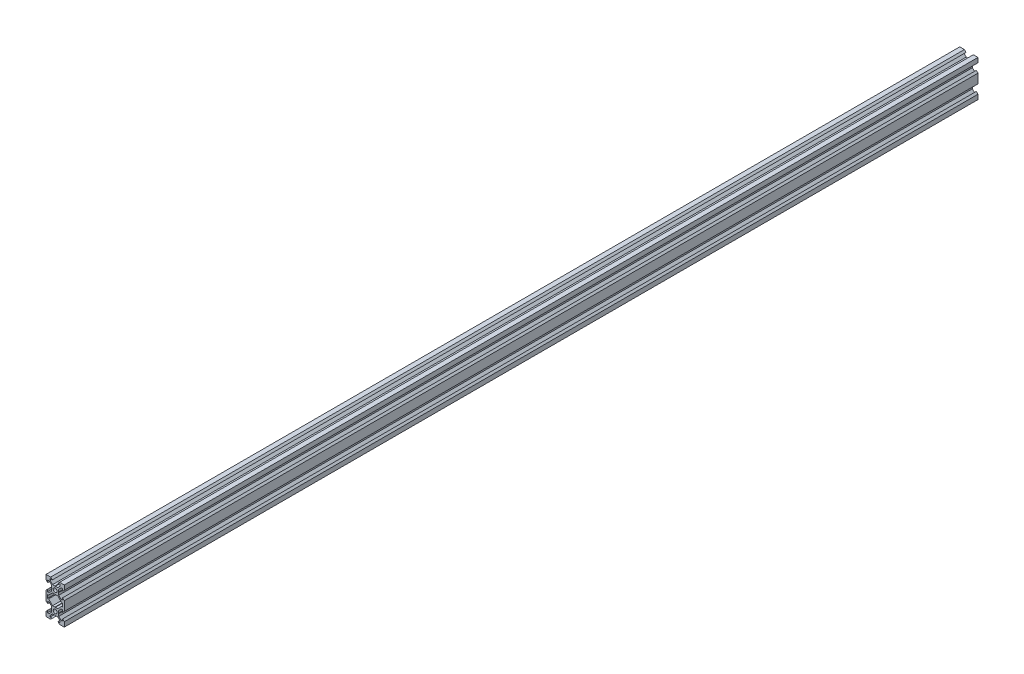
ISO-10303-21;
HEADER;
FILE_DESCRIPTION(('STEP AP214'),'2;1');
FILE_NAME('part.step','',(''),(''),'','','');
FILE_SCHEMA(('AUTOMOTIVE_DESIGN { 1 0 10303 214 1 1 1 1 }'));
ENDSEC;
DATA;
#1=APPLICATION_CONTEXT('core data for automotive mechanical design processes');
#2=APPLICATION_PROTOCOL_DEFINITION('international standard','automotive_design',2000,#1);
#3=PRODUCT_CONTEXT('',#1,'mechanical');
#4=PRODUCT('Part','Part','',(#3));
#5=PRODUCT_RELATED_PRODUCT_CATEGORY('part','',(#4));
#6=PRODUCT_DEFINITION_FORMATION('','',#4);
#7=PRODUCT_DEFINITION_CONTEXT('part definition',#1,'design');
#8=PRODUCT_DEFINITION('design','',#6,#7);
#9=PRODUCT_DEFINITION_SHAPE('','',#8);
#10=(LENGTH_UNIT() NAMED_UNIT(*) SI_UNIT(.MILLI.,.METRE.));
#11=(NAMED_UNIT(*) PLANE_ANGLE_UNIT() SI_UNIT($,.RADIAN.));
#12=(NAMED_UNIT(*) SI_UNIT($,.STERADIAN.) SOLID_ANGLE_UNIT());
#13=UNCERTAINTY_MEASURE_WITH_UNIT(LENGTH_MEASURE(1.E-05),#10,'distance_accuracy_value','');
#14=(GEOMETRIC_REPRESENTATION_CONTEXT(3) GLOBAL_UNCERTAINTY_ASSIGNED_CONTEXT((#13)) GLOBAL_UNIT_ASSIGNED_CONTEXT((#10,
#11,#12)) REPRESENTATION_CONTEXT('',''));
#15=CARTESIAN_POINT('',(0.,0.,0.));
#16=DIRECTION('',(0.,0.,1.));
#17=DIRECTION('',(1.,0.,0.));
#18=AXIS2_PLACEMENT_3D('',#15,#16,#17);
#19=CARTESIAN_POINT('',(0.,-16.1,1000.));
#20=DIRECTION('',(0.,1.,0.));
#21=DIRECTION('',(0.,0.,1.));
#22=AXIS2_PLACEMENT_3D('',#19,#20,#21);
#23=PLANE('',#22);
#24=DIRECTION('',(1.,0.,0.));
#25=VECTOR('',#24,1.);
#26=CARTESIAN_POINT('',(0.,-16.1,0.));
#27=LINE('',#26,#25);
#28=CARTESIAN_POINT('',(-2.83933982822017,-16.1,0.));
#29=VERTEX_POINT('',#28);
#30=CARTESIAN_POINT('',(-0.249999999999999,-16.1,0.));
#31=VERTEX_POINT('',#30);
#32=EDGE_CURVE('E905',#29,#31,#27,.T.);
#33=ORIENTED_EDGE('',*,*,#32,.F.);
#34=DIRECTION('',(0.,0.,-1.));
#35=VECTOR('',#34,1.);
#36=CARTESIAN_POINT('',(-2.83933982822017,-16.1,1000.));
#37=LINE('',#36,#35);
#38=CARTESIAN_POINT('',(-2.83933982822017,-16.1,1000.));
#39=VERTEX_POINT('',#38);
#40=EDGE_CURVE('E11',#39,#29,#37,.T.);
#41=ORIENTED_EDGE('',*,*,#40,.F.);
#42=DIRECTION('',(1.,0.,0.));
#43=VECTOR('',#42,1.);
#44=CARTESIAN_POINT('',(0.,-16.1,1000.));
#45=LINE('',#44,#43);
#46=CARTESIAN_POINT('',(-0.249999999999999,-16.1,1000.));
#47=VERTEX_POINT('',#46);
#48=EDGE_CURVE('E685',#39,#47,#45,.T.);
#49=ORIENTED_EDGE('',*,*,#48,.T.);
#50=DIRECTION('',(0.,0.,-1.));
#51=VECTOR('',#50,1.);
#52=CARTESIAN_POINT('',(-0.249999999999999,-16.1,1000.));
#53=LINE('',#52,#51);
#54=EDGE_CURVE('E56',#47,#31,#53,.T.);
#55=ORIENTED_EDGE('',*,*,#54,.T.);
#56=EDGE_LOOP('',(#33,#41,#49,#55));
#57=FACE_BOUND('',#56,.T.);
#58=ADVANCED_FACE('F37',(#57),#23,.T.);
#59=CARTESIAN_POINT('',(-9.46966991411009,-9.46966991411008,1000.));
#60=DIRECTION('',(0.707106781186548,0.707106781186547,0.));
#61=DIRECTION('',(-0.707106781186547,0.707106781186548,0.));
#62=AXIS2_PLACEMENT_3D('',#59,#60,#61);
#63=PLANE('',#62);
#64=DIRECTION('',(0.707106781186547,-0.707106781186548,0.));
#65=VECTOR('',#64,1.);
#66=CARTESIAN_POINT('',(-9.46966991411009,-9.46966991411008,0.));
#67=LINE('',#66,#65);
#68=CARTESIAN_POINT('',(-7.13933982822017,-11.8,0.));
#69=VERTEX_POINT('',#68);
#70=EDGE_CURVE('E907',#69,#29,#67,.T.);
#71=ORIENTED_EDGE('',*,*,#70,.F.);
#72=DIRECTION('',(0.,0.,-1.));
#73=VECTOR('',#72,1.);
#74=CARTESIAN_POINT('',(-7.13933982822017,-11.8,1000.));
#75=LINE('',#74,#73);
#76=CARTESIAN_POINT('',(-7.13933982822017,-11.8,1000.));
#77=VERTEX_POINT('',#76);
#78=EDGE_CURVE('E47',#77,#69,#75,.T.);
#79=ORIENTED_EDGE('',*,*,#78,.F.);
#80=DIRECTION('',(0.707106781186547,-0.707106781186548,0.));
#81=VECTOR('',#80,1.);
#82=CARTESIAN_POINT('',(-9.46966991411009,-9.46966991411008,1000.));
#83=LINE('',#82,#81);
#84=EDGE_CURVE('E1395',#77,#39,#83,.T.);
#85=ORIENTED_EDGE('',*,*,#84,.T.);
#86=ORIENTED_EDGE('',*,*,#40,.T.);
#87=EDGE_LOOP('',(#71,#79,#85,#86));
#88=FACE_BOUND('',#87,.T.);
#89=ADVANCED_FACE('F1451',(#88),#63,.T.);
#90=CARTESIAN_POINT('',(0.,-11.8,1000.));
#91=DIRECTION('',(0.,-1.,0.));
#92=DIRECTION('',(1.,0.,0.));
#93=AXIS2_PLACEMENT_3D('',#90,#91,#92);
#94=PLANE('',#93);
#95=DIRECTION('',(-1.,0.,0.));
#96=VECTOR('',#95,1.);
#97=CARTESIAN_POINT('',(0.,-11.8,0.));
#98=LINE('',#97,#96);
#99=CARTESIAN_POINT('',(-8.2,-11.8,0.));
#100=VERTEX_POINT('',#99);
#101=EDGE_CURVE('E910',#69,#100,#98,.T.);
#102=ORIENTED_EDGE('',*,*,#101,.T.);
#103=DIRECTION('',(0.,0.,-1.));
#104=VECTOR('',#103,1.);
#105=CARTESIAN_POINT('',(-8.2,-11.8,1000.));
#106=LINE('',#105,#104);
#107=CARTESIAN_POINT('',(-8.2,-11.8,1000.));
#108=VERTEX_POINT('',#107);
#109=EDGE_CURVE('E988',#108,#100,#106,.T.);
#110=ORIENTED_EDGE('',*,*,#109,.F.);
#111=DIRECTION('',(-1.,0.,0.));
#112=VECTOR('',#111,1.);
#113=CARTESIAN_POINT('',(0.,-11.8,1000.));
#114=LINE('',#113,#112);
#115=EDGE_CURVE('E1398',#77,#108,#114,.T.);
#116=ORIENTED_EDGE('',*,*,#115,.F.);
#117=ORIENTED_EDGE('',*,*,#78,.T.);
#118=EDGE_LOOP('',(#102,#110,#116,#117));
#119=FACE_BOUND('',#118,.T.);
#120=ADVANCED_FACE('F1455',(#119),#94,.F.);
#121=CARTESIAN_POINT('',(-8.2,0.,1000.));
#122=DIRECTION('',(1.,0.,0.));
#123=DIRECTION('',(0.,0.,-1.));
#124=AXIS2_PLACEMENT_3D('',#121,#122,#123);
#125=PLANE('',#124);
#126=DIRECTION('',(0.,-1.,0.));
#127=VECTOR('',#126,1.);
#128=CARTESIAN_POINT('',(-8.2,0.,0.));
#129=LINE('',#128,#127);
#130=CARTESIAN_POINT('',(-8.2,-8.2,0.));
#131=VERTEX_POINT('',#130);
#132=EDGE_CURVE('E913',#131,#100,#129,.T.);
#133=ORIENTED_EDGE('',*,*,#132,.F.);
#134=DIRECTION('',(0.,0.,-1.));
#135=VECTOR('',#134,1.);
#136=CARTESIAN_POINT('',(-8.2,-8.2,1000.));
#137=LINE('',#136,#135);
#138=CARTESIAN_POINT('',(-8.2,-8.2,1000.));
#139=VERTEX_POINT('',#138);
#140=EDGE_CURVE('E986',#139,#131,#137,.T.);
#141=ORIENTED_EDGE('',*,*,#140,.F.);
#142=DIRECTION('',(0.,-1.,0.));
#143=VECTOR('',#142,1.);
#144=CARTESIAN_POINT('',(-8.2,0.,1000.));
#145=LINE('',#144,#143);
#146=EDGE_CURVE('E1400',#139,#108,#145,.T.);
#147=ORIENTED_EDGE('',*,*,#146,.T.);
#148=ORIENTED_EDGE('',*,*,#109,.T.);
#149=EDGE_LOOP('',(#133,#141,#147,#148));
#150=FACE_BOUND('',#149,.T.);
#151=ADVANCED_FACE('F2376',(#150),#125,.T.);
#152=CARTESIAN_POINT('',(0.,-8.19999999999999,1000.));
#153=DIRECTION('',(0.,-1.,0.));
#154=DIRECTION('',(1.,0.,0.));
#155=AXIS2_PLACEMENT_3D('',#152,#153,#154);
#156=PLANE('',#155);
#157=DIRECTION('',(-1.,0.,0.));
#158=VECTOR('',#157,1.);
#159=CARTESIAN_POINT('',(0.,-8.19999999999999,0.));
#160=LINE('',#159,#158);
#161=CARTESIAN_POINT('',(-7.13933982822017,-8.2,0.));
#162=VERTEX_POINT('',#161);
#163=EDGE_CURVE('E916',#162,#131,#160,.T.);
#164=ORIENTED_EDGE('',*,*,#163,.F.);
#165=DIRECTION('',(0.,0.,-1.));
#166=VECTOR('',#165,1.);
#167=CARTESIAN_POINT('',(-7.13933982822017,-8.2,1000.));
#168=LINE('',#167,#166);
#169=CARTESIAN_POINT('',(-7.13933982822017,-8.2,1000.));
#170=VERTEX_POINT('',#169);
#171=EDGE_CURVE('E984',#170,#162,#168,.T.);
#172=ORIENTED_EDGE('',*,*,#171,.F.);
#173=DIRECTION('',(-1.,0.,0.));
#174=VECTOR('',#173,1.);
#175=CARTESIAN_POINT('',(0.,-8.19999999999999,1000.));
#176=LINE('',#175,#174);
#177=EDGE_CURVE('E1403',#170,#139,#176,.T.);
#178=ORIENTED_EDGE('',*,*,#177,.T.);
#179=ORIENTED_EDGE('',*,*,#140,.T.);
#180=EDGE_LOOP('',(#164,#172,#178,#179));
#181=FACE_BOUND('',#180,.T.);
#182=ADVANCED_FACE('F2365',(#181),#156,.T.);
#183=CARTESIAN_POINT('',(0.530330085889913,-0.530330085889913,1000.));
#184=DIRECTION('',(0.707106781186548,-0.707106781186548,0.));
#185=DIRECTION('',(0.707106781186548,0.707106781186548,0.));
#186=AXIS2_PLACEMENT_3D('',#183,#184,#185);
#187=PLANE('',#186);
#188=DIRECTION('',(-0.707106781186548,-0.707106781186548,0.));
#189=VECTOR('',#188,1.);
#190=CARTESIAN_POINT('',(0.530330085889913,-0.530330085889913,0.));
#191=LINE('',#190,#189);
#192=CARTESIAN_POINT('',(-2.83933982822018,-3.9,0.));
#193=VERTEX_POINT('',#192);
#194=EDGE_CURVE('E919',#193,#162,#191,.T.);
#195=ORIENTED_EDGE('',*,*,#194,.F.);
#196=DIRECTION('',(0.,0.,-1.));
#197=VECTOR('',#196,1.);
#198=CARTESIAN_POINT('',(-2.83933982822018,-3.9,1000.));
#199=LINE('',#198,#197);
#200=CARTESIAN_POINT('',(-2.83933982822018,-3.9,1000.));
#201=VERTEX_POINT('',#200);
#202=EDGE_CURVE('E982',#201,#193,#199,.T.);
#203=ORIENTED_EDGE('',*,*,#202,.F.);
#204=DIRECTION('',(-0.707106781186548,-0.707106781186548,0.));
#205=VECTOR('',#204,1.);
#206=CARTESIAN_POINT('',(0.530330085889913,-0.530330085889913,1000.));
#207=LINE('',#206,#205);
#208=EDGE_CURVE('E1406',#201,#170,#207,.T.);
#209=ORIENTED_EDGE('',*,*,#208,.T.);
#210=ORIENTED_EDGE('',*,*,#171,.T.);
#211=EDGE_LOOP('',(#195,#203,#209,#210));
#212=FACE_BOUND('',#211,.T.);
#213=ADVANCED_FACE('F2356',(#212),#187,.T.);
#214=CARTESIAN_POINT('',(0.,-3.9,1000.));
#215=DIRECTION('',(0.,1.,0.));
#216=DIRECTION('',(0.,0.,1.));
#217=AXIS2_PLACEMENT_3D('',#214,#215,#216);
#218=PLANE('',#217);
#219=DIRECTION('',(1.,0.,0.));
#220=VECTOR('',#219,1.);
#221=CARTESIAN_POINT('',(0.,-3.9,0.));
#222=LINE('',#221,#220);
#223=CARTESIAN_POINT('',(-0.250000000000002,-3.9,0.));
#224=VERTEX_POINT('',#223);
#225=EDGE_CURVE('E922',#193,#224,#222,.T.);
#226=ORIENTED_EDGE('',*,*,#225,.T.);
#227=DIRECTION('',(0.,0.,-1.));
#228=VECTOR('',#227,1.);
#229=CARTESIAN_POINT('',(-0.250000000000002,-3.9,1000.));
#230=LINE('',#229,#228);
#231=CARTESIAN_POINT('',(-0.250000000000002,-3.9,1000.));
#232=VERTEX_POINT('',#231);
#233=EDGE_CURVE('E979',#232,#224,#230,.T.);
#234=ORIENTED_EDGE('',*,*,#233,.F.);
#235=DIRECTION('',(1.,0.,0.));
#236=VECTOR('',#235,1.);
#237=CARTESIAN_POINT('',(0.,-3.9,1000.));
#238=LINE('',#237,#236);
#239=EDGE_CURVE('E1409',#201,#232,#238,.T.);
#240=ORIENTED_EDGE('',*,*,#239,.F.);
#241=ORIENTED_EDGE('',*,*,#202,.T.);
#242=EDGE_LOOP('',(#226,#234,#240,#241));
#243=FACE_BOUND('',#242,.T.);
#244=ADVANCED_FACE('F2329',(#243),#218,.F.);
#245=CARTESIAN_POINT('',(1.825,-1.82500000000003,1000.));
#246=DIRECTION('',(-0.707106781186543,0.707106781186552,0.));
#247=DIRECTION('',(-0.707106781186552,-0.707106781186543,0.));
#248=AXIS2_PLACEMENT_3D('',#245,#246,#247);
#249=PLANE('',#248);
#250=DIRECTION('',(0.707106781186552,0.707106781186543,0.));
#251=VECTOR('',#250,1.);
#252=CARTESIAN_POINT('',(1.825,-1.82500000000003,0.));
#253=LINE('',#252,#251);
#254=CARTESIAN_POINT('',(0.,-3.65,0.));
#255=VERTEX_POINT('',#254);
#256=EDGE_CURVE('E925',#224,#255,#253,.T.);
#257=ORIENTED_EDGE('',*,*,#256,.T.);
#258=DIRECTION('',(0.,0.,-1.));
#259=VECTOR('',#258,1.);
#260=CARTESIAN_POINT('',(0.,-3.65,1000.));
#261=LINE('',#260,#259);
#262=CARTESIAN_POINT('',(0.,-3.65,1000.));
#263=VERTEX_POINT('',#262);
#264=EDGE_CURVE('E976',#263,#255,#261,.T.);
#265=ORIENTED_EDGE('',*,*,#264,.F.);
#266=DIRECTION('',(0.707106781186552,0.707106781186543,0.));
#267=VECTOR('',#266,1.);
#268=CARTESIAN_POINT('',(1.825,-1.82500000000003,1000.));
#269=LINE('',#268,#267);
#270=EDGE_CURVE('E1412',#232,#263,#269,.T.);
#271=ORIENTED_EDGE('',*,*,#270,.F.);
#272=ORIENTED_EDGE('',*,*,#233,.T.);
#273=EDGE_LOOP('',(#257,#265,#271,#272));
#274=FACE_BOUND('',#273,.T.);
#275=ADVANCED_FACE('F2337',(#274),#249,.F.);
#276=CARTESIAN_POINT('',(-1.825,-1.82500000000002,1000.));
#277=DIRECTION('',(0.707106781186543,0.707106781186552,0.));
#278=DIRECTION('',(-0.707106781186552,0.707106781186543,0.));
#279=AXIS2_PLACEMENT_3D('',#276,#277,#278);
#280=PLANE('',#279);
#281=DIRECTION('',(0.707106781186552,-0.707106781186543,0.));
#282=VECTOR('',#281,1.);
#283=CARTESIAN_POINT('',(-1.825,-1.82500000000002,0.));
#284=LINE('',#283,#282);
#285=CARTESIAN_POINT('',(0.250000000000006,-3.9,0.));
#286=VERTEX_POINT('',#285);
#287=EDGE_CURVE('E929',#255,#286,#284,.T.);
#288=ORIENTED_EDGE('',*,*,#287,.T.);
#289=DIRECTION('',(0.,0.,-1.));
#290=VECTOR('',#289,1.);
#291=CARTESIAN_POINT('',(0.250000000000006,-3.9,1000.));
#292=LINE('',#291,#290);
#293=CARTESIAN_POINT('',(0.250000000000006,-3.9,1000.));
#294=VERTEX_POINT('',#293);
#295=EDGE_CURVE('E973',#294,#286,#292,.T.);
#296=ORIENTED_EDGE('',*,*,#295,.F.);
#297=DIRECTION('',(0.707106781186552,-0.707106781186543,0.));
#298=VECTOR('',#297,1.);
#299=CARTESIAN_POINT('',(-1.825,-1.82500000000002,1000.));
#300=LINE('',#299,#298);
#301=EDGE_CURVE('E1416',#263,#294,#300,.T.);
#302=ORIENTED_EDGE('',*,*,#301,.F.);
#303=ORIENTED_EDGE('',*,*,#264,.T.);
#304=EDGE_LOOP('',(#288,#296,#302,#303));
#305=FACE_BOUND('',#304,.T.);
#306=ADVANCED_FACE('F2326',(#305),#280,.F.);
#307=CARTESIAN_POINT('',(2.83933982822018,-3.9,0.));
#308=VERTEX_POINT('',#307);
#309=EDGE_CURVE('E926',#286,#308,#222,.T.);
#310=ORIENTED_EDGE('',*,*,#309,.T.);
#311=DIRECTION('',(0.,0.,-1.));
#312=VECTOR('',#311,1.);
#313=CARTESIAN_POINT('',(2.83933982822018,-3.9,1000.));
#314=LINE('',#313,#312);
#315=CARTESIAN_POINT('',(2.83933982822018,-3.9,1000.));
#316=VERTEX_POINT('',#315);
#317=EDGE_CURVE('E971',#316,#308,#314,.T.);
#318=ORIENTED_EDGE('',*,*,#317,.F.);
#319=EDGE_CURVE('E1413',#294,#316,#238,.T.);
#320=ORIENTED_EDGE('',*,*,#319,.F.);
#321=ORIENTED_EDGE('',*,*,#295,.T.);
#322=EDGE_LOOP('',(#310,#318,#320,#321));
#323=FACE_BOUND('',#322,.T.);
#324=ADVANCED_FACE('F2315',(#323),#218,.F.);
#325=CARTESIAN_POINT('',(-0.530330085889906,-0.530330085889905,1000.));
#326=DIRECTION('',(-0.707106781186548,-0.707106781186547,0.));
#327=DIRECTION('',(0.707106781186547,-0.707106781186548,0.));
#328=AXIS2_PLACEMENT_3D('',#325,#326,#327);
#329=PLANE('',#328);
#330=DIRECTION('',(-0.707106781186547,0.707106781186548,0.));
#331=VECTOR('',#330,1.);
#332=CARTESIAN_POINT('',(-0.530330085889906,-0.530330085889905,0.));
#333=LINE('',#332,#331);
#334=CARTESIAN_POINT('',(7.13933982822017,-8.2,0.));
#335=VERTEX_POINT('',#334);
#336=EDGE_CURVE('E932',#335,#308,#333,.T.);
#337=ORIENTED_EDGE('',*,*,#336,.F.);
#338=DIRECTION('',(0.,0.,-1.));
#339=VECTOR('',#338,1.);
#340=CARTESIAN_POINT('',(7.13933982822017,-8.2,1000.));
#341=LINE('',#340,#339);
#342=CARTESIAN_POINT('',(7.13933982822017,-8.2,1000.));
#343=VERTEX_POINT('',#342);
#344=EDGE_CURVE('E969',#343,#335,#341,.T.);
#345=ORIENTED_EDGE('',*,*,#344,.F.);
#346=DIRECTION('',(-0.707106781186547,0.707106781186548,0.));
#347=VECTOR('',#346,1.);
#348=CARTESIAN_POINT('',(-0.530330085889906,-0.530330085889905,1000.));
#349=LINE('',#348,#347);
#350=EDGE_CURVE('E1419',#343,#316,#349,.T.);
#351=ORIENTED_EDGE('',*,*,#350,.T.);
#352=ORIENTED_EDGE('',*,*,#317,.T.);
#353=EDGE_LOOP('',(#337,#345,#351,#352));
#354=FACE_BOUND('',#353,.T.);
#355=ADVANCED_FACE('F2305',(#354),#329,.T.);
#356=CARTESIAN_POINT('',(0.,-8.19999999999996,1000.));
#357=DIRECTION('',(0.,1.,0.));
#358=DIRECTION('',(-1.,0.,0.));
#359=AXIS2_PLACEMENT_3D('',#356,#357,#358);
#360=PLANE('',#359);
#361=DIRECTION('',(1.,0.,0.));
#362=VECTOR('',#361,1.);
#363=CARTESIAN_POINT('',(0.,-8.19999999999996,0.));
#364=LINE('',#363,#362);
#365=CARTESIAN_POINT('',(8.20000000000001,-8.2,0.));
#366=VERTEX_POINT('',#365);
#367=EDGE_CURVE('E935',#335,#366,#364,.T.);
#368=ORIENTED_EDGE('',*,*,#367,.T.);
#369=DIRECTION('',(0.,0.,-1.));
#370=VECTOR('',#369,1.);
#371=CARTESIAN_POINT('',(8.20000000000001,-8.2,1000.));
#372=LINE('',#371,#370);
#373=CARTESIAN_POINT('',(8.20000000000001,-8.2,1000.));
#374=VERTEX_POINT('',#373);
#375=EDGE_CURVE('E966',#374,#366,#372,.T.);
#376=ORIENTED_EDGE('',*,*,#375,.F.);
#377=DIRECTION('',(1.,0.,0.));
#378=VECTOR('',#377,1.);
#379=CARTESIAN_POINT('',(0.,-8.19999999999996,1000.));
#380=LINE('',#379,#378);
#381=EDGE_CURVE('E1422',#343,#374,#380,.T.);
#382=ORIENTED_EDGE('',*,*,#381,.F.);
#383=ORIENTED_EDGE('',*,*,#344,.T.);
#384=EDGE_LOOP('',(#368,#376,#382,#383));
#385=FACE_BOUND('',#384,.T.);
#386=ADVANCED_FACE('F2295',(#385),#360,.F.);
#387=CARTESIAN_POINT('',(8.20000000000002,0.,1000.));
#388=DIRECTION('',(1.,0.,0.));
#389=DIRECTION('',(0.,1.,0.));
#390=AXIS2_PLACEMENT_3D('',#387,#388,#389);
#391=PLANE('',#390);
#392=DIRECTION('',(0.,-1.,0.));
#393=VECTOR('',#392,1.);
#394=CARTESIAN_POINT('',(8.20000000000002,0.,0.));
#395=LINE('',#394,#393);
#396=CARTESIAN_POINT('',(8.2,-11.8,0.));
#397=VERTEX_POINT('',#396);
#398=EDGE_CURVE('E938',#366,#397,#395,.T.);
#399=ORIENTED_EDGE('',*,*,#398,.T.);
#400=DIRECTION('',(0.,0.,-1.));
#401=VECTOR('',#400,1.);
#402=CARTESIAN_POINT('',(8.2,-11.8,1000.));
#403=LINE('',#402,#401);
#404=CARTESIAN_POINT('',(8.2,-11.8,1000.));
#405=VERTEX_POINT('',#404);
#406=EDGE_CURVE('E964',#405,#397,#403,.T.);
#407=ORIENTED_EDGE('',*,*,#406,.F.);
#408=DIRECTION('',(0.,-1.,0.));
#409=VECTOR('',#408,1.);
#410=CARTESIAN_POINT('',(8.20000000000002,0.,1000.));
#411=LINE('',#410,#409);
#412=EDGE_CURVE('E1425',#374,#405,#411,.T.);
#413=ORIENTED_EDGE('',*,*,#412,.F.);
#414=ORIENTED_EDGE('',*,*,#375,.T.);
#415=EDGE_LOOP('',(#399,#407,#413,#414));
#416=FACE_BOUND('',#415,.T.);
#417=ADVANCED_FACE('F1436',(#416),#391,.F.);
#418=CARTESIAN_POINT('',(0.,-11.8,1000.));
#419=DIRECTION('',(0.,1.,0.));
#420=DIRECTION('',(-1.,0.,0.));
#421=AXIS2_PLACEMENT_3D('',#418,#419,#420);
#422=PLANE('',#421);
#423=DIRECTION('',(1.,0.,0.));
#424=VECTOR('',#423,1.);
#425=CARTESIAN_POINT('',(0.,-11.8,0.));
#426=LINE('',#425,#424);
#427=CARTESIAN_POINT('',(7.13933982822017,-11.8,0.));
#428=VERTEX_POINT('',#427);
#429=EDGE_CURVE('E941',#428,#397,#426,.T.);
#430=ORIENTED_EDGE('',*,*,#429,.F.);
#431=DIRECTION('',(0.,0.,-1.));
#432=VECTOR('',#431,1.);
#433=CARTESIAN_POINT('',(7.13933982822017,-11.8,1000.));
#434=LINE('',#433,#432);
#435=CARTESIAN_POINT('',(7.13933982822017,-11.8,1000.));
#436=VERTEX_POINT('',#435);
#437=EDGE_CURVE('E962',#436,#428,#434,.T.);
#438=ORIENTED_EDGE('',*,*,#437,.F.);
#439=DIRECTION('',(1.,0.,0.));
#440=VECTOR('',#439,1.);
#441=CARTESIAN_POINT('',(0.,-11.8,1000.));
#442=LINE('',#441,#440);
#443=EDGE_CURVE('E1426',#436,#405,#442,.T.);
#444=ORIENTED_EDGE('',*,*,#443,.T.);
#445=ORIENTED_EDGE('',*,*,#406,.T.);
#446=EDGE_LOOP('',(#430,#438,#444,#445));
#447=FACE_BOUND('',#446,.T.);
#448=ADVANCED_FACE('F1430',(#447),#422,.T.);
#449=CARTESIAN_POINT('',(9.46966991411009,-9.46966991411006,1000.));
#450=DIRECTION('',(0.707106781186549,-0.707106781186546,0.));
#451=DIRECTION('',(0.707106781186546,0.707106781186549,0.));
#452=AXIS2_PLACEMENT_3D('',#449,#450,#451);
#453=PLANE('',#452);
#454=DIRECTION('',(-0.707106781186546,-0.707106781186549,0.));
#455=VECTOR('',#454,1.);
#456=CARTESIAN_POINT('',(9.46966991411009,-9.46966991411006,0.));
#457=LINE('',#456,#455);
#458=CARTESIAN_POINT('',(2.83933982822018,-16.1,0.));
#459=VERTEX_POINT('',#458);
#460=EDGE_CURVE('E944',#428,#459,#457,.T.);
#461=ORIENTED_EDGE('',*,*,#460,.T.);
#462=DIRECTION('',(0.,0.,-1.));
#463=VECTOR('',#462,1.);
#464=CARTESIAN_POINT('',(2.83933982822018,-16.1,1000.));
#465=LINE('',#464,#463);
#466=CARTESIAN_POINT('',(2.83933982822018,-16.1,1000.));
#467=VERTEX_POINT('',#466);
#468=EDGE_CURVE('E671',#467,#459,#465,.T.);
#469=ORIENTED_EDGE('',*,*,#468,.F.);
#470=DIRECTION('',(-0.707106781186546,-0.707106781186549,0.));
#471=VECTOR('',#470,1.);
#472=CARTESIAN_POINT('',(9.46966991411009,-9.46966991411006,1000.));
#473=LINE('',#472,#471);
#474=EDGE_CURVE('E682',#436,#467,#473,.T.);
#475=ORIENTED_EDGE('',*,*,#474,.F.);
#476=ORIENTED_EDGE('',*,*,#437,.T.);
#477=EDGE_LOOP('',(#461,#469,#475,#476));
#478=FACE_BOUND('',#477,.T.);
#479=ADVANCED_FACE('F1441',(#478),#453,.F.);
#480=CARTESIAN_POINT('',(0.250000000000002,-16.1,0.));
#481=VERTEX_POINT('',#480);
#482=EDGE_CURVE('E667',#481,#459,#27,.T.);
#483=ORIENTED_EDGE('',*,*,#482,.F.);
#484=DIRECTION('',(0.,0.,-1.));
#485=VECTOR('',#484,1.);
#486=CARTESIAN_POINT('',(0.250000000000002,-16.1,1000.));
#487=LINE('',#486,#485);
#488=CARTESIAN_POINT('',(0.250000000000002,-16.1,1000.));
#489=VERTEX_POINT('',#488);
#490=EDGE_CURVE('E662',#489,#481,#487,.T.);
#491=ORIENTED_EDGE('',*,*,#490,.F.);
#492=EDGE_CURVE('E665',#489,#467,#45,.T.);
#493=ORIENTED_EDGE('',*,*,#492,.T.);
#494=ORIENTED_EDGE('',*,*,#468,.T.);
#495=EDGE_LOOP('',(#483,#491,#493,#494));
#496=FACE_BOUND('',#495,.T.);
#497=ADVANCED_FACE('F664',(#496),#23,.T.);
#498=CARTESIAN_POINT('',(8.175,-8.17500000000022,1000.));
#499=DIRECTION('',(-0.707106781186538,0.707106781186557,0.));
#500=DIRECTION('',(-0.707106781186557,-0.707106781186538,0.));
#501=AXIS2_PLACEMENT_3D('',#498,#499,#500);
#502=PLANE('',#501);
#503=DIRECTION('',(0.707106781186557,0.707106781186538,0.));
#504=VECTOR('',#503,1.);
#505=CARTESIAN_POINT('',(8.175,-8.17500000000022,0.));
#506=LINE('',#505,#504);
#507=CARTESIAN_POINT('',(0.,-16.35,0.));
#508=VERTEX_POINT('',#507);
#509=EDGE_CURVE('E947',#508,#481,#506,.T.);
#510=ORIENTED_EDGE('',*,*,#509,.F.);
#511=DIRECTION('',(0.,0.,-1.));
#512=VECTOR('',#511,1.);
#513=CARTESIAN_POINT('',(0.,-16.35,1000.));
#514=LINE('',#513,#512);
#515=CARTESIAN_POINT('',(0.,-16.35,1000.));
#516=VERTEX_POINT('',#515);
#517=EDGE_CURVE('E357',#516,#508,#514,.T.);
#518=ORIENTED_EDGE('',*,*,#517,.F.);
#519=DIRECTION('',(0.707106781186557,0.707106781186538,0.));
#520=VECTOR('',#519,1.);
#521=CARTESIAN_POINT('',(8.175,-8.17500000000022,1000.));
#522=LINE('',#521,#520);
#523=EDGE_CURVE('E679',#516,#489,#522,.T.);
#524=ORIENTED_EDGE('',*,*,#523,.T.);
#525=ORIENTED_EDGE('',*,*,#490,.T.);
#526=EDGE_LOOP('',(#510,#518,#524,#525));
#527=FACE_BOUND('',#526,.T.);
#528=ADVANCED_FACE('F686',(#527),#502,.T.);
#529=CARTESIAN_POINT('',(-10.5303300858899,-10.5303300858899,1000.));
#530=DIRECTION('',(0.707106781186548,0.707106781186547,0.));
#531=DIRECTION('',(-0.707106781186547,0.707106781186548,0.));
#532=AXIS2_PLACEMENT_3D('',#529,#530,#531);
#533=PLANE('',#532);
#534=DIRECTION('',(0.707106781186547,-0.707106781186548,0.));
#535=VECTOR('',#534,1.);
#536=CARTESIAN_POINT('',(-10.5303300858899,-10.5303300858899,0.));
#537=LINE('',#536,#535);
#538=CARTESIAN_POINT('',(-6.56066017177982,-14.5,0.));
#539=VERTEX_POINT('',#538);
#540=CARTESIAN_POINT('',(-3.9,-17.1606601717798,0.));
#541=VERTEX_POINT('',#540);
#542=EDGE_CURVE('E700',#539,#541,#537,.T.);
#543=ORIENTED_EDGE('',*,*,#542,.T.);
#544=DIRECTION('',(0.,0.,-1.));
#545=VECTOR('',#544,1.);
#546=CARTESIAN_POINT('',(-3.9,-17.1606601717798,1000.));
#547=LINE('',#546,#545);
#548=CARTESIAN_POINT('',(-3.9,-17.1606601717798,1000.));
#549=VERTEX_POINT('',#548);
#550=EDGE_CURVE('E41',#549,#541,#547,.T.);
#551=ORIENTED_EDGE('',*,*,#550,.F.);
#552=DIRECTION('',(0.707106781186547,-0.707106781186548,0.));
#553=VECTOR('',#552,1.);
#554=CARTESIAN_POINT('',(-10.5303300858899,-10.5303300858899,1000.));
#555=LINE('',#554,#553);
#556=CARTESIAN_POINT('',(-6.56066017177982,-14.5,1000.));
#557=VERTEX_POINT('',#556);
#558=EDGE_CURVE('E958',#557,#549,#555,.T.);
#559=ORIENTED_EDGE('',*,*,#558,.F.);
#560=DIRECTION('',(0.,0.,-1.));
#561=VECTOR('',#560,1.);
#562=CARTESIAN_POINT('',(-6.56066017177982,-14.5,1000.));
#563=LINE('',#562,#561);
#564=EDGE_CURVE('E699',#557,#539,#563,.T.);
#565=ORIENTED_EDGE('',*,*,#564,.T.);
#566=EDGE_LOOP('',(#543,#551,#559,#565));
#567=FACE_BOUND('',#566,.T.);
#568=ADVANCED_FACE('F39',(#567),#533,.F.);
#569=CARTESIAN_POINT('',(-3.9,0.,1000.));
#570=DIRECTION('',(1.,0.,0.));
#571=DIRECTION('',(0.,0.,-1.));
#572=AXIS2_PLACEMENT_3D('',#569,#570,#571);
#573=PLANE('',#572);
#574=DIRECTION('',(0.,-1.,0.));
#575=VECTOR('',#574,1.);
#576=CARTESIAN_POINT('',(-3.9,0.,0.));
#577=LINE('',#576,#575);
#578=CARTESIAN_POINT('',(-3.9,-19.75,0.));
#579=VERTEX_POINT('',#578);
#580=EDGE_CURVE('E703',#541,#579,#577,.T.);
#581=ORIENTED_EDGE('',*,*,#580,.T.);
#582=DIRECTION('',(0.,0.,-1.));
#583=VECTOR('',#582,1.);
#584=CARTESIAN_POINT('',(-3.9,-19.75,1000.));
#585=LINE('',#584,#583);
#586=CARTESIAN_POINT('',(-3.9,-19.75,1000.));
#587=VERTEX_POINT('',#586);
#588=EDGE_CURVE('E1178',#587,#579,#585,.T.);
#589=ORIENTED_EDGE('',*,*,#588,.F.);
#590=DIRECTION('',(0.,-1.,0.));
#591=VECTOR('',#590,1.);
#592=CARTESIAN_POINT('',(-3.9,0.,1000.));
#593=LINE('',#592,#591);
#594=EDGE_CURVE('E370',#549,#587,#593,.T.);
#595=ORIENTED_EDGE('',*,*,#594,.F.);
#596=ORIENTED_EDGE('',*,*,#550,.T.);
#597=EDGE_LOOP('',(#581,#589,#595,#596));
#598=FACE_BOUND('',#597,.T.);
#599=ADVANCED_FACE('F1183',(#598),#573,.F.);
#600=CARTESIAN_POINT('',(-11.825,-11.8250000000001,1000.));
#601=DIRECTION('',(-0.707106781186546,-0.707106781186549,0.));
#602=DIRECTION('',(0.707106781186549,-0.707106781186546,0.));
#603=AXIS2_PLACEMENT_3D('',#600,#601,#602);
#604=PLANE('',#603);
#605=DIRECTION('',(-0.707106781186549,0.707106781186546,0.));
#606=VECTOR('',#605,1.);
#607=CARTESIAN_POINT('',(-11.825,-11.8250000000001,0.));
#608=LINE('',#607,#606);
#609=CARTESIAN_POINT('',(-3.65,-20.,0.));
#610=VERTEX_POINT('',#609);
#611=EDGE_CURVE('E706',#610,#579,#608,.T.);
#612=ORIENTED_EDGE('',*,*,#611,.F.);
#613=DIRECTION('',(0.,0.,-1.));
#614=VECTOR('',#613,1.);
#615=CARTESIAN_POINT('',(-3.65,-20.,1000.));
#616=LINE('',#615,#614);
#617=CARTESIAN_POINT('',(-3.65,-20.,1000.));
#618=VERTEX_POINT('',#617);
#619=EDGE_CURVE('E1177',#618,#610,#616,.T.);
#620=ORIENTED_EDGE('',*,*,#619,.F.);
#621=DIRECTION('',(-0.707106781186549,0.707106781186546,0.));
#622=VECTOR('',#621,1.);
#623=CARTESIAN_POINT('',(-11.825,-11.8250000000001,1000.));
#624=LINE('',#623,#622);
#625=EDGE_CURVE('E1197',#618,#587,#624,.T.);
#626=ORIENTED_EDGE('',*,*,#625,.T.);
#627=ORIENTED_EDGE('',*,*,#588,.T.);
#628=EDGE_LOOP('',(#612,#620,#626,#627));
#629=FACE_BOUND('',#628,.T.);
#630=ADVANCED_FACE('F1195',(#629),#604,.T.);
#631=CARTESIAN_POINT('',(8.17499999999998,-8.17499999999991,1000.));
#632=DIRECTION('',(-0.707106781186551,0.707106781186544,0.));
#633=DIRECTION('',(-0.707106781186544,-0.707106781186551,0.));
#634=AXIS2_PLACEMENT_3D('',#631,#632,#633);
#635=PLANE('',#634);
#636=DIRECTION('',(0.707106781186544,0.707106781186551,0.));
#637=VECTOR('',#636,1.);
#638=CARTESIAN_POINT('',(8.17499999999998,-8.17499999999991,0.));
#639=LINE('',#638,#637);
#640=CARTESIAN_POINT('',(-3.9,-20.25,0.));
#641=VERTEX_POINT('',#640);
#642=EDGE_CURVE('E710',#641,#610,#639,.T.);
#643=ORIENTED_EDGE('',*,*,#642,.F.);
#644=DIRECTION('',(0.,0.,-1.));
#645=VECTOR('',#644,1.);
#646=CARTESIAN_POINT('',(-3.9,-20.25,1000.));
#647=LINE('',#646,#645);
#648=CARTESIAN_POINT('',(-3.9,-20.25,1000.));
#649=VERTEX_POINT('',#648);
#650=EDGE_CURVE('E1175',#649,#641,#647,.T.);
#651=ORIENTED_EDGE('',*,*,#650,.F.);
#652=DIRECTION('',(0.707106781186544,0.707106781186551,0.));
#653=VECTOR('',#652,1.);
#654=CARTESIAN_POINT('',(8.17499999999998,-8.17499999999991,1000.));
#655=LINE('',#654,#653);
#656=EDGE_CURVE('E1202',#649,#618,#655,.T.);
#657=ORIENTED_EDGE('',*,*,#656,.T.);
#658=ORIENTED_EDGE('',*,*,#619,.T.);
#659=EDGE_LOOP('',(#643,#651,#657,#658));
#660=FACE_BOUND('',#659,.T.);
#661=ADVANCED_FACE('F1204',(#660),#635,.T.);
#662=CARTESIAN_POINT('',(-3.9,-22.8393398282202,0.));
#663=VERTEX_POINT('',#662);
#664=EDGE_CURVE('E707',#641,#663,#577,.T.);
#665=ORIENTED_EDGE('',*,*,#664,.T.);
#666=DIRECTION('',(0.,0.,-1.));
#667=VECTOR('',#666,1.);
#668=CARTESIAN_POINT('',(-3.9,-22.8393398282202,1000.));
#669=LINE('',#668,#667);
#670=CARTESIAN_POINT('',(-3.9,-22.8393398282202,1000.));
#671=VERTEX_POINT('',#670);
#672=EDGE_CURVE('E1173',#671,#663,#669,.T.);
#673=ORIENTED_EDGE('',*,*,#672,.F.);
#674=EDGE_CURVE('E1206',#649,#671,#593,.T.);
#675=ORIENTED_EDGE('',*,*,#674,.F.);
#676=ORIENTED_EDGE('',*,*,#650,.T.);
#677=EDGE_LOOP('',(#665,#673,#675,#676));
#678=FACE_BOUND('',#677,.T.);
#679=ADVANCED_FACE('F2231',(#678),#573,.F.);
#680=CARTESIAN_POINT('',(9.46966991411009,-9.4696699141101,1000.));
#681=DIRECTION('',(-0.707106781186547,0.707106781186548,0.));
#682=DIRECTION('',(-0.707106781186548,-0.707106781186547,0.));
#683=AXIS2_PLACEMENT_3D('',#680,#681,#682);
#684=PLANE('',#683);
#685=DIRECTION('',(0.707106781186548,0.707106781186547,0.));
#686=VECTOR('',#685,1.);
#687=CARTESIAN_POINT('',(9.46966991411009,-9.4696699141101,0.));
#688=LINE('',#687,#686);
#689=CARTESIAN_POINT('',(-6.56066017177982,-25.5,0.));
#690=VERTEX_POINT('',#689);
#691=EDGE_CURVE('E713',#690,#663,#688,.T.);
#692=ORIENTED_EDGE('',*,*,#691,.F.);
#693=DIRECTION('',(0.,0.,-1.));
#694=VECTOR('',#693,1.);
#695=CARTESIAN_POINT('',(-6.56066017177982,-25.5,1000.));
#696=LINE('',#695,#694);
#697=CARTESIAN_POINT('',(-6.56066017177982,-25.5,1000.));
#698=VERTEX_POINT('',#697);
#699=EDGE_CURVE('E1171',#698,#690,#696,.T.);
#700=ORIENTED_EDGE('',*,*,#699,.F.);
#701=DIRECTION('',(0.707106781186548,0.707106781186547,0.));
#702=VECTOR('',#701,1.);
#703=CARTESIAN_POINT('',(9.46966991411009,-9.4696699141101,1000.));
#704=LINE('',#703,#702);
#705=EDGE_CURVE('E1208',#698,#671,#704,.T.);
#706=ORIENTED_EDGE('',*,*,#705,.T.);
#707=ORIENTED_EDGE('',*,*,#672,.T.);
#708=EDGE_LOOP('',(#692,#700,#706,#707));
#709=FACE_BOUND('',#708,.T.);
#710=ADVANCED_FACE('F2222',(#709),#684,.T.);
#711=CARTESIAN_POINT('',(0.,-25.5,1000.));
#712=DIRECTION('',(0.,1.,0.));
#713=DIRECTION('',(0.,0.,1.));
#714=AXIS2_PLACEMENT_3D('',#711,#712,#713);
#715=PLANE('',#714);
#716=DIRECTION('',(1.,0.,0.));
#717=VECTOR('',#716,1.);
#718=CARTESIAN_POINT('',(0.,-25.5,0.));
#719=LINE('',#718,#717);
#720=CARTESIAN_POINT('',(-8.2,-25.5,0.));
#721=VERTEX_POINT('',#720);
#722=EDGE_CURVE('E716',#721,#690,#719,.T.);
#723=ORIENTED_EDGE('',*,*,#722,.F.);
#724=DIRECTION('',(0.,0.,-1.));
#725=VECTOR('',#724,1.);
#726=CARTESIAN_POINT('',(-8.2,-25.5,1000.));
#727=LINE('',#726,#725);
#728=CARTESIAN_POINT('',(-8.2,-25.5,1000.));
#729=VERTEX_POINT('',#728);
#730=EDGE_CURVE('E1169',#729,#721,#727,.T.);
#731=ORIENTED_EDGE('',*,*,#730,.F.);
#732=DIRECTION('',(1.,0.,0.));
#733=VECTOR('',#732,1.);
#734=CARTESIAN_POINT('',(0.,-25.5,1000.));
#735=LINE('',#734,#733);
#736=EDGE_CURVE('E1213',#729,#698,#735,.T.);
#737=ORIENTED_EDGE('',*,*,#736,.T.);
#738=ORIENTED_EDGE('',*,*,#699,.T.);
#739=EDGE_LOOP('',(#723,#731,#737,#738));
#740=FACE_BOUND('',#739,.T.);
#741=ADVANCED_FACE('F2213',(#740),#715,.T.);
#742=CARTESIAN_POINT('',(-8.19999999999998,0.,1000.));
#743=DIRECTION('',(1.,0.,0.));
#744=DIRECTION('',(0.,1.,0.));
#745=AXIS2_PLACEMENT_3D('',#742,#743,#744);
#746=PLANE('',#745);
#747=DIRECTION('',(0.,-1.,0.));
#748=VECTOR('',#747,1.);
#749=CARTESIAN_POINT('',(-8.19999999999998,0.,0.));
#750=LINE('',#749,#748);
#751=CARTESIAN_POINT('',(-8.2,-23.1,0.));
#752=VERTEX_POINT('',#751);
#753=EDGE_CURVE('E719',#752,#721,#750,.T.);
#754=ORIENTED_EDGE('',*,*,#753,.F.);
#755=DIRECTION('',(0.,0.,-1.));
#756=VECTOR('',#755,1.);
#757=CARTESIAN_POINT('',(-8.2,-23.1,1000.));
#758=LINE('',#757,#756);
#759=CARTESIAN_POINT('',(-8.2,-23.1,1000.));
#760=VERTEX_POINT('',#759);
#761=EDGE_CURVE('E1167',#760,#752,#758,.T.);
#762=ORIENTED_EDGE('',*,*,#761,.F.);
#763=DIRECTION('',(0.,-1.,0.));
#764=VECTOR('',#763,1.);
#765=CARTESIAN_POINT('',(-8.19999999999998,0.,1000.));
#766=LINE('',#765,#764);
#767=EDGE_CURVE('E1216',#760,#729,#766,.T.);
#768=ORIENTED_EDGE('',*,*,#767,.T.);
#769=ORIENTED_EDGE('',*,*,#730,.T.);
#770=EDGE_LOOP('',(#754,#762,#768,#769));
#771=FACE_BOUND('',#770,.T.);
#772=ADVANCED_FACE('F2204',(#771),#746,.T.);
#773=CARTESIAN_POINT('',(7.45000000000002,-7.45000000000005,1000.));
#774=DIRECTION('',(-0.707106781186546,0.707106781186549,0.));
#775=DIRECTION('',(-0.707106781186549,-0.707106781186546,0.));
#776=AXIS2_PLACEMENT_3D('',#773,#774,#775);
#777=PLANE('',#776);
#778=DIRECTION('',(0.707106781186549,0.707106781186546,0.));
#779=VECTOR('',#778,1.);
#780=CARTESIAN_POINT('',(7.45000000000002,-7.45000000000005,0.));
#781=LINE('',#780,#779);
#782=CARTESIAN_POINT('',(-10.,-24.9,0.));
#783=VERTEX_POINT('',#782);
#784=EDGE_CURVE('E722',#783,#752,#781,.T.);
#785=ORIENTED_EDGE('',*,*,#784,.F.);
#786=DIRECTION('',(0.,0.,-1.));
#787=VECTOR('',#786,1.);
#788=CARTESIAN_POINT('',(-10.,-24.9,1000.));
#789=LINE('',#788,#787);
#790=CARTESIAN_POINT('',(-10.,-24.9,1000.));
#791=VERTEX_POINT('',#790);
#792=EDGE_CURVE('E1165',#791,#783,#789,.T.);
#793=ORIENTED_EDGE('',*,*,#792,.F.);
#794=DIRECTION('',(0.707106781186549,0.707106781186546,0.));
#795=VECTOR('',#794,1.);
#796=CARTESIAN_POINT('',(7.45000000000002,-7.45000000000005,1000.));
#797=LINE('',#796,#795);
#798=EDGE_CURVE('E1219',#791,#760,#797,.T.);
#799=ORIENTED_EDGE('',*,*,#798,.T.);
#800=ORIENTED_EDGE('',*,*,#761,.T.);
#801=EDGE_LOOP('',(#785,#793,#799,#800));
#802=FACE_BOUND('',#801,.T.);
#803=ADVANCED_FACE('F2195',(#802),#777,.T.);
#804=CARTESIAN_POINT('',(-10.,0.,1000.));
#805=DIRECTION('',(-1.,0.,0.));
#806=DIRECTION('',(0.,0.,1.));
#807=AXIS2_PLACEMENT_3D('',#804,#805,#806);
#808=PLANE('',#807);
#809=DIRECTION('',(0.,1.,0.));
#810=VECTOR('',#809,1.);
#811=CARTESIAN_POINT('',(-10.,0.,0.));
#812=LINE('',#811,#810);
#813=CARTESIAN_POINT('',(-10.,-30.,0.));
#814=VERTEX_POINT('',#813);
#815=EDGE_CURVE('E725',#814,#783,#812,.T.);
#816=ORIENTED_EDGE('',*,*,#815,.F.);
#817=DIRECTION('',(0.,0.,-1.));
#818=VECTOR('',#817,1.);
#819=CARTESIAN_POINT('',(-10.,-30.,1000.));
#820=LINE('',#819,#818);
#821=CARTESIAN_POINT('',(-10.,-30.,1000.));
#822=VERTEX_POINT('',#821);
#823=EDGE_CURVE('E1163',#822,#814,#820,.T.);
#824=ORIENTED_EDGE('',*,*,#823,.F.);
#825=DIRECTION('',(0.,1.,0.));
#826=VECTOR('',#825,1.);
#827=CARTESIAN_POINT('',(-10.,0.,1000.));
#828=LINE('',#827,#826);
#829=EDGE_CURVE('E1222',#822,#791,#828,.T.);
#830=ORIENTED_EDGE('',*,*,#829,.T.);
#831=ORIENTED_EDGE('',*,*,#792,.T.);
#832=EDGE_LOOP('',(#816,#824,#830,#831));
#833=FACE_BOUND('',#832,.T.);
#834=ADVANCED_FACE('F2186',(#833),#808,.T.);
#835=CARTESIAN_POINT('',(0.,-30.,1000.));
#836=DIRECTION('',(0.,1.,0.));
#837=DIRECTION('',(0.,0.,1.));
#838=AXIS2_PLACEMENT_3D('',#835,#836,#837);
#839=PLANE('',#838);
#840=DIRECTION('',(1.,0.,0.));
#841=VECTOR('',#840,1.);
#842=CARTESIAN_POINT('',(0.,-30.,0.));
#843=LINE('',#842,#841);
#844=CARTESIAN_POINT('',(-4.89999999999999,-30.,0.));
#845=VERTEX_POINT('',#844);
#846=EDGE_CURVE('E728',#814,#845,#843,.T.);
#847=ORIENTED_EDGE('',*,*,#846,.T.);
#848=DIRECTION('',(0.,0.,-1.));
#849=VECTOR('',#848,1.);
#850=CARTESIAN_POINT('',(-4.89999999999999,-30.,1000.));
#851=LINE('',#850,#849);
#852=CARTESIAN_POINT('',(-4.89999999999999,-30.,1000.));
#853=VERTEX_POINT('',#852);
#854=EDGE_CURVE('E1160',#853,#845,#851,.T.);
#855=ORIENTED_EDGE('',*,*,#854,.F.);
#856=DIRECTION('',(1.,0.,0.));
#857=VECTOR('',#856,1.);
#858=CARTESIAN_POINT('',(0.,-30.,1000.));
#859=LINE('',#858,#857);
#860=EDGE_CURVE('E1225',#822,#853,#859,.T.);
#861=ORIENTED_EDGE('',*,*,#860,.F.);
#862=ORIENTED_EDGE('',*,*,#823,.T.);
#863=EDGE_LOOP('',(#847,#855,#861,#862));
#864=FACE_BOUND('',#863,.T.);
#865=ADVANCED_FACE('F2177',(#864),#839,.F.);
#866=CARTESIAN_POINT('',(12.55,-12.55,1000.));
#867=DIRECTION('',(-0.707106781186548,0.707106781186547,0.));
#868=DIRECTION('',(-0.707106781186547,-0.707106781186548,0.));
#869=AXIS2_PLACEMENT_3D('',#866,#867,#868);
#870=PLANE('',#869);
#871=DIRECTION('',(0.707106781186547,0.707106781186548,0.));
#872=VECTOR('',#871,1.);
#873=CARTESIAN_POINT('',(12.55,-12.55,0.));
#874=LINE('',#873,#872);
#875=CARTESIAN_POINT('',(-3.1,-28.2,0.));
#876=VERTEX_POINT('',#875);
#877=EDGE_CURVE('E730',#845,#876,#874,.T.);
#878=ORIENTED_EDGE('',*,*,#877,.T.);
#879=DIRECTION('',(0.,0.,-1.));
#880=VECTOR('',#879,1.);
#881=CARTESIAN_POINT('',(-3.1,-28.2,1000.));
#882=LINE('',#881,#880);
#883=CARTESIAN_POINT('',(-3.1,-28.2,1000.));
#884=VERTEX_POINT('',#883);
#885=EDGE_CURVE('E1157',#884,#876,#882,.T.);
#886=ORIENTED_EDGE('',*,*,#885,.F.);
#887=DIRECTION('',(0.707106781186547,0.707106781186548,0.));
#888=VECTOR('',#887,1.);
#889=CARTESIAN_POINT('',(12.55,-12.55,1000.));
#890=LINE('',#889,#888);
#891=EDGE_CURVE('E1227',#853,#884,#890,.T.);
#892=ORIENTED_EDGE('',*,*,#891,.F.);
#893=ORIENTED_EDGE('',*,*,#854,.T.);
#894=EDGE_LOOP('',(#878,#886,#892,#893));
#895=FACE_BOUND('',#894,.T.);
#896=ADVANCED_FACE('F2168',(#895),#870,.F.);
#897=CARTESIAN_POINT('',(0.,-28.2,1000.));
#898=DIRECTION('',(0.,-1.,0.));
#899=DIRECTION('',(0.,0.,-1.));
#900=AXIS2_PLACEMENT_3D('',#897,#898,#899);
#901=PLANE('',#900);
#902=DIRECTION('',(-1.,0.,0.));
#903=VECTOR('',#902,1.);
#904=CARTESIAN_POINT('',(0.,-28.2,0.));
#905=LINE('',#904,#903);
#906=CARTESIAN_POINT('',(-5.5,-28.2,0.));
#907=VERTEX_POINT('',#906);
#908=EDGE_CURVE('E732',#876,#907,#905,.T.);
#909=ORIENTED_EDGE('',*,*,#908,.T.);
#910=DIRECTION('',(0.,0.,-1.));
#911=VECTOR('',#910,1.);
#912=CARTESIAN_POINT('',(-5.5,-28.2,1000.));
#913=LINE('',#912,#911);
#914=CARTESIAN_POINT('',(-5.5,-28.2,1000.));
#915=VERTEX_POINT('',#914);
#916=EDGE_CURVE('E1154',#915,#907,#913,.T.);
#917=ORIENTED_EDGE('',*,*,#916,.F.);
#918=DIRECTION('',(-1.,0.,0.));
#919=VECTOR('',#918,1.);
#920=CARTESIAN_POINT('',(0.,-28.2,1000.));
#921=LINE('',#920,#919);
#922=EDGE_CURVE('E1229',#884,#915,#921,.T.);
#923=ORIENTED_EDGE('',*,*,#922,.F.);
#924=ORIENTED_EDGE('',*,*,#885,.T.);
#925=EDGE_LOOP('',(#909,#917,#923,#924));
#926=FACE_BOUND('',#925,.T.);
#927=ADVANCED_FACE('F2159',(#926),#901,.F.);
#928=CARTESIAN_POINT('',(-5.50000000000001,0.,1000.));
#929=DIRECTION('',(-1.,0.,0.));
#930=DIRECTION('',(0.,-1.,0.));
#931=AXIS2_PLACEMENT_3D('',#928,#929,#930);
#932=PLANE('',#931);
#933=DIRECTION('',(0.,1.,0.));
#934=VECTOR('',#933,1.);
#935=CARTESIAN_POINT('',(-5.50000000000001,0.,0.));
#936=LINE('',#935,#934);
#937=CARTESIAN_POINT('',(-5.5,-26.5606601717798,0.));
#938=VERTEX_POINT('',#937);
#939=EDGE_CURVE('E734',#907,#938,#936,.T.);
#940=ORIENTED_EDGE('',*,*,#939,.T.);
#941=DIRECTION('',(0.,0.,-1.));
#942=VECTOR('',#941,1.);
#943=CARTESIAN_POINT('',(-5.5,-26.5606601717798,1000.));
#944=LINE('',#943,#942);
#945=CARTESIAN_POINT('',(-5.5,-26.5606601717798,1000.));
#946=VERTEX_POINT('',#945);
#947=EDGE_CURVE('E1151',#946,#938,#944,.T.);
#948=ORIENTED_EDGE('',*,*,#947,.F.);
#949=DIRECTION('',(0.,1.,0.));
#950=VECTOR('',#949,1.);
#951=CARTESIAN_POINT('',(-5.50000000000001,0.,1000.));
#952=LINE('',#951,#950);
#953=EDGE_CURVE('E1231',#915,#946,#952,.T.);
#954=ORIENTED_EDGE('',*,*,#953,.F.);
#955=ORIENTED_EDGE('',*,*,#916,.T.);
#956=EDGE_LOOP('',(#940,#948,#954,#955));
#957=FACE_BOUND('',#956,.T.);
#958=ADVANCED_FACE('F2150',(#957),#932,.F.);
#959=CARTESIAN_POINT('',(10.5303300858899,-10.5303300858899,1000.));
#960=DIRECTION('',(-0.707106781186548,0.707106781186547,0.));
#961=DIRECTION('',(-0.707106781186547,-0.707106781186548,0.));
#962=AXIS2_PLACEMENT_3D('',#959,#960,#961);
#963=PLANE('',#962);
#964=DIRECTION('',(0.707106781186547,0.707106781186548,0.));
#965=VECTOR('',#964,1.);
#966=CARTESIAN_POINT('',(10.5303300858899,-10.5303300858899,0.));
#967=LINE('',#966,#965);
#968=CARTESIAN_POINT('',(-2.83933982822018,-23.9,0.));
#969=VERTEX_POINT('',#968);
#970=EDGE_CURVE('E736',#938,#969,#967,.T.);
#971=ORIENTED_EDGE('',*,*,#970,.T.);
#972=DIRECTION('',(0.,0.,-1.));
#973=VECTOR('',#972,1.);
#974=CARTESIAN_POINT('',(-2.83933982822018,-23.9,1000.));
#975=LINE('',#974,#973);
#976=CARTESIAN_POINT('',(-2.83933982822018,-23.9,1000.));
#977=VERTEX_POINT('',#976);
#978=EDGE_CURVE('E1148',#977,#969,#975,.T.);
#979=ORIENTED_EDGE('',*,*,#978,.F.);
#980=DIRECTION('',(0.707106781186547,0.707106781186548,0.));
#981=VECTOR('',#980,1.);
#982=CARTESIAN_POINT('',(10.5303300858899,-10.5303300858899,1000.));
#983=LINE('',#982,#981);
#984=EDGE_CURVE('E1233',#946,#977,#983,.T.);
#985=ORIENTED_EDGE('',*,*,#984,.F.);
#986=ORIENTED_EDGE('',*,*,#947,.T.);
#987=EDGE_LOOP('',(#971,#979,#985,#986));
#988=FACE_BOUND('',#987,.T.);
#989=ADVANCED_FACE('F2142',(#988),#963,.F.);
#990=CARTESIAN_POINT('',(0.,-23.9,1000.));
#991=DIRECTION('',(0.,1.,0.));
#992=DIRECTION('',(0.,0.,1.));
#993=AXIS2_PLACEMENT_3D('',#990,#991,#992);
#994=PLANE('',#993);
#995=DIRECTION('',(1.,0.,0.));
#996=VECTOR('',#995,1.);
#997=CARTESIAN_POINT('',(0.,-23.9,0.));
#998=LINE('',#997,#996);
#999=CARTESIAN_POINT('',(-0.249999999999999,-23.9,0.));
#1000=VERTEX_POINT('',#999);
#1001=EDGE_CURVE('E738',#969,#1000,#998,.T.);
#1002=ORIENTED_EDGE('',*,*,#1001,.T.);
#1003=DIRECTION('',(0.,0.,-1.));
#1004=VECTOR('',#1003,1.);
#1005=CARTESIAN_POINT('',(-0.249999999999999,-23.9,1000.));
#1006=LINE('',#1005,#1004);
#1007=CARTESIAN_POINT('',(-0.249999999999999,-23.9,1000.));
#1008=VERTEX_POINT('',#1007);
#1009=EDGE_CURVE('E1145',#1008,#1000,#1006,.T.);
#1010=ORIENTED_EDGE('',*,*,#1009,.F.);
#1011=DIRECTION('',(1.,0.,0.));
#1012=VECTOR('',#1011,1.);
#1013=CARTESIAN_POINT('',(0.,-23.9,1000.));
#1014=LINE('',#1013,#1012);
#1015=EDGE_CURVE('E1235',#977,#1008,#1014,.T.);
#1016=ORIENTED_EDGE('',*,*,#1015,.F.);
#1017=ORIENTED_EDGE('',*,*,#978,.T.);
#1018=EDGE_LOOP('',(#1002,#1010,#1016,#1017));
#1019=FACE_BOUND('',#1018,.T.);
#1020=ADVANCED_FACE('F2118',(#1019),#994,.F.);
#1021=CARTESIAN_POINT('',(11.825,-11.825,1000.));
#1022=DIRECTION('',(-0.707106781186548,0.707106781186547,0.));
#1023=DIRECTION('',(-0.707106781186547,-0.707106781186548,0.));
#1024=AXIS2_PLACEMENT_3D('',#1021,#1022,#1023);
#1025=PLANE('',#1024);
#1026=DIRECTION('',(0.707106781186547,0.707106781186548,0.));
#1027=VECTOR('',#1026,1.);
#1028=CARTESIAN_POINT('',(11.825,-11.825,0.));
#1029=LINE('',#1028,#1027);
#1030=CARTESIAN_POINT('',(0.,-23.65,0.));
#1031=VERTEX_POINT('',#1030);
#1032=EDGE_CURVE('E740',#1000,#1031,#1029,.T.);
#1033=ORIENTED_EDGE('',*,*,#1032,.T.);
#1034=DIRECTION('',(0.,0.,-1.));
#1035=VECTOR('',#1034,1.);
#1036=CARTESIAN_POINT('',(0.,-23.65,1000.));
#1037=LINE('',#1036,#1035);
#1038=CARTESIAN_POINT('',(0.,-23.65,1000.));
#1039=VERTEX_POINT('',#1038);
#1040=EDGE_CURVE('E1142',#1039,#1031,#1037,.T.);
#1041=ORIENTED_EDGE('',*,*,#1040,.F.);
#1042=DIRECTION('',(0.707106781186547,0.707106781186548,0.));
#1043=VECTOR('',#1042,1.);
#1044=CARTESIAN_POINT('',(11.825,-11.825,1000.));
#1045=LINE('',#1044,#1043);
#1046=EDGE_CURVE('E1237',#1008,#1039,#1045,.T.);
#1047=ORIENTED_EDGE('',*,*,#1046,.F.);
#1048=ORIENTED_EDGE('',*,*,#1009,.T.);
#1049=EDGE_LOOP('',(#1033,#1041,#1047,#1048));
#1050=FACE_BOUND('',#1049,.T.);
#1051=ADVANCED_FACE('F2125',(#1050),#1025,.F.);
#1052=CARTESIAN_POINT('',(-11.825,-11.825,1000.));
#1053=DIRECTION('',(0.707106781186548,0.707106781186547,0.));
#1054=DIRECTION('',(-0.707106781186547,0.707106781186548,0.));
#1055=AXIS2_PLACEMENT_3D('',#1052,#1053,#1054);
#1056=PLANE('',#1055);
#1057=DIRECTION('',(0.707106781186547,-0.707106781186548,0.));
#1058=VECTOR('',#1057,1.);
#1059=CARTESIAN_POINT('',(-11.825,-11.825,0.));
#1060=LINE('',#1059,#1058);
#1061=CARTESIAN_POINT('',(0.250000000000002,-23.9,0.));
#1062=VERTEX_POINT('',#1061);
#1063=EDGE_CURVE('E743',#1031,#1062,#1060,.T.);
#1064=ORIENTED_EDGE('',*,*,#1063,.T.);
#1065=DIRECTION('',(0.,0.,-1.));
#1066=VECTOR('',#1065,1.);
#1067=CARTESIAN_POINT('',(0.250000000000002,-23.9,1000.));
#1068=LINE('',#1067,#1066);
#1069=CARTESIAN_POINT('',(0.250000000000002,-23.9,1000.));
#1070=VERTEX_POINT('',#1069);
#1071=EDGE_CURVE('E1139',#1070,#1062,#1068,.T.);
#1072=ORIENTED_EDGE('',*,*,#1071,.F.);
#1073=DIRECTION('',(0.707106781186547,-0.707106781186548,0.));
#1074=VECTOR('',#1073,1.);
#1075=CARTESIAN_POINT('',(-11.825,-11.825,1000.));
#1076=LINE('',#1075,#1074);
#1077=EDGE_CURVE('E1240',#1039,#1070,#1076,.T.);
#1078=ORIENTED_EDGE('',*,*,#1077,.F.);
#1079=ORIENTED_EDGE('',*,*,#1040,.T.);
#1080=EDGE_LOOP('',(#1064,#1072,#1078,#1079));
#1081=FACE_BOUND('',#1080,.T.);
#1082=ADVANCED_FACE('F2115',(#1081),#1056,.F.);
#1083=CARTESIAN_POINT('',(2.83933982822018,-23.9,0.));
#1084=VERTEX_POINT('',#1083);
#1085=EDGE_CURVE('E741',#1062,#1084,#998,.T.);
#1086=ORIENTED_EDGE('',*,*,#1085,.T.);
#1087=DIRECTION('',(0.,0.,-1.));
#1088=VECTOR('',#1087,1.);
#1089=CARTESIAN_POINT('',(2.83933982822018,-23.9,1000.));
#1090=LINE('',#1089,#1088);
#1091=CARTESIAN_POINT('',(2.83933982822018,-23.9,1000.));
#1092=VERTEX_POINT('',#1091);
#1093=EDGE_CURVE('E1137',#1092,#1084,#1090,.T.);
#1094=ORIENTED_EDGE('',*,*,#1093,.F.);
#1095=EDGE_CURVE('E1238',#1070,#1092,#1014,.T.);
#1096=ORIENTED_EDGE('',*,*,#1095,.F.);
#1097=ORIENTED_EDGE('',*,*,#1071,.T.);
#1098=EDGE_LOOP('',(#1086,#1094,#1096,#1097));
#1099=FACE_BOUND('',#1098,.T.);
#1100=ADVANCED_FACE('F2106',(#1099),#994,.F.);
#1101=CARTESIAN_POINT('',(-10.5303300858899,-10.5303300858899,1000.));
#1102=DIRECTION('',(-0.707106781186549,-0.707106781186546,0.));
#1103=DIRECTION('',(0.707106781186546,-0.707106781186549,0.));
#1104=AXIS2_PLACEMENT_3D('',#1101,#1102,#1103);
#1105=PLANE('',#1104);
#1106=DIRECTION('',(-0.707106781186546,0.707106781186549,0.));
#1107=VECTOR('',#1106,1.);
#1108=CARTESIAN_POINT('',(-10.5303300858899,-10.5303300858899,0.));
#1109=LINE('',#1108,#1107);
#1110=CARTESIAN_POINT('',(5.5,-26.5606601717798,0.));
#1111=VERTEX_POINT('',#1110);
#1112=EDGE_CURVE('E745',#1111,#1084,#1109,.T.);
#1113=ORIENTED_EDGE('',*,*,#1112,.F.);
#1114=DIRECTION('',(0.,0.,-1.));
#1115=VECTOR('',#1114,1.);
#1116=CARTESIAN_POINT('',(5.5,-26.5606601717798,1000.));
#1117=LINE('',#1116,#1115);
#1118=CARTESIAN_POINT('',(5.5,-26.5606601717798,1000.));
#1119=VERTEX_POINT('',#1118);
#1120=EDGE_CURVE('E1135',#1119,#1111,#1117,.T.);
#1121=ORIENTED_EDGE('',*,*,#1120,.F.);
#1122=DIRECTION('',(-0.707106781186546,0.707106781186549,0.));
#1123=VECTOR('',#1122,1.);
#1124=CARTESIAN_POINT('',(-10.5303300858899,-10.5303300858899,1000.));
#1125=LINE('',#1124,#1123);
#1126=EDGE_CURVE('E1242',#1119,#1092,#1125,.T.);
#1127=ORIENTED_EDGE('',*,*,#1126,.T.);
#1128=ORIENTED_EDGE('',*,*,#1093,.T.);
#1129=EDGE_LOOP('',(#1113,#1121,#1127,#1128));
#1130=FACE_BOUND('',#1129,.T.);
#1131=ADVANCED_FACE('F2097',(#1130),#1105,.T.);
#1132=CARTESIAN_POINT('',(5.49999999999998,0.,1000.));
#1133=DIRECTION('',(-1.,0.,0.));
#1134=DIRECTION('',(0.,-1.,0.));
#1135=AXIS2_PLACEMENT_3D('',#1132,#1133,#1134);
#1136=PLANE('',#1135);
#1137=DIRECTION('',(0.,1.,0.));
#1138=VECTOR('',#1137,1.);
#1139=CARTESIAN_POINT('',(5.49999999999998,0.,0.));
#1140=LINE('',#1139,#1138);
#1141=CARTESIAN_POINT('',(5.5,-28.2,0.));
#1142=VERTEX_POINT('',#1141);
#1143=EDGE_CURVE('E748',#1142,#1111,#1140,.T.);
#1144=ORIENTED_EDGE('',*,*,#1143,.F.);
#1145=DIRECTION('',(0.,0.,-1.));
#1146=VECTOR('',#1145,1.);
#1147=CARTESIAN_POINT('',(5.5,-28.2,1000.));
#1148=LINE('',#1147,#1146);
#1149=CARTESIAN_POINT('',(5.5,-28.2,1000.));
#1150=VERTEX_POINT('',#1149);
#1151=EDGE_CURVE('E1133',#1150,#1142,#1148,.T.);
#1152=ORIENTED_EDGE('',*,*,#1151,.F.);
#1153=DIRECTION('',(0.,1.,0.));
#1154=VECTOR('',#1153,1.);
#1155=CARTESIAN_POINT('',(5.49999999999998,0.,1000.));
#1156=LINE('',#1155,#1154);
#1157=EDGE_CURVE('E1245',#1150,#1119,#1156,.T.);
#1158=ORIENTED_EDGE('',*,*,#1157,.T.);
#1159=ORIENTED_EDGE('',*,*,#1120,.T.);
#1160=EDGE_LOOP('',(#1144,#1152,#1158,#1159));
#1161=FACE_BOUND('',#1160,.T.);
#1162=ADVANCED_FACE('F2088',(#1161),#1136,.T.);
#1163=CARTESIAN_POINT('',(0.,-28.2,1000.));
#1164=DIRECTION('',(0.,1.,0.));
#1165=DIRECTION('',(0.,0.,1.));
#1166=AXIS2_PLACEMENT_3D('',#1163,#1164,#1165);
#1167=PLANE('',#1166);
#1168=DIRECTION('',(1.,0.,0.));
#1169=VECTOR('',#1168,1.);
#1170=CARTESIAN_POINT('',(0.,-28.2,0.));
#1171=LINE('',#1170,#1169);
#1172=CARTESIAN_POINT('',(3.1,-28.2,0.));
#1173=VERTEX_POINT('',#1172);
#1174=EDGE_CURVE('E751',#1173,#1142,#1171,.T.);
#1175=ORIENTED_EDGE('',*,*,#1174,.F.);
#1176=DIRECTION('',(0.,0.,-1.));
#1177=VECTOR('',#1176,1.);
#1178=CARTESIAN_POINT('',(3.1,-28.2,1000.));
#1179=LINE('',#1178,#1177);
#1180=CARTESIAN_POINT('',(3.1,-28.2,1000.));
#1181=VERTEX_POINT('',#1180);
#1182=EDGE_CURVE('E1131',#1181,#1173,#1179,.T.);
#1183=ORIENTED_EDGE('',*,*,#1182,.F.);
#1184=DIRECTION('',(1.,0.,0.));
#1185=VECTOR('',#1184,1.);
#1186=CARTESIAN_POINT('',(0.,-28.2,1000.));
#1187=LINE('',#1186,#1185);
#1188=EDGE_CURVE('E1248',#1181,#1150,#1187,.T.);
#1189=ORIENTED_EDGE('',*,*,#1188,.T.);
#1190=ORIENTED_EDGE('',*,*,#1151,.T.);
#1191=EDGE_LOOP('',(#1175,#1183,#1189,#1190));
#1192=FACE_BOUND('',#1191,.T.);
#1193=ADVANCED_FACE('F2079',(#1192),#1167,.T.);
#1194=CARTESIAN_POINT('',(-12.55,-12.55,1000.));
#1195=DIRECTION('',(-0.707106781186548,-0.707106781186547,0.));
#1196=DIRECTION('',(0.707106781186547,-0.707106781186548,0.));
#1197=AXIS2_PLACEMENT_3D('',#1194,#1195,#1196);
#1198=PLANE('',#1197);
#1199=DIRECTION('',(-0.707106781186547,0.707106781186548,0.));
#1200=VECTOR('',#1199,1.);
#1201=CARTESIAN_POINT('',(-12.55,-12.55,0.));
#1202=LINE('',#1201,#1200);
#1203=CARTESIAN_POINT('',(4.89999999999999,-30.,0.));
#1204=VERTEX_POINT('',#1203);
#1205=EDGE_CURVE('E754',#1204,#1173,#1202,.T.);
#1206=ORIENTED_EDGE('',*,*,#1205,.F.);
#1207=DIRECTION('',(0.,0.,-1.));
#1208=VECTOR('',#1207,1.);
#1209=CARTESIAN_POINT('',(4.89999999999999,-30.,1000.));
#1210=LINE('',#1209,#1208);
#1211=CARTESIAN_POINT('',(4.89999999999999,-30.,1000.));
#1212=VERTEX_POINT('',#1211);
#1213=EDGE_CURVE('E1129',#1212,#1204,#1210,.T.);
#1214=ORIENTED_EDGE('',*,*,#1213,.F.);
#1215=DIRECTION('',(-0.707106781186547,0.707106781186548,0.));
#1216=VECTOR('',#1215,1.);
#1217=CARTESIAN_POINT('',(-12.55,-12.55,1000.));
#1218=LINE('',#1217,#1216);
#1219=EDGE_CURVE('E1251',#1212,#1181,#1218,.T.);
#1220=ORIENTED_EDGE('',*,*,#1219,.T.);
#1221=ORIENTED_EDGE('',*,*,#1182,.T.);
#1222=EDGE_LOOP('',(#1206,#1214,#1220,#1221));
#1223=FACE_BOUND('',#1222,.T.);
#1224=ADVANCED_FACE('F2070',(#1223),#1198,.T.);
#1225=CARTESIAN_POINT('',(0.,-30.,1000.));
#1226=DIRECTION('',(0.,1.,0.));
#1227=DIRECTION('',(0.,0.,1.));
#1228=AXIS2_PLACEMENT_3D('',#1225,#1226,#1227);
#1229=PLANE('',#1228);
#1230=DIRECTION('',(1.,0.,0.));
#1231=VECTOR('',#1230,1.);
#1232=CARTESIAN_POINT('',(0.,-30.,0.));
#1233=LINE('',#1232,#1231);
#1234=CARTESIAN_POINT('',(10.,-30.,0.));
#1235=VERTEX_POINT('',#1234);
#1236=EDGE_CURVE('E757',#1204,#1235,#1233,.T.);
#1237=ORIENTED_EDGE('',*,*,#1236,.T.);
#1238=DIRECTION('',(0.,0.,-1.));
#1239=VECTOR('',#1238,1.);
#1240=CARTESIAN_POINT('',(10.,-30.,1000.));
#1241=LINE('',#1240,#1239);
#1242=CARTESIAN_POINT('',(10.,-30.,1000.));
#1243=VERTEX_POINT('',#1242);
#1244=EDGE_CURVE('E1126',#1243,#1235,#1241,.T.);
#1245=ORIENTED_EDGE('',*,*,#1244,.F.);
#1246=DIRECTION('',(1.,0.,0.));
#1247=VECTOR('',#1246,1.);
#1248=CARTESIAN_POINT('',(0.,-30.,1000.));
#1249=LINE('',#1248,#1247);
#1250=EDGE_CURVE('E1254',#1212,#1243,#1249,.T.);
#1251=ORIENTED_EDGE('',*,*,#1250,.F.);
#1252=ORIENTED_EDGE('',*,*,#1213,.T.);
#1253=EDGE_LOOP('',(#1237,#1245,#1251,#1252));
#1254=FACE_BOUND('',#1253,.T.);
#1255=ADVANCED_FACE('F2061',(#1254),#1229,.F.);
#1256=CARTESIAN_POINT('',(10.,0.,1000.));
#1257=DIRECTION('',(-1.,0.,0.));
#1258=DIRECTION('',(0.,0.,1.));
#1259=AXIS2_PLACEMENT_3D('',#1256,#1257,#1258);
#1260=PLANE('',#1259);
#1261=DIRECTION('',(0.,1.,0.));
#1262=VECTOR('',#1261,1.);
#1263=CARTESIAN_POINT('',(10.,0.,0.));
#1264=LINE('',#1263,#1262);
#1265=CARTESIAN_POINT('',(10.,-24.9,0.));
#1266=VERTEX_POINT('',#1265);
#1267=EDGE_CURVE('E759',#1235,#1266,#1264,.T.);
#1268=ORIENTED_EDGE('',*,*,#1267,.T.);
#1269=DIRECTION('',(0.,0.,-1.));
#1270=VECTOR('',#1269,1.);
#1271=CARTESIAN_POINT('',(10.,-24.9,1000.));
#1272=LINE('',#1271,#1270);
#1273=CARTESIAN_POINT('',(10.,-24.9,1000.));
#1274=VERTEX_POINT('',#1273);
#1275=EDGE_CURVE('E1123',#1274,#1266,#1272,.T.);
#1276=ORIENTED_EDGE('',*,*,#1275,.F.);
#1277=DIRECTION('',(0.,1.,0.));
#1278=VECTOR('',#1277,1.);
#1279=CARTESIAN_POINT('',(10.,0.,1000.));
#1280=LINE('',#1279,#1278);
#1281=EDGE_CURVE('E1256',#1243,#1274,#1280,.T.);
#1282=ORIENTED_EDGE('',*,*,#1281,.F.);
#1283=ORIENTED_EDGE('',*,*,#1244,.T.);
#1284=EDGE_LOOP('',(#1268,#1276,#1282,#1283));
#1285=FACE_BOUND('',#1284,.T.);
#1286=ADVANCED_FACE('F2052',(#1285),#1260,.F.);
#1287=CARTESIAN_POINT('',(-7.45000000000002,-7.45000000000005,1000.));
#1288=DIRECTION('',(-0.707106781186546,-0.707106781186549,0.));
#1289=DIRECTION('',(0.707106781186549,-0.707106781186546,0.));
#1290=AXIS2_PLACEMENT_3D('',#1287,#1288,#1289);
#1291=PLANE('',#1290);
#1292=DIRECTION('',(-0.707106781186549,0.707106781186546,0.));
#1293=VECTOR('',#1292,1.);
#1294=CARTESIAN_POINT('',(-7.45000000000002,-7.45000000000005,0.));
#1295=LINE('',#1294,#1293);
#1296=CARTESIAN_POINT('',(8.2,-23.1,0.));
#1297=VERTEX_POINT('',#1296);
#1298=EDGE_CURVE('E761',#1266,#1297,#1295,.T.);
#1299=ORIENTED_EDGE('',*,*,#1298,.T.);
#1300=DIRECTION('',(0.,0.,-1.));
#1301=VECTOR('',#1300,1.);
#1302=CARTESIAN_POINT('',(8.2,-23.1,1000.));
#1303=LINE('',#1302,#1301);
#1304=CARTESIAN_POINT('',(8.2,-23.1,1000.));
#1305=VERTEX_POINT('',#1304);
#1306=EDGE_CURVE('E1120',#1305,#1297,#1303,.T.);
#1307=ORIENTED_EDGE('',*,*,#1306,.F.);
#1308=DIRECTION('',(-0.707106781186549,0.707106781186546,0.));
#1309=VECTOR('',#1308,1.);
#1310=CARTESIAN_POINT('',(-7.45000000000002,-7.45000000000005,1000.));
#1311=LINE('',#1310,#1309);
#1312=EDGE_CURVE('E1258',#1274,#1305,#1311,.T.);
#1313=ORIENTED_EDGE('',*,*,#1312,.F.);
#1314=ORIENTED_EDGE('',*,*,#1275,.T.);
#1315=EDGE_LOOP('',(#1299,#1307,#1313,#1314));
#1316=FACE_BOUND('',#1315,.T.);
#1317=ADVANCED_FACE('F2043',(#1316),#1291,.F.);
#1318=CARTESIAN_POINT('',(8.20000000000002,0.,1000.));
#1319=DIRECTION('',(1.,0.,0.));
#1320=DIRECTION('',(0.,1.,0.));
#1321=AXIS2_PLACEMENT_3D('',#1318,#1319,#1320);
#1322=PLANE('',#1321);
#1323=DIRECTION('',(0.,-1.,0.));
#1324=VECTOR('',#1323,1.);
#1325=CARTESIAN_POINT('',(8.20000000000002,0.,0.));
#1326=LINE('',#1325,#1324);
#1327=CARTESIAN_POINT('',(8.2,-25.5,0.));
#1328=VERTEX_POINT('',#1327);
#1329=EDGE_CURVE('E763',#1297,#1328,#1326,.T.);
#1330=ORIENTED_EDGE('',*,*,#1329,.T.);
#1331=DIRECTION('',(0.,0.,-1.));
#1332=VECTOR('',#1331,1.);
#1333=CARTESIAN_POINT('',(8.2,-25.5,1000.));
#1334=LINE('',#1333,#1332);
#1335=CARTESIAN_POINT('',(8.2,-25.5,1000.));
#1336=VERTEX_POINT('',#1335);
#1337=EDGE_CURVE('E1117',#1336,#1328,#1334,.T.);
#1338=ORIENTED_EDGE('',*,*,#1337,.F.);
#1339=DIRECTION('',(0.,-1.,0.));
#1340=VECTOR('',#1339,1.);
#1341=CARTESIAN_POINT('',(8.20000000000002,0.,1000.));
#1342=LINE('',#1341,#1340);
#1343=EDGE_CURVE('E1260',#1305,#1336,#1342,.T.);
#1344=ORIENTED_EDGE('',*,*,#1343,.F.);
#1345=ORIENTED_EDGE('',*,*,#1306,.T.);
#1346=EDGE_LOOP('',(#1330,#1338,#1344,#1345));
#1347=FACE_BOUND('',#1346,.T.);
#1348=ADVANCED_FACE('F2034',(#1347),#1322,.F.);
#1349=CARTESIAN_POINT('',(0.,-25.5,1000.));
#1350=DIRECTION('',(0.,-1.,0.));
#1351=DIRECTION('',(1.,0.,0.));
#1352=AXIS2_PLACEMENT_3D('',#1349,#1350,#1351);
#1353=PLANE('',#1352);
#1354=DIRECTION('',(-1.,0.,0.));
#1355=VECTOR('',#1354,1.);
#1356=CARTESIAN_POINT('',(0.,-25.5,0.));
#1357=LINE('',#1356,#1355);
#1358=CARTESIAN_POINT('',(6.56066017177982,-25.5,0.));
#1359=VERTEX_POINT('',#1358);
#1360=EDGE_CURVE('E765',#1328,#1359,#1357,.T.);
#1361=ORIENTED_EDGE('',*,*,#1360,.T.);
#1362=DIRECTION('',(0.,0.,-1.));
#1363=VECTOR('',#1362,1.);
#1364=CARTESIAN_POINT('',(6.56066017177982,-25.5,1000.));
#1365=LINE('',#1364,#1363);
#1366=CARTESIAN_POINT('',(6.56066017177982,-25.5,1000.));
#1367=VERTEX_POINT('',#1366);
#1368=EDGE_CURVE('E1114',#1367,#1359,#1365,.T.);
#1369=ORIENTED_EDGE('',*,*,#1368,.F.);
#1370=DIRECTION('',(-1.,0.,0.));
#1371=VECTOR('',#1370,1.);
#1372=CARTESIAN_POINT('',(0.,-25.5,1000.));
#1373=LINE('',#1372,#1371);
#1374=EDGE_CURVE('E1262',#1336,#1367,#1373,.T.);
#1375=ORIENTED_EDGE('',*,*,#1374,.F.);
#1376=ORIENTED_EDGE('',*,*,#1337,.T.);
#1377=EDGE_LOOP('',(#1361,#1369,#1375,#1376));
#1378=FACE_BOUND('',#1377,.T.);
#1379=ADVANCED_FACE('F2025',(#1378),#1353,.F.);
#1380=CARTESIAN_POINT('',(-9.4696699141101,-9.46966991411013,1000.));
#1381=DIRECTION('',(-0.707106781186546,-0.707106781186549,0.));
#1382=DIRECTION('',(0.707106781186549,-0.707106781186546,0.));
#1383=AXIS2_PLACEMENT_3D('',#1380,#1381,#1382);
#1384=PLANE('',#1383);
#1385=DIRECTION('',(-0.707106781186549,0.707106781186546,0.));
#1386=VECTOR('',#1385,1.);
#1387=CARTESIAN_POINT('',(-9.4696699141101,-9.46966991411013,0.));
#1388=LINE('',#1387,#1386);
#1389=CARTESIAN_POINT('',(3.9,-22.8393398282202,0.));
#1390=VERTEX_POINT('',#1389);
#1391=EDGE_CURVE('E767',#1359,#1390,#1388,.T.);
#1392=ORIENTED_EDGE('',*,*,#1391,.T.);
#1393=DIRECTION('',(0.,0.,-1.));
#1394=VECTOR('',#1393,1.);
#1395=CARTESIAN_POINT('',(3.9,-22.8393398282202,1000.));
#1396=LINE('',#1395,#1394);
#1397=CARTESIAN_POINT('',(3.9,-22.8393398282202,1000.));
#1398=VERTEX_POINT('',#1397);
#1399=EDGE_CURVE('E1112',#1398,#1390,#1396,.T.);
#1400=ORIENTED_EDGE('',*,*,#1399,.F.);
#1401=DIRECTION('',(-0.707106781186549,0.707106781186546,0.));
#1402=VECTOR('',#1401,1.);
#1403=CARTESIAN_POINT('',(-9.4696699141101,-9.46966991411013,1000.));
#1404=LINE('',#1403,#1402);
#1405=EDGE_CURVE('E1264',#1367,#1398,#1404,.T.);
#1406=ORIENTED_EDGE('',*,*,#1405,.F.);
#1407=ORIENTED_EDGE('',*,*,#1368,.T.);
#1408=EDGE_LOOP('',(#1392,#1400,#1406,#1407));
#1409=FACE_BOUND('',#1408,.T.);
#1410=ADVANCED_FACE('F2017',(#1409),#1384,.F.);
#1411=CARTESIAN_POINT('',(3.9,0.,1000.));
#1412=DIRECTION('',(1.,0.,0.));
#1413=DIRECTION('',(0.,0.,-1.));
#1414=AXIS2_PLACEMENT_3D('',#1411,#1412,#1413);
#1415=PLANE('',#1414);
#1416=DIRECTION('',(0.,-1.,0.));
#1417=VECTOR('',#1416,1.);
#1418=CARTESIAN_POINT('',(3.9,0.,0.));
#1419=LINE('',#1418,#1417);
#1420=CARTESIAN_POINT('',(3.9,-20.25,0.));
#1421=VERTEX_POINT('',#1420);
#1422=EDGE_CURVE('E770',#1421,#1390,#1419,.T.);
#1423=ORIENTED_EDGE('',*,*,#1422,.F.);
#1424=DIRECTION('',(0.,0.,-1.));
#1425=VECTOR('',#1424,1.);
#1426=CARTESIAN_POINT('',(3.9,-20.25,1000.));
#1427=LINE('',#1426,#1425);
#1428=CARTESIAN_POINT('',(3.9,-20.25,1000.));
#1429=VERTEX_POINT('',#1428);
#1430=EDGE_CURVE('E1110',#1429,#1421,#1427,.T.);
#1431=ORIENTED_EDGE('',*,*,#1430,.F.);
#1432=DIRECTION('',(0.,-1.,0.));
#1433=VECTOR('',#1432,1.);
#1434=CARTESIAN_POINT('',(3.9,0.,1000.));
#1435=LINE('',#1434,#1433);
#1436=EDGE_CURVE('E1266',#1429,#1398,#1435,.T.);
#1437=ORIENTED_EDGE('',*,*,#1436,.T.);
#1438=ORIENTED_EDGE('',*,*,#1399,.T.);
#1439=EDGE_LOOP('',(#1423,#1431,#1437,#1438));
#1440=FACE_BOUND('',#1439,.T.);
#1441=ADVANCED_FACE('F1993',(#1440),#1415,.T.);
#1442=CARTESIAN_POINT('',(-8.17499999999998,-8.17499999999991,1000.));
#1443=DIRECTION('',(-0.707106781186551,-0.707106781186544,0.));
#1444=DIRECTION('',(0.707106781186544,-0.707106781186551,0.));
#1445=AXIS2_PLACEMENT_3D('',#1442,#1443,#1444);
#1446=PLANE('',#1445);
#1447=DIRECTION('',(-0.707106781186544,0.707106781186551,0.));
#1448=VECTOR('',#1447,1.);
#1449=CARTESIAN_POINT('',(-8.17499999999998,-8.17499999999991,0.));
#1450=LINE('',#1449,#1448);
#1451=CARTESIAN_POINT('',(3.65,-20.,0.));
#1452=VERTEX_POINT('',#1451);
#1453=EDGE_CURVE('E773',#1421,#1452,#1450,.T.);
#1454=ORIENTED_EDGE('',*,*,#1453,.T.);
#1455=DIRECTION('',(0.,0.,-1.));
#1456=VECTOR('',#1455,1.);
#1457=CARTESIAN_POINT('',(3.65,-20.,1000.));
#1458=LINE('',#1457,#1456);
#1459=CARTESIAN_POINT('',(3.65,-20.,1000.));
#1460=VERTEX_POINT('',#1459);
#1461=EDGE_CURVE('E1107',#1460,#1452,#1458,.T.);
#1462=ORIENTED_EDGE('',*,*,#1461,.F.);
#1463=DIRECTION('',(-0.707106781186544,0.707106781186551,0.));
#1464=VECTOR('',#1463,1.);
#1465=CARTESIAN_POINT('',(-8.17499999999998,-8.17499999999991,1000.));
#1466=LINE('',#1465,#1464);
#1467=EDGE_CURVE('E1269',#1429,#1460,#1466,.T.);
#1468=ORIENTED_EDGE('',*,*,#1467,.F.);
#1469=ORIENTED_EDGE('',*,*,#1430,.T.);
#1470=EDGE_LOOP('',(#1454,#1462,#1468,#1469));
#1471=FACE_BOUND('',#1470,.T.);
#1472=ADVANCED_FACE('F2000',(#1471),#1446,.F.);
#1473=CARTESIAN_POINT('',(11.825,-11.8250000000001,1000.));
#1474=DIRECTION('',(-0.707106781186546,0.707106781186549,0.));
#1475=DIRECTION('',(-0.707106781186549,-0.707106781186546,0.));
#1476=AXIS2_PLACEMENT_3D('',#1473,#1474,#1475);
#1477=PLANE('',#1476);
#1478=DIRECTION('',(0.707106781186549,0.707106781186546,0.));
#1479=VECTOR('',#1478,1.);
#1480=CARTESIAN_POINT('',(11.825,-11.8250000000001,0.));
#1481=LINE('',#1480,#1479);
#1482=CARTESIAN_POINT('',(3.9,-19.75,0.));
#1483=VERTEX_POINT('',#1482);
#1484=EDGE_CURVE('E776',#1452,#1483,#1481,.T.);
#1485=ORIENTED_EDGE('',*,*,#1484,.T.);
#1486=DIRECTION('',(0.,0.,-1.));
#1487=VECTOR('',#1486,1.);
#1488=CARTESIAN_POINT('',(3.9,-19.75,1000.));
#1489=LINE('',#1488,#1487);
#1490=CARTESIAN_POINT('',(3.9,-19.75,1000.));
#1491=VERTEX_POINT('',#1490);
#1492=EDGE_CURVE('E1105',#1491,#1483,#1489,.T.);
#1493=ORIENTED_EDGE('',*,*,#1492,.F.);
#1494=DIRECTION('',(0.707106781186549,0.707106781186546,0.));
#1495=VECTOR('',#1494,1.);
#1496=CARTESIAN_POINT('',(11.825,-11.8250000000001,1000.));
#1497=LINE('',#1496,#1495);
#1498=EDGE_CURVE('E1272',#1460,#1491,#1497,.T.);
#1499=ORIENTED_EDGE('',*,*,#1498,.F.);
#1500=ORIENTED_EDGE('',*,*,#1461,.T.);
#1501=EDGE_LOOP('',(#1485,#1493,#1499,#1500));
#1502=FACE_BOUND('',#1501,.T.);
#1503=ADVANCED_FACE('F1990',(#1502),#1477,.F.);
#1504=CARTESIAN_POINT('',(3.9,-17.1606601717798,0.));
#1505=VERTEX_POINT('',#1504);
#1506=EDGE_CURVE('E774',#1505,#1483,#1419,.T.);
#1507=ORIENTED_EDGE('',*,*,#1506,.F.);
#1508=DIRECTION('',(0.,0.,-1.));
#1509=VECTOR('',#1508,1.);
#1510=CARTESIAN_POINT('',(3.9,-17.1606601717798,1000.));
#1511=LINE('',#1510,#1509);
#1512=CARTESIAN_POINT('',(3.9,-17.1606601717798,1000.));
#1513=VERTEX_POINT('',#1512);
#1514=EDGE_CURVE('E1103',#1513,#1505,#1511,.T.);
#1515=ORIENTED_EDGE('',*,*,#1514,.F.);
#1516=EDGE_CURVE('E1270',#1513,#1491,#1435,.T.);
#1517=ORIENTED_EDGE('',*,*,#1516,.T.);
#1518=ORIENTED_EDGE('',*,*,#1492,.T.);
#1519=EDGE_LOOP('',(#1507,#1515,#1517,#1518));
#1520=FACE_BOUND('',#1519,.T.);
#1521=ADVANCED_FACE('F1981',(#1520),#1415,.T.);
#1522=CARTESIAN_POINT('',(10.5303300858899,-10.5303300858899,1000.));
#1523=DIRECTION('',(0.707106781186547,-0.707106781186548,0.));
#1524=DIRECTION('',(0.707106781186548,0.707106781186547,0.));
#1525=AXIS2_PLACEMENT_3D('',#1522,#1523,#1524);
#1526=PLANE('',#1525);
#1527=DIRECTION('',(-0.707106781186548,-0.707106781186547,0.));
#1528=VECTOR('',#1527,1.);
#1529=CARTESIAN_POINT('',(10.5303300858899,-10.5303300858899,0.));
#1530=LINE('',#1529,#1528);
#1531=CARTESIAN_POINT('',(6.56066017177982,-14.5,0.));
#1532=VERTEX_POINT('',#1531);
#1533=EDGE_CURVE('E779',#1532,#1505,#1530,.T.);
#1534=ORIENTED_EDGE('',*,*,#1533,.F.);
#1535=DIRECTION('',(0.,0.,-1.));
#1536=VECTOR('',#1535,1.);
#1537=CARTESIAN_POINT('',(6.56066017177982,-14.5,1000.));
#1538=LINE('',#1537,#1536);
#1539=CARTESIAN_POINT('',(6.56066017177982,-14.5,1000.));
#1540=VERTEX_POINT('',#1539);
#1541=EDGE_CURVE('E1101',#1540,#1532,#1538,.T.);
#1542=ORIENTED_EDGE('',*,*,#1541,.F.);
#1543=DIRECTION('',(-0.707106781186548,-0.707106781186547,0.));
#1544=VECTOR('',#1543,1.);
#1545=CARTESIAN_POINT('',(10.5303300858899,-10.5303300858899,1000.));
#1546=LINE('',#1545,#1544);
#1547=EDGE_CURVE('E1274',#1540,#1513,#1546,.T.);
#1548=ORIENTED_EDGE('',*,*,#1547,.T.);
#1549=ORIENTED_EDGE('',*,*,#1514,.T.);
#1550=EDGE_LOOP('',(#1534,#1542,#1548,#1549));
#1551=FACE_BOUND('',#1550,.T.);
#1552=ADVANCED_FACE('F1972',(#1551),#1526,.T.);
#1553=CARTESIAN_POINT('',(0.,-14.5,1000.));
#1554=DIRECTION('',(0.,-1.,0.));
#1555=DIRECTION('',(1.,0.,0.));
#1556=AXIS2_PLACEMENT_3D('',#1553,#1554,#1555);
#1557=PLANE('',#1556);
#1558=DIRECTION('',(-1.,0.,0.));
#1559=VECTOR('',#1558,1.);
#1560=CARTESIAN_POINT('',(0.,-14.5,0.));
#1561=LINE('',#1560,#1559);
#1562=CARTESIAN_POINT('',(8.2,-14.5,0.));
#1563=VERTEX_POINT('',#1562);
#1564=EDGE_CURVE('E782',#1563,#1532,#1561,.T.);
#1565=ORIENTED_EDGE('',*,*,#1564,.F.);
#1566=DIRECTION('',(0.,0.,-1.));
#1567=VECTOR('',#1566,1.);
#1568=CARTESIAN_POINT('',(8.2,-14.5,1000.));
#1569=LINE('',#1568,#1567);
#1570=CARTESIAN_POINT('',(8.2,-14.5,1000.));
#1571=VERTEX_POINT('',#1570);
#1572=EDGE_CURVE('E1099',#1571,#1563,#1569,.T.);
#1573=ORIENTED_EDGE('',*,*,#1572,.F.);
#1574=DIRECTION('',(-1.,0.,0.));
#1575=VECTOR('',#1574,1.);
#1576=CARTESIAN_POINT('',(0.,-14.5,1000.));
#1577=LINE('',#1576,#1575);
#1578=EDGE_CURVE('E1277',#1571,#1540,#1577,.T.);
#1579=ORIENTED_EDGE('',*,*,#1578,.T.);
#1580=ORIENTED_EDGE('',*,*,#1541,.T.);
#1581=EDGE_LOOP('',(#1565,#1573,#1579,#1580));
#1582=FACE_BOUND('',#1581,.T.);
#1583=ADVANCED_FACE('F1963',(#1582),#1557,.T.);
#1584=CARTESIAN_POINT('',(8.19999999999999,0.,1000.));
#1585=DIRECTION('',(-1.,0.,0.));
#1586=DIRECTION('',(0.,-1.,0.));
#1587=AXIS2_PLACEMENT_3D('',#1584,#1585,#1586);
#1588=PLANE('',#1587);
#1589=DIRECTION('',(0.,1.,0.));
#1590=VECTOR('',#1589,1.);
#1591=CARTESIAN_POINT('',(8.19999999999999,0.,0.));
#1592=LINE('',#1591,#1590);
#1593=CARTESIAN_POINT('',(8.2,-16.9,0.));
#1594=VERTEX_POINT('',#1593);
#1595=EDGE_CURVE('E785',#1594,#1563,#1592,.T.);
#1596=ORIENTED_EDGE('',*,*,#1595,.F.);
#1597=DIRECTION('',(0.,0.,-1.));
#1598=VECTOR('',#1597,1.);
#1599=CARTESIAN_POINT('',(8.2,-16.9,1000.));
#1600=LINE('',#1599,#1598);
#1601=CARTESIAN_POINT('',(8.2,-16.9,1000.));
#1602=VERTEX_POINT('',#1601);
#1603=EDGE_CURVE('E1097',#1602,#1594,#1600,.T.);
#1604=ORIENTED_EDGE('',*,*,#1603,.F.);
#1605=DIRECTION('',(0.,1.,0.));
#1606=VECTOR('',#1605,1.);
#1607=CARTESIAN_POINT('',(8.19999999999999,0.,1000.));
#1608=LINE('',#1607,#1606);
#1609=EDGE_CURVE('E1280',#1602,#1571,#1608,.T.);
#1610=ORIENTED_EDGE('',*,*,#1609,.T.);
#1611=ORIENTED_EDGE('',*,*,#1572,.T.);
#1612=EDGE_LOOP('',(#1596,#1604,#1610,#1611));
#1613=FACE_BOUND('',#1612,.T.);
#1614=ADVANCED_FACE('F1954',(#1613),#1588,.T.);
#1615=CARTESIAN_POINT('',(12.55,-12.55,1000.));
#1616=DIRECTION('',(0.707106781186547,-0.707106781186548,0.));
#1617=DIRECTION('',(0.707106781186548,0.707106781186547,0.));
#1618=AXIS2_PLACEMENT_3D('',#1615,#1616,#1617);
#1619=PLANE('',#1618);
#1620=DIRECTION('',(-0.707106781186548,-0.707106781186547,0.));
#1621=VECTOR('',#1620,1.);
#1622=CARTESIAN_POINT('',(12.55,-12.55,0.));
#1623=LINE('',#1622,#1621);
#1624=CARTESIAN_POINT('',(10.,-15.1,0.));
#1625=VERTEX_POINT('',#1624);
#1626=EDGE_CURVE('E788',#1625,#1594,#1623,.T.);
#1627=ORIENTED_EDGE('',*,*,#1626,.F.);
#1628=DIRECTION('',(0.,0.,-1.));
#1629=VECTOR('',#1628,1.);
#1630=CARTESIAN_POINT('',(10.,-15.1,1000.));
#1631=LINE('',#1630,#1629);
#1632=CARTESIAN_POINT('',(10.,-15.1,1000.));
#1633=VERTEX_POINT('',#1632);
#1634=EDGE_CURVE('E1095',#1633,#1625,#1631,.T.);
#1635=ORIENTED_EDGE('',*,*,#1634,.F.);
#1636=DIRECTION('',(-0.707106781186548,-0.707106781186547,0.));
#1637=VECTOR('',#1636,1.);
#1638=CARTESIAN_POINT('',(12.55,-12.55,1000.));
#1639=LINE('',#1638,#1637);
#1640=EDGE_CURVE('E1283',#1633,#1602,#1639,.T.);
#1641=ORIENTED_EDGE('',*,*,#1640,.T.);
#1642=ORIENTED_EDGE('',*,*,#1603,.T.);
#1643=EDGE_LOOP('',(#1627,#1635,#1641,#1642));
#1644=FACE_BOUND('',#1643,.T.);
#1645=ADVANCED_FACE('F1945',(#1644),#1619,.T.);
#1646=CARTESIAN_POINT('',(10.,0.,1000.));
#1647=DIRECTION('',(-1.,0.,0.));
#1648=DIRECTION('',(0.,0.,1.));
#1649=AXIS2_PLACEMENT_3D('',#1646,#1647,#1648);
#1650=PLANE('',#1649);
#1651=DIRECTION('',(0.,1.,0.));
#1652=VECTOR('',#1651,1.);
#1653=CARTESIAN_POINT('',(10.,0.,0.));
#1654=LINE('',#1653,#1652);
#1655=CARTESIAN_POINT('',(10.,-4.9,0.));
#1656=VERTEX_POINT('',#1655);
#1657=EDGE_CURVE('E791',#1625,#1656,#1654,.T.);
#1658=ORIENTED_EDGE('',*,*,#1657,.T.);
#1659=DIRECTION('',(0.,0.,-1.));
#1660=VECTOR('',#1659,1.);
#1661=CARTESIAN_POINT('',(10.,-4.9,1000.));
#1662=LINE('',#1661,#1660);
#1663=CARTESIAN_POINT('',(10.,-4.9,1000.));
#1664=VERTEX_POINT('',#1663);
#1665=EDGE_CURVE('E1092',#1664,#1656,#1662,.T.);
#1666=ORIENTED_EDGE('',*,*,#1665,.F.);
#1667=DIRECTION('',(0.,1.,0.));
#1668=VECTOR('',#1667,1.);
#1669=CARTESIAN_POINT('',(10.,0.,1000.));
#1670=LINE('',#1669,#1668);
#1671=EDGE_CURVE('E1286',#1633,#1664,#1670,.T.);
#1672=ORIENTED_EDGE('',*,*,#1671,.F.);
#1673=ORIENTED_EDGE('',*,*,#1634,.T.);
#1674=EDGE_LOOP('',(#1658,#1666,#1672,#1673));
#1675=FACE_BOUND('',#1674,.T.);
#1676=ADVANCED_FACE('F1936',(#1675),#1650,.F.);
#1677=CARTESIAN_POINT('',(2.55,2.55,1000.));
#1678=DIRECTION('',(-0.707106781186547,-0.707106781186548,0.));
#1679=DIRECTION('',(0.707106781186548,-0.707106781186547,0.));
#1680=AXIS2_PLACEMENT_3D('',#1677,#1678,#1679);
#1681=PLANE('',#1680);
#1682=DIRECTION('',(-0.707106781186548,0.707106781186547,0.));
#1683=VECTOR('',#1682,1.);
#1684=CARTESIAN_POINT('',(2.55,2.55,0.));
#1685=LINE('',#1684,#1683);
#1686=CARTESIAN_POINT('',(8.2,-3.1,0.));
#1687=VERTEX_POINT('',#1686);
#1688=EDGE_CURVE('E793',#1656,#1687,#1685,.T.);
#1689=ORIENTED_EDGE('',*,*,#1688,.T.);
#1690=DIRECTION('',(0.,0.,-1.));
#1691=VECTOR('',#1690,1.);
#1692=CARTESIAN_POINT('',(8.2,-3.1,1000.));
#1693=LINE('',#1692,#1691);
#1694=CARTESIAN_POINT('',(8.2,-3.1,1000.));
#1695=VERTEX_POINT('',#1694);
#1696=EDGE_CURVE('E1089',#1695,#1687,#1693,.T.);
#1697=ORIENTED_EDGE('',*,*,#1696,.F.);
#1698=DIRECTION('',(-0.707106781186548,0.707106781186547,0.));
#1699=VECTOR('',#1698,1.);
#1700=CARTESIAN_POINT('',(2.55,2.55,1000.));
#1701=LINE('',#1700,#1699);
#1702=EDGE_CURVE('E1288',#1664,#1695,#1701,.T.);
#1703=ORIENTED_EDGE('',*,*,#1702,.F.);
#1704=ORIENTED_EDGE('',*,*,#1665,.T.);
#1705=EDGE_LOOP('',(#1689,#1697,#1703,#1704));
#1706=FACE_BOUND('',#1705,.T.);
#1707=ADVANCED_FACE('F1927',(#1706),#1681,.F.);
#1708=CARTESIAN_POINT('',(8.2,0.,1000.));
#1709=DIRECTION('',(1.,0.,0.));
#1710=DIRECTION('',(0.,1.,0.));
#1711=AXIS2_PLACEMENT_3D('',#1708,#1709,#1710);
#1712=PLANE('',#1711);
#1713=DIRECTION('',(0.,-1.,0.));
#1714=VECTOR('',#1713,1.);
#1715=CARTESIAN_POINT('',(8.2,0.,0.));
#1716=LINE('',#1715,#1714);
#1717=CARTESIAN_POINT('',(8.2,-5.5,0.));
#1718=VERTEX_POINT('',#1717);
#1719=EDGE_CURVE('E795',#1687,#1718,#1716,.T.);
#1720=ORIENTED_EDGE('',*,*,#1719,.T.);
#1721=DIRECTION('',(0.,0.,-1.));
#1722=VECTOR('',#1721,1.);
#1723=CARTESIAN_POINT('',(8.2,-5.5,1000.));
#1724=LINE('',#1723,#1722);
#1725=CARTESIAN_POINT('',(8.2,-5.5,1000.));
#1726=VERTEX_POINT('',#1725);
#1727=EDGE_CURVE('E1086',#1726,#1718,#1724,.T.);
#1728=ORIENTED_EDGE('',*,*,#1727,.F.);
#1729=DIRECTION('',(0.,-1.,0.));
#1730=VECTOR('',#1729,1.);
#1731=CARTESIAN_POINT('',(8.2,0.,1000.));
#1732=LINE('',#1731,#1730);
#1733=EDGE_CURVE('E1290',#1695,#1726,#1732,.T.);
#1734=ORIENTED_EDGE('',*,*,#1733,.F.);
#1735=ORIENTED_EDGE('',*,*,#1696,.T.);
#1736=EDGE_LOOP('',(#1720,#1728,#1734,#1735));
#1737=FACE_BOUND('',#1736,.T.);
#1738=ADVANCED_FACE('F1918',(#1737),#1712,.F.);
#1739=CARTESIAN_POINT('',(0.,-5.50000000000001,1000.));
#1740=DIRECTION('',(0.,-1.,0.));
#1741=DIRECTION('',(1.,0.,0.));
#1742=AXIS2_PLACEMENT_3D('',#1739,#1740,#1741);
#1743=PLANE('',#1742);
#1744=DIRECTION('',(-1.,0.,0.));
#1745=VECTOR('',#1744,1.);
#1746=CARTESIAN_POINT('',(0.,-5.50000000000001,0.));
#1747=LINE('',#1746,#1745);
#1748=CARTESIAN_POINT('',(6.56066017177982,-5.5,0.));
#1749=VERTEX_POINT('',#1748);
#1750=EDGE_CURVE('E797',#1718,#1749,#1747,.T.);
#1751=ORIENTED_EDGE('',*,*,#1750,.T.);
#1752=DIRECTION('',(0.,0.,-1.));
#1753=VECTOR('',#1752,1.);
#1754=CARTESIAN_POINT('',(6.56066017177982,-5.5,1000.));
#1755=LINE('',#1754,#1753);
#1756=CARTESIAN_POINT('',(6.56066017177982,-5.5,1000.));
#1757=VERTEX_POINT('',#1756);
#1758=EDGE_CURVE('E1083',#1757,#1749,#1755,.T.);
#1759=ORIENTED_EDGE('',*,*,#1758,.F.);
#1760=DIRECTION('',(-1.,0.,0.));
#1761=VECTOR('',#1760,1.);
#1762=CARTESIAN_POINT('',(0.,-5.50000000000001,1000.));
#1763=LINE('',#1762,#1761);
#1764=EDGE_CURVE('E1292',#1726,#1757,#1763,.T.);
#1765=ORIENTED_EDGE('',*,*,#1764,.F.);
#1766=ORIENTED_EDGE('',*,*,#1727,.T.);
#1767=EDGE_LOOP('',(#1751,#1759,#1765,#1766));
#1768=FACE_BOUND('',#1767,.T.);
#1769=ADVANCED_FACE('F1909',(#1768),#1743,.F.);
#1770=CARTESIAN_POINT('',(0.530330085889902,0.530330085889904,1000.));
#1771=DIRECTION('',(-0.707106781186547,-0.707106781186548,0.));
#1772=DIRECTION('',(0.707106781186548,-0.707106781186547,0.));
#1773=AXIS2_PLACEMENT_3D('',#1770,#1771,#1772);
#1774=PLANE('',#1773);
#1775=DIRECTION('',(-0.707106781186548,0.707106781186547,0.));
#1776=VECTOR('',#1775,1.);
#1777=CARTESIAN_POINT('',(0.530330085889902,0.530330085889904,0.));
#1778=LINE('',#1777,#1776);
#1779=CARTESIAN_POINT('',(3.9,-2.83933982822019,0.));
#1780=VERTEX_POINT('',#1779);
#1781=EDGE_CURVE('E799',#1749,#1780,#1778,.T.);
#1782=ORIENTED_EDGE('',*,*,#1781,.T.);
#1783=DIRECTION('',(0.,0.,-1.));
#1784=VECTOR('',#1783,1.);
#1785=CARTESIAN_POINT('',(3.9,-2.83933982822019,1000.));
#1786=LINE('',#1785,#1784);
#1787=CARTESIAN_POINT('',(3.9,-2.83933982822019,1000.));
#1788=VERTEX_POINT('',#1787);
#1789=EDGE_CURVE('E1080',#1788,#1780,#1786,.T.);
#1790=ORIENTED_EDGE('',*,*,#1789,.F.);
#1791=DIRECTION('',(-0.707106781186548,0.707106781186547,0.));
#1792=VECTOR('',#1791,1.);
#1793=CARTESIAN_POINT('',(0.530330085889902,0.530330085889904,1000.));
#1794=LINE('',#1793,#1792);
#1795=EDGE_CURVE('E1294',#1757,#1788,#1794,.T.);
#1796=ORIENTED_EDGE('',*,*,#1795,.F.);
#1797=ORIENTED_EDGE('',*,*,#1758,.T.);
#1798=EDGE_LOOP('',(#1782,#1790,#1796,#1797));
#1799=FACE_BOUND('',#1798,.T.);
#1800=ADVANCED_FACE('F1901',(#1799),#1774,.F.);
#1801=CARTESIAN_POINT('',(3.9,0.,1000.));
#1802=DIRECTION('',(-1.,0.,0.));
#1803=DIRECTION('',(0.,0.,1.));
#1804=AXIS2_PLACEMENT_3D('',#1801,#1802,#1803);
#1805=PLANE('',#1804);
#1806=DIRECTION('',(0.,1.,0.));
#1807=VECTOR('',#1806,1.);
#1808=CARTESIAN_POINT('',(3.9,0.,0.));
#1809=LINE('',#1808,#1807);
#1810=CARTESIAN_POINT('',(3.9,-0.25,0.));
#1811=VERTEX_POINT('',#1810);
#1812=EDGE_CURVE('E801',#1780,#1811,#1809,.T.);
#1813=ORIENTED_EDGE('',*,*,#1812,.T.);
#1814=DIRECTION('',(0.,0.,-1.));
#1815=VECTOR('',#1814,1.);
#1816=CARTESIAN_POINT('',(3.9,-0.25,1000.));
#1817=LINE('',#1816,#1815);
#1818=CARTESIAN_POINT('',(3.9,-0.25,1000.));
#1819=VERTEX_POINT('',#1818);
#1820=EDGE_CURVE('E1078',#1819,#1811,#1817,.T.);
#1821=ORIENTED_EDGE('',*,*,#1820,.F.);
#1822=DIRECTION('',(0.,1.,0.));
#1823=VECTOR('',#1822,1.);
#1824=CARTESIAN_POINT('',(3.9,0.,1000.));
#1825=LINE('',#1824,#1823);
#1826=EDGE_CURVE('E1296',#1788,#1819,#1825,.T.);
#1827=ORIENTED_EDGE('',*,*,#1826,.F.);
#1828=ORIENTED_EDGE('',*,*,#1789,.T.);
#1829=EDGE_LOOP('',(#1813,#1821,#1827,#1828));
#1830=FACE_BOUND('',#1829,.T.);
#1831=ADVANCED_FACE('F1877',(#1830),#1805,.F.);
#1832=CARTESIAN_POINT('',(1.82499999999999,1.825,1000.));
#1833=DIRECTION('',(0.707106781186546,0.70710678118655,0.));
#1834=DIRECTION('',(-0.70710678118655,0.707106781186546,0.));
#1835=AXIS2_PLACEMENT_3D('',#1832,#1833,#1834);
#1836=PLANE('',#1835);
#1837=DIRECTION('',(0.70710678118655,-0.707106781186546,0.));
#1838=VECTOR('',#1837,1.);
#1839=CARTESIAN_POINT('',(1.82499999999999,1.825,0.));
#1840=LINE('',#1839,#1838);
#1841=CARTESIAN_POINT('',(3.65,0.,0.));
#1842=VERTEX_POINT('',#1841);
#1843=EDGE_CURVE('E804',#1842,#1811,#1840,.T.);
#1844=ORIENTED_EDGE('',*,*,#1843,.F.);
#1845=DIRECTION('',(0.,0.,-1.));
#1846=VECTOR('',#1845,1.);
#1847=CARTESIAN_POINT('',(3.65,0.,1000.));
#1848=LINE('',#1847,#1846);
#1849=CARTESIAN_POINT('',(3.65,0.,1000.));
#1850=VERTEX_POINT('',#1849);
#1851=EDGE_CURVE('E1076',#1850,#1842,#1848,.T.);
#1852=ORIENTED_EDGE('',*,*,#1851,.F.);
#1853=DIRECTION('',(0.70710678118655,-0.707106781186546,0.));
#1854=VECTOR('',#1853,1.);
#1855=CARTESIAN_POINT('',(1.82499999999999,1.825,1000.));
#1856=LINE('',#1855,#1854);
#1857=EDGE_CURVE('E1298',#1850,#1819,#1856,.T.);
#1858=ORIENTED_EDGE('',*,*,#1857,.T.);
#1859=ORIENTED_EDGE('',*,*,#1820,.T.);
#1860=EDGE_LOOP('',(#1844,#1852,#1858,#1859));
#1861=FACE_BOUND('',#1860,.T.);
#1862=ADVANCED_FACE('F1884',(#1861),#1836,.T.);
#1863=CARTESIAN_POINT('',(1.82499999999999,-1.825,1000.));
#1864=DIRECTION('',(0.707106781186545,-0.70710678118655,0.));
#1865=DIRECTION('',(0.70710678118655,0.707106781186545,0.));
#1866=AXIS2_PLACEMENT_3D('',#1863,#1864,#1865);
#1867=PLANE('',#1866);
#1868=DIRECTION('',(-0.70710678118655,-0.707106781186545,0.));
#1869=VECTOR('',#1868,1.);
#1870=CARTESIAN_POINT('',(1.82499999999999,-1.825,0.));
#1871=LINE('',#1870,#1869);
#1872=CARTESIAN_POINT('',(3.9,0.249999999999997,0.));
#1873=VERTEX_POINT('',#1872);
#1874=EDGE_CURVE('E808',#1873,#1842,#1871,.T.);
#1875=ORIENTED_EDGE('',*,*,#1874,.F.);
#1876=DIRECTION('',(0.,0.,-1.));
#1877=VECTOR('',#1876,1.);
#1878=CARTESIAN_POINT('',(3.9,0.249999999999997,1000.));
#1879=LINE('',#1878,#1877);
#1880=CARTESIAN_POINT('',(3.9,0.249999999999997,1000.));
#1881=VERTEX_POINT('',#1880);
#1882=EDGE_CURVE('E1074',#1881,#1873,#1879,.T.);
#1883=ORIENTED_EDGE('',*,*,#1882,.F.);
#1884=DIRECTION('',(-0.70710678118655,-0.707106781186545,0.));
#1885=VECTOR('',#1884,1.);
#1886=CARTESIAN_POINT('',(1.82499999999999,-1.825,1000.));
#1887=LINE('',#1886,#1885);
#1888=EDGE_CURVE('E1302',#1881,#1850,#1887,.T.);
#1889=ORIENTED_EDGE('',*,*,#1888,.T.);
#1890=ORIENTED_EDGE('',*,*,#1851,.T.);
#1891=EDGE_LOOP('',(#1875,#1883,#1889,#1890));
#1892=FACE_BOUND('',#1891,.T.);
#1893=ADVANCED_FACE('F1874',(#1892),#1867,.T.);
#1894=CARTESIAN_POINT('',(3.9,2.83933982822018,0.));
#1895=VERTEX_POINT('',#1894);
#1896=EDGE_CURVE('E805',#1873,#1895,#1809,.T.);
#1897=ORIENTED_EDGE('',*,*,#1896,.T.);
#1898=DIRECTION('',(0.,0.,-1.));
#1899=VECTOR('',#1898,1.);
#1900=CARTESIAN_POINT('',(3.9,2.83933982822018,1000.));
#1901=LINE('',#1900,#1899);
#1902=CARTESIAN_POINT('',(3.9,2.83933982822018,1000.));
#1903=VERTEX_POINT('',#1902);
#1904=EDGE_CURVE('E1072',#1903,#1895,#1901,.T.);
#1905=ORIENTED_EDGE('',*,*,#1904,.F.);
#1906=EDGE_CURVE('E1299',#1881,#1903,#1825,.T.);
#1907=ORIENTED_EDGE('',*,*,#1906,.F.);
#1908=ORIENTED_EDGE('',*,*,#1882,.T.);
#1909=EDGE_LOOP('',(#1897,#1905,#1907,#1908));
#1910=FACE_BOUND('',#1909,.T.);
#1911=ADVANCED_FACE('F1865',(#1910),#1805,.F.);
#1912=CARTESIAN_POINT('',(0.530330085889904,-0.530330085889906,1000.));
#1913=DIRECTION('',(0.707106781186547,-0.707106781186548,0.));
#1914=DIRECTION('',(0.707106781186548,0.707106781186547,0.));
#1915=AXIS2_PLACEMENT_3D('',#1912,#1913,#1914);
#1916=PLANE('',#1915);
#1917=DIRECTION('',(-0.707106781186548,-0.707106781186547,0.));
#1918=VECTOR('',#1917,1.);
#1919=CARTESIAN_POINT('',(0.530330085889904,-0.530330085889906,0.));
#1920=LINE('',#1919,#1918);
#1921=CARTESIAN_POINT('',(6.56066017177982,5.5,0.));
#1922=VERTEX_POINT('',#1921);
#1923=EDGE_CURVE('E811',#1922,#1895,#1920,.T.);
#1924=ORIENTED_EDGE('',*,*,#1923,.F.);
#1925=DIRECTION('',(0.,0.,-1.));
#1926=VECTOR('',#1925,1.);
#1927=CARTESIAN_POINT('',(6.56066017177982,5.5,1000.));
#1928=LINE('',#1927,#1926);
#1929=CARTESIAN_POINT('',(6.56066017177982,5.5,1000.));
#1930=VERTEX_POINT('',#1929);
#1931=EDGE_CURVE('E1070',#1930,#1922,#1928,.T.);
#1932=ORIENTED_EDGE('',*,*,#1931,.F.);
#1933=DIRECTION('',(-0.707106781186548,-0.707106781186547,0.));
#1934=VECTOR('',#1933,1.);
#1935=CARTESIAN_POINT('',(0.530330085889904,-0.530330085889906,1000.));
#1936=LINE('',#1935,#1934);
#1937=EDGE_CURVE('E1305',#1930,#1903,#1936,.T.);
#1938=ORIENTED_EDGE('',*,*,#1937,.T.);
#1939=ORIENTED_EDGE('',*,*,#1904,.T.);
#1940=EDGE_LOOP('',(#1924,#1932,#1938,#1939));
#1941=FACE_BOUND('',#1940,.T.);
#1942=ADVANCED_FACE('F1856',(#1941),#1916,.T.);
#1943=CARTESIAN_POINT('',(0.,5.49999999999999,1000.));
#1944=DIRECTION('',(0.,-1.,0.));
#1945=DIRECTION('',(1.,0.,0.));
#1946=AXIS2_PLACEMENT_3D('',#1943,#1944,#1945);
#1947=PLANE('',#1946);
#1948=DIRECTION('',(-1.,0.,0.));
#1949=VECTOR('',#1948,1.);
#1950=CARTESIAN_POINT('',(0.,5.49999999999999,0.));
#1951=LINE('',#1950,#1949);
#1952=CARTESIAN_POINT('',(8.2,5.5,0.));
#1953=VERTEX_POINT('',#1952);
#1954=EDGE_CURVE('E814',#1953,#1922,#1951,.T.);
#1955=ORIENTED_EDGE('',*,*,#1954,.F.);
#1956=DIRECTION('',(0.,0.,-1.));
#1957=VECTOR('',#1956,1.);
#1958=CARTESIAN_POINT('',(8.2,5.5,1000.));
#1959=LINE('',#1958,#1957);
#1960=CARTESIAN_POINT('',(8.2,5.5,1000.));
#1961=VERTEX_POINT('',#1960);
#1962=EDGE_CURVE('E1068',#1961,#1953,#1959,.T.);
#1963=ORIENTED_EDGE('',*,*,#1962,.F.);
#1964=DIRECTION('',(-1.,0.,0.));
#1965=VECTOR('',#1964,1.);
#1966=CARTESIAN_POINT('',(0.,5.49999999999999,1000.));
#1967=LINE('',#1966,#1965);
#1968=EDGE_CURVE('E1308',#1961,#1930,#1967,.T.);
#1969=ORIENTED_EDGE('',*,*,#1968,.T.);
#1970=ORIENTED_EDGE('',*,*,#1931,.T.);
#1971=EDGE_LOOP('',(#1955,#1963,#1969,#1970));
#1972=FACE_BOUND('',#1971,.T.);
#1973=ADVANCED_FACE('F1847',(#1972),#1947,.T.);
#1974=CARTESIAN_POINT('',(8.2,0.,1000.));
#1975=DIRECTION('',(-1.,0.,0.));
#1976=DIRECTION('',(0.,-1.,0.));
#1977=AXIS2_PLACEMENT_3D('',#1974,#1975,#1976);
#1978=PLANE('',#1977);
#1979=DIRECTION('',(0.,1.,0.));
#1980=VECTOR('',#1979,1.);
#1981=CARTESIAN_POINT('',(8.2,0.,0.));
#1982=LINE('',#1981,#1980);
#1983=CARTESIAN_POINT('',(8.2,3.1,0.));
#1984=VERTEX_POINT('',#1983);
#1985=EDGE_CURVE('E817',#1984,#1953,#1982,.T.);
#1986=ORIENTED_EDGE('',*,*,#1985,.F.);
#1987=DIRECTION('',(0.,0.,-1.));
#1988=VECTOR('',#1987,1.);
#1989=CARTESIAN_POINT('',(8.2,3.1,1000.));
#1990=LINE('',#1989,#1988);
#1991=CARTESIAN_POINT('',(8.2,3.1,1000.));
#1992=VERTEX_POINT('',#1991);
#1993=EDGE_CURVE('E1066',#1992,#1984,#1990,.T.);
#1994=ORIENTED_EDGE('',*,*,#1993,.F.);
#1995=DIRECTION('',(0.,1.,0.));
#1996=VECTOR('',#1995,1.);
#1997=CARTESIAN_POINT('',(8.2,0.,1000.));
#1998=LINE('',#1997,#1996);
#1999=EDGE_CURVE('E1311',#1992,#1961,#1998,.T.);
#2000=ORIENTED_EDGE('',*,*,#1999,.T.);
#2001=ORIENTED_EDGE('',*,*,#1962,.T.);
#2002=EDGE_LOOP('',(#1986,#1994,#2000,#2001));
#2003=FACE_BOUND('',#2002,.T.);
#2004=ADVANCED_FACE('F1838',(#2003),#1978,.T.);
#2005=CARTESIAN_POINT('',(2.55,-2.55,1000.));
#2006=DIRECTION('',(0.707106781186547,-0.707106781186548,0.));
#2007=DIRECTION('',(0.707106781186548,0.707106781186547,0.));
#2008=AXIS2_PLACEMENT_3D('',#2005,#2006,#2007);
#2009=PLANE('',#2008);
#2010=DIRECTION('',(-0.707106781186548,-0.707106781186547,0.));
#2011=VECTOR('',#2010,1.);
#2012=CARTESIAN_POINT('',(2.55,-2.55,0.));
#2013=LINE('',#2012,#2011);
#2014=CARTESIAN_POINT('',(10.,4.9,0.));
#2015=VERTEX_POINT('',#2014);
#2016=EDGE_CURVE('E820',#2015,#1984,#2013,.T.);
#2017=ORIENTED_EDGE('',*,*,#2016,.F.);
#2018=DIRECTION('',(0.,0.,-1.));
#2019=VECTOR('',#2018,1.);
#2020=CARTESIAN_POINT('',(10.,4.9,1000.));
#2021=LINE('',#2020,#2019);
#2022=CARTESIAN_POINT('',(10.,4.9,1000.));
#2023=VERTEX_POINT('',#2022);
#2024=EDGE_CURVE('E1064',#2023,#2015,#2021,.T.);
#2025=ORIENTED_EDGE('',*,*,#2024,.F.);
#2026=DIRECTION('',(-0.707106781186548,-0.707106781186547,0.));
#2027=VECTOR('',#2026,1.);
#2028=CARTESIAN_POINT('',(2.55,-2.55,1000.));
#2029=LINE('',#2028,#2027);
#2030=EDGE_CURVE('E1314',#2023,#1992,#2029,.T.);
#2031=ORIENTED_EDGE('',*,*,#2030,.T.);
#2032=ORIENTED_EDGE('',*,*,#1993,.T.);
#2033=EDGE_LOOP('',(#2017,#2025,#2031,#2032));
#2034=FACE_BOUND('',#2033,.T.);
#2035=ADVANCED_FACE('F1829',(#2034),#2009,.T.);
#2036=CARTESIAN_POINT('',(10.,0.,1000.));
#2037=DIRECTION('',(-1.,0.,0.));
#2038=DIRECTION('',(0.,0.,1.));
#2039=AXIS2_PLACEMENT_3D('',#2036,#2037,#2038);
#2040=PLANE('',#2039);
#2041=DIRECTION('',(0.,1.,0.));
#2042=VECTOR('',#2041,1.);
#2043=CARTESIAN_POINT('',(10.,0.,0.));
#2044=LINE('',#2043,#2042);
#2045=CARTESIAN_POINT('',(10.,10.,0.));
#2046=VERTEX_POINT('',#2045);
#2047=EDGE_CURVE('E823',#2015,#2046,#2044,.T.);
#2048=ORIENTED_EDGE('',*,*,#2047,.T.);
#2049=DIRECTION('',(0.,0.,-1.));
#2050=VECTOR('',#2049,1.);
#2051=CARTESIAN_POINT('',(10.,10.,1000.));
#2052=LINE('',#2051,#2050);
#2053=CARTESIAN_POINT('',(10.,10.,1000.));
#2054=VERTEX_POINT('',#2053);
#2055=EDGE_CURVE('E1062',#2054,#2046,#2052,.T.);
#2056=ORIENTED_EDGE('',*,*,#2055,.F.);
#2057=DIRECTION('',(0.,1.,0.));
#2058=VECTOR('',#2057,1.);
#2059=CARTESIAN_POINT('',(10.,0.,1000.));
#2060=LINE('',#2059,#2058);
#2061=EDGE_CURVE('E1317',#2023,#2054,#2060,.T.);
#2062=ORIENTED_EDGE('',*,*,#2061,.F.);
#2063=ORIENTED_EDGE('',*,*,#2024,.T.);
#2064=EDGE_LOOP('',(#2048,#2056,#2062,#2063));
#2065=FACE_BOUND('',#2064,.T.);
#2066=ADVANCED_FACE('F1820',(#2065),#2040,.F.);
#2067=CARTESIAN_POINT('',(0.,10.,1000.));
#2068=DIRECTION('',(0.,1.,0.));
#2069=DIRECTION('',(0.,0.,1.));
#2070=AXIS2_PLACEMENT_3D('',#2067,#2068,#2069);
#2071=PLANE('',#2070);
#2072=DIRECTION('',(1.,0.,0.));
#2073=VECTOR('',#2072,1.);
#2074=CARTESIAN_POINT('',(0.,10.,0.));
#2075=LINE('',#2074,#2073);
#2076=CARTESIAN_POINT('',(4.89999999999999,10.,0.));
#2077=VERTEX_POINT('',#2076);
#2078=EDGE_CURVE('E826',#2077,#2046,#2075,.T.);
#2079=ORIENTED_EDGE('',*,*,#2078,.F.);
#2080=DIRECTION('',(0.,0.,-1.));
#2081=VECTOR('',#2080,1.);
#2082=CARTESIAN_POINT('',(4.89999999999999,10.,1000.));
#2083=LINE('',#2082,#2081);
#2084=CARTESIAN_POINT('',(4.89999999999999,10.,1000.));
#2085=VERTEX_POINT('',#2084);
#2086=EDGE_CURVE('E1060',#2085,#2077,#2083,.T.);
#2087=ORIENTED_EDGE('',*,*,#2086,.F.);
#2088=DIRECTION('',(1.,0.,0.));
#2089=VECTOR('',#2088,1.);
#2090=CARTESIAN_POINT('',(0.,10.,1000.));
#2091=LINE('',#2090,#2089);
#2092=EDGE_CURVE('E1319',#2085,#2054,#2091,.T.);
#2093=ORIENTED_EDGE('',*,*,#2092,.T.);
#2094=ORIENTED_EDGE('',*,*,#2055,.T.);
#2095=EDGE_LOOP('',(#2079,#2087,#2093,#2094));
#2096=FACE_BOUND('',#2095,.T.);
#2097=ADVANCED_FACE('F1811',(#2096),#2071,.T.);
#2098=CARTESIAN_POINT('',(-2.54999999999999,2.54999999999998,1000.));
#2099=DIRECTION('',(0.707106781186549,-0.707106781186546,0.));
#2100=DIRECTION('',(0.707106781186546,0.707106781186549,0.));
#2101=AXIS2_PLACEMENT_3D('',#2098,#2099,#2100);
#2102=PLANE('',#2101);
#2103=DIRECTION('',(-0.707106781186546,-0.707106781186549,0.));
#2104=VECTOR('',#2103,1.);
#2105=CARTESIAN_POINT('',(-2.54999999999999,2.54999999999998,0.));
#2106=LINE('',#2105,#2104);
#2107=CARTESIAN_POINT('',(3.1,8.2,0.));
#2108=VERTEX_POINT('',#2107);
#2109=EDGE_CURVE('E829',#2077,#2108,#2106,.T.);
#2110=ORIENTED_EDGE('',*,*,#2109,.T.);
#2111=DIRECTION('',(0.,0.,-1.));
#2112=VECTOR('',#2111,1.);
#2113=CARTESIAN_POINT('',(3.1,8.2,1000.));
#2114=LINE('',#2113,#2112);
#2115=CARTESIAN_POINT('',(3.1,8.2,1000.));
#2116=VERTEX_POINT('',#2115);
#2117=EDGE_CURVE('E1057',#2116,#2108,#2114,.T.);
#2118=ORIENTED_EDGE('',*,*,#2117,.F.);
#2119=DIRECTION('',(-0.707106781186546,-0.707106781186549,0.));
#2120=VECTOR('',#2119,1.);
#2121=CARTESIAN_POINT('',(-2.54999999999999,2.54999999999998,1000.));
#2122=LINE('',#2121,#2120);
#2123=EDGE_CURVE('E1322',#2085,#2116,#2122,.T.);
#2124=ORIENTED_EDGE('',*,*,#2123,.F.);
#2125=ORIENTED_EDGE('',*,*,#2086,.T.);
#2126=EDGE_LOOP('',(#2110,#2118,#2124,#2125));
#2127=FACE_BOUND('',#2126,.T.);
#2128=ADVANCED_FACE('F1802',(#2127),#2102,.F.);
#2129=CARTESIAN_POINT('',(0.,8.2,1000.));
#2130=DIRECTION('',(0.,1.,0.));
#2131=DIRECTION('',(0.,0.,1.));
#2132=AXIS2_PLACEMENT_3D('',#2129,#2130,#2131);
#2133=PLANE('',#2132);
#2134=DIRECTION('',(1.,0.,0.));
#2135=VECTOR('',#2134,1.);
#2136=CARTESIAN_POINT('',(0.,8.2,0.));
#2137=LINE('',#2136,#2135);
#2138=CARTESIAN_POINT('',(5.5,8.2,0.));
#2139=VERTEX_POINT('',#2138);
#2140=EDGE_CURVE('E831',#2108,#2139,#2137,.T.);
#2141=ORIENTED_EDGE('',*,*,#2140,.T.);
#2142=DIRECTION('',(0.,0.,-1.));
#2143=VECTOR('',#2142,1.);
#2144=CARTESIAN_POINT('',(5.5,8.2,1000.));
#2145=LINE('',#2144,#2143);
#2146=CARTESIAN_POINT('',(5.5,8.2,1000.));
#2147=VERTEX_POINT('',#2146);
#2148=EDGE_CURVE('E1054',#2147,#2139,#2145,.T.);
#2149=ORIENTED_EDGE('',*,*,#2148,.F.);
#2150=DIRECTION('',(1.,0.,0.));
#2151=VECTOR('',#2150,1.);
#2152=CARTESIAN_POINT('',(0.,8.2,1000.));
#2153=LINE('',#2152,#2151);
#2154=EDGE_CURVE('E1324',#2116,#2147,#2153,.T.);
#2155=ORIENTED_EDGE('',*,*,#2154,.F.);
#2156=ORIENTED_EDGE('',*,*,#2117,.T.);
#2157=EDGE_LOOP('',(#2141,#2149,#2155,#2156));
#2158=FACE_BOUND('',#2157,.T.);
#2159=ADVANCED_FACE('F1793',(#2158),#2133,.F.);
#2160=CARTESIAN_POINT('',(5.5,0.,1000.));
#2161=DIRECTION('',(1.,0.,0.));
#2162=DIRECTION('',(0.,1.,0.));
#2163=AXIS2_PLACEMENT_3D('',#2160,#2161,#2162);
#2164=PLANE('',#2163);
#2165=DIRECTION('',(0.,-1.,0.));
#2166=VECTOR('',#2165,1.);
#2167=CARTESIAN_POINT('',(5.5,0.,0.));
#2168=LINE('',#2167,#2166);
#2169=CARTESIAN_POINT('',(5.5,6.56066017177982,0.));
#2170=VERTEX_POINT('',#2169);
#2171=EDGE_CURVE('E833',#2139,#2170,#2168,.T.);
#2172=ORIENTED_EDGE('',*,*,#2171,.T.);
#2173=DIRECTION('',(0.,0.,-1.));
#2174=VECTOR('',#2173,1.);
#2175=CARTESIAN_POINT('',(5.5,6.56066017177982,1000.));
#2176=LINE('',#2175,#2174);
#2177=CARTESIAN_POINT('',(5.5,6.56066017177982,1000.));
#2178=VERTEX_POINT('',#2177);
#2179=EDGE_CURVE('E1051',#2178,#2170,#2176,.T.);
#2180=ORIENTED_EDGE('',*,*,#2179,.F.);
#2181=DIRECTION('',(0.,-1.,0.));
#2182=VECTOR('',#2181,1.);
#2183=CARTESIAN_POINT('',(5.5,0.,1000.));
#2184=LINE('',#2183,#2182);
#2185=EDGE_CURVE('E1326',#2147,#2178,#2184,.T.);
#2186=ORIENTED_EDGE('',*,*,#2185,.F.);
#2187=ORIENTED_EDGE('',*,*,#2148,.T.);
#2188=EDGE_LOOP('',(#2172,#2180,#2186,#2187));
#2189=FACE_BOUND('',#2188,.T.);
#2190=ADVANCED_FACE('F1784',(#2189),#2164,.F.);
#2191=CARTESIAN_POINT('',(-0.530330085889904,0.530330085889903,1000.));
#2192=DIRECTION('',(0.707106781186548,-0.707106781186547,0.));
#2193=DIRECTION('',(0.707106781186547,0.707106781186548,0.));
#2194=AXIS2_PLACEMENT_3D('',#2191,#2192,#2193);
#2195=PLANE('',#2194);
#2196=DIRECTION('',(-0.707106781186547,-0.707106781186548,0.));
#2197=VECTOR('',#2196,1.);
#2198=CARTESIAN_POINT('',(-0.530330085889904,0.530330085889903,0.));
#2199=LINE('',#2198,#2197);
#2200=CARTESIAN_POINT('',(2.83933982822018,3.9,0.));
#2201=VERTEX_POINT('',#2200);
#2202=EDGE_CURVE('E835',#2170,#2201,#2199,.T.);
#2203=ORIENTED_EDGE('',*,*,#2202,.T.);
#2204=DIRECTION('',(0.,0.,-1.));
#2205=VECTOR('',#2204,1.);
#2206=CARTESIAN_POINT('',(2.83933982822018,3.9,1000.));
#2207=LINE('',#2206,#2205);
#2208=CARTESIAN_POINT('',(2.83933982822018,3.9,1000.));
#2209=VERTEX_POINT('',#2208);
#2210=EDGE_CURVE('E1049',#2209,#2201,#2207,.T.);
#2211=ORIENTED_EDGE('',*,*,#2210,.F.);
#2212=DIRECTION('',(-0.707106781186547,-0.707106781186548,0.));
#2213=VECTOR('',#2212,1.);
#2214=CARTESIAN_POINT('',(-0.530330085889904,0.530330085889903,1000.));
#2215=LINE('',#2214,#2213);
#2216=EDGE_CURVE('E1328',#2178,#2209,#2215,.T.);
#2217=ORIENTED_EDGE('',*,*,#2216,.F.);
#2218=ORIENTED_EDGE('',*,*,#2179,.T.);
#2219=EDGE_LOOP('',(#2203,#2211,#2217,#2218));
#2220=FACE_BOUND('',#2219,.T.);
#2221=ADVANCED_FACE('F1776',(#2220),#2195,.F.);
#2222=CARTESIAN_POINT('',(0.,3.9,1000.));
#2223=DIRECTION('',(0.,1.,0.));
#2224=DIRECTION('',(0.,0.,1.));
#2225=AXIS2_PLACEMENT_3D('',#2222,#2223,#2224);
#2226=PLANE('',#2225);
#2227=DIRECTION('',(1.,0.,0.));
#2228=VECTOR('',#2227,1.);
#2229=CARTESIAN_POINT('',(0.,3.9,0.));
#2230=LINE('',#2229,#2228);
#2231=CARTESIAN_POINT('',(0.250000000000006,3.9,0.));
#2232=VERTEX_POINT('',#2231);
#2233=EDGE_CURVE('E838',#2232,#2201,#2230,.T.);
#2234=ORIENTED_EDGE('',*,*,#2233,.F.);
#2235=DIRECTION('',(0.,0.,-1.));
#2236=VECTOR('',#2235,1.);
#2237=CARTESIAN_POINT('',(0.250000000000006,3.9,1000.));
#2238=LINE('',#2237,#2236);
#2239=CARTESIAN_POINT('',(0.250000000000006,3.9,1000.));
#2240=VERTEX_POINT('',#2239);
#2241=EDGE_CURVE('E1047',#2240,#2232,#2238,.T.);
#2242=ORIENTED_EDGE('',*,*,#2241,.F.);
#2243=DIRECTION('',(1.,0.,0.));
#2244=VECTOR('',#2243,1.);
#2245=CARTESIAN_POINT('',(0.,3.9,1000.));
#2246=LINE('',#2245,#2244);
#2247=EDGE_CURVE('E1330',#2240,#2209,#2246,.T.);
#2248=ORIENTED_EDGE('',*,*,#2247,.T.);
#2249=ORIENTED_EDGE('',*,*,#2210,.T.);
#2250=EDGE_LOOP('',(#2234,#2242,#2248,#2249));
#2251=FACE_BOUND('',#2250,.T.);
#2252=ADVANCED_FACE('F1752',(#2251),#2226,.T.);
#2253=CARTESIAN_POINT('',(-1.825,1.82500000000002,1000.));
#2254=DIRECTION('',(-0.707106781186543,0.707106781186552,0.));
#2255=DIRECTION('',(-0.707106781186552,-0.707106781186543,0.));
#2256=AXIS2_PLACEMENT_3D('',#2253,#2254,#2255);
#2257=PLANE('',#2256);
#2258=DIRECTION('',(0.707106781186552,0.707106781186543,0.));
#2259=VECTOR('',#2258,1.);
#2260=CARTESIAN_POINT('',(-1.825,1.82500000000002,0.));
#2261=LINE('',#2260,#2259);
#2262=CARTESIAN_POINT('',(0.,3.65,0.));
#2263=VERTEX_POINT('',#2262);
#2264=EDGE_CURVE('E841',#2263,#2232,#2261,.T.);
#2265=ORIENTED_EDGE('',*,*,#2264,.F.);
#2266=DIRECTION('',(0.,0.,-1.));
#2267=VECTOR('',#2266,1.);
#2268=CARTESIAN_POINT('',(0.,3.65,1000.));
#2269=LINE('',#2268,#2267);
#2270=CARTESIAN_POINT('',(0.,3.65,1000.));
#2271=VERTEX_POINT('',#2270);
#2272=EDGE_CURVE('E1045',#2271,#2263,#2269,.T.);
#2273=ORIENTED_EDGE('',*,*,#2272,.F.);
#2274=DIRECTION('',(0.707106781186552,0.707106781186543,0.));
#2275=VECTOR('',#2274,1.);
#2276=CARTESIAN_POINT('',(-1.825,1.82500000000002,1000.));
#2277=LINE('',#2276,#2275);
#2278=EDGE_CURVE('E1333',#2271,#2240,#2277,.T.);
#2279=ORIENTED_EDGE('',*,*,#2278,.T.);
#2280=ORIENTED_EDGE('',*,*,#2241,.T.);
#2281=EDGE_LOOP('',(#2265,#2273,#2279,#2280));
#2282=FACE_BOUND('',#2281,.T.);
#2283=ADVANCED_FACE('F1759',(#2282),#2257,.T.);
#2284=CARTESIAN_POINT('',(1.825,1.82500000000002,1000.));
#2285=DIRECTION('',(0.707106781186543,0.707106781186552,0.));
#2286=DIRECTION('',(-0.707106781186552,0.707106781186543,0.));
#2287=AXIS2_PLACEMENT_3D('',#2284,#2285,#2286);
#2288=PLANE('',#2287);
#2289=DIRECTION('',(0.707106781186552,-0.707106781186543,0.));
#2290=VECTOR('',#2289,1.);
#2291=CARTESIAN_POINT('',(1.825,1.82500000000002,0.));
#2292=LINE('',#2291,#2290);
#2293=CARTESIAN_POINT('',(-0.250000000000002,3.9,0.));
#2294=VERTEX_POINT('',#2293);
#2295=EDGE_CURVE('E845',#2294,#2263,#2292,.T.);
#2296=ORIENTED_EDGE('',*,*,#2295,.F.);
#2297=DIRECTION('',(0.,0.,-1.));
#2298=VECTOR('',#2297,1.);
#2299=CARTESIAN_POINT('',(-0.250000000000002,3.9,1000.));
#2300=LINE('',#2299,#2298);
#2301=CARTESIAN_POINT('',(-0.250000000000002,3.9,1000.));
#2302=VERTEX_POINT('',#2301);
#2303=EDGE_CURVE('E1043',#2302,#2294,#2300,.T.);
#2304=ORIENTED_EDGE('',*,*,#2303,.F.);
#2305=DIRECTION('',(0.707106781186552,-0.707106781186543,0.));
#2306=VECTOR('',#2305,1.);
#2307=CARTESIAN_POINT('',(1.825,1.82500000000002,1000.));
#2308=LINE('',#2307,#2306);
#2309=EDGE_CURVE('E1337',#2302,#2271,#2308,.T.);
#2310=ORIENTED_EDGE('',*,*,#2309,.T.);
#2311=ORIENTED_EDGE('',*,*,#2272,.T.);
#2312=EDGE_LOOP('',(#2296,#2304,#2310,#2311));
#2313=FACE_BOUND('',#2312,.T.);
#2314=ADVANCED_FACE('F1749',(#2313),#2288,.T.);
#2315=CARTESIAN_POINT('',(-2.83933982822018,3.9,0.));
#2316=VERTEX_POINT('',#2315);
#2317=EDGE_CURVE('E842',#2316,#2294,#2230,.T.);
#2318=ORIENTED_EDGE('',*,*,#2317,.F.);
#2319=DIRECTION('',(0.,0.,-1.));
#2320=VECTOR('',#2319,1.);
#2321=CARTESIAN_POINT('',(-2.83933982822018,3.9,1000.));
#2322=LINE('',#2321,#2320);
#2323=CARTESIAN_POINT('',(-2.83933982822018,3.9,1000.));
#2324=VERTEX_POINT('',#2323);
#2325=EDGE_CURVE('E1041',#2324,#2316,#2322,.T.);
#2326=ORIENTED_EDGE('',*,*,#2325,.F.);
#2327=EDGE_CURVE('E1334',#2324,#2302,#2246,.T.);
#2328=ORIENTED_EDGE('',*,*,#2327,.T.);
#2329=ORIENTED_EDGE('',*,*,#2303,.T.);
#2330=EDGE_LOOP('',(#2318,#2326,#2328,#2329));
#2331=FACE_BOUND('',#2330,.T.);
#2332=ADVANCED_FACE('F1740',(#2331),#2226,.T.);
#2333=CARTESIAN_POINT('',(0.530330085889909,0.530330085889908,1000.));
#2334=DIRECTION('',(0.707106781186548,0.707106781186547,0.));
#2335=DIRECTION('',(-0.707106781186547,0.707106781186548,0.));
#2336=AXIS2_PLACEMENT_3D('',#2333,#2334,#2335);
#2337=PLANE('',#2336);
#2338=DIRECTION('',(0.707106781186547,-0.707106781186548,0.));
#2339=VECTOR('',#2338,1.);
#2340=CARTESIAN_POINT('',(0.530330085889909,0.530330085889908,0.));
#2341=LINE('',#2340,#2339);
#2342=CARTESIAN_POINT('',(-5.5,6.56066017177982,0.));
#2343=VERTEX_POINT('',#2342);
#2344=EDGE_CURVE('E848',#2343,#2316,#2341,.T.);
#2345=ORIENTED_EDGE('',*,*,#2344,.F.);
#2346=DIRECTION('',(0.,0.,-1.));
#2347=VECTOR('',#2346,1.);
#2348=CARTESIAN_POINT('',(-5.5,6.56066017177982,1000.));
#2349=LINE('',#2348,#2347);
#2350=CARTESIAN_POINT('',(-5.5,6.56066017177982,1000.));
#2351=VERTEX_POINT('',#2350);
#2352=EDGE_CURVE('E1039',#2351,#2343,#2349,.T.);
#2353=ORIENTED_EDGE('',*,*,#2352,.F.);
#2354=DIRECTION('',(0.707106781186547,-0.707106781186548,0.));
#2355=VECTOR('',#2354,1.);
#2356=CARTESIAN_POINT('',(0.530330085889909,0.530330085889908,1000.));
#2357=LINE('',#2356,#2355);
#2358=EDGE_CURVE('E1340',#2351,#2324,#2357,.T.);
#2359=ORIENTED_EDGE('',*,*,#2358,.T.);
#2360=ORIENTED_EDGE('',*,*,#2325,.T.);
#2361=EDGE_LOOP('',(#2345,#2353,#2359,#2360));
#2362=FACE_BOUND('',#2361,.T.);
#2363=ADVANCED_FACE('F1731',(#2362),#2337,.T.);
#2364=CARTESIAN_POINT('',(-5.5,0.,1000.));
#2365=DIRECTION('',(1.,0.,0.));
#2366=DIRECTION('',(0.,1.,0.));
#2367=AXIS2_PLACEMENT_3D('',#2364,#2365,#2366);
#2368=PLANE('',#2367);
#2369=DIRECTION('',(0.,-1.,0.));
#2370=VECTOR('',#2369,1.);
#2371=CARTESIAN_POINT('',(-5.5,0.,0.));
#2372=LINE('',#2371,#2370);
#2373=CARTESIAN_POINT('',(-5.5,8.2,0.));
#2374=VERTEX_POINT('',#2373);
#2375=EDGE_CURVE('E851',#2374,#2343,#2372,.T.);
#2376=ORIENTED_EDGE('',*,*,#2375,.F.);
#2377=DIRECTION('',(0.,0.,-1.));
#2378=VECTOR('',#2377,1.);
#2379=CARTESIAN_POINT('',(-5.5,8.2,1000.));
#2380=LINE('',#2379,#2378);
#2381=CARTESIAN_POINT('',(-5.5,8.2,1000.));
#2382=VERTEX_POINT('',#2381);
#2383=EDGE_CURVE('E1037',#2382,#2374,#2380,.T.);
#2384=ORIENTED_EDGE('',*,*,#2383,.F.);
#2385=DIRECTION('',(0.,-1.,0.));
#2386=VECTOR('',#2385,1.);
#2387=CARTESIAN_POINT('',(-5.5,0.,1000.));
#2388=LINE('',#2387,#2386);
#2389=EDGE_CURVE('E1343',#2382,#2351,#2388,.T.);
#2390=ORIENTED_EDGE('',*,*,#2389,.T.);
#2391=ORIENTED_EDGE('',*,*,#2352,.T.);
#2392=EDGE_LOOP('',(#2376,#2384,#2390,#2391));
#2393=FACE_BOUND('',#2392,.T.);
#2394=ADVANCED_FACE('F1722',(#2393),#2368,.T.);
#2395=CARTESIAN_POINT('',(0.,8.2,1000.));
#2396=DIRECTION('',(0.,-1.,0.));
#2397=DIRECTION('',(0.,0.,-1.));
#2398=AXIS2_PLACEMENT_3D('',#2395,#2396,#2397);
#2399=PLANE('',#2398);
#2400=DIRECTION('',(-1.,0.,0.));
#2401=VECTOR('',#2400,1.);
#2402=CARTESIAN_POINT('',(0.,8.2,0.));
#2403=LINE('',#2402,#2401);
#2404=CARTESIAN_POINT('',(-3.1,8.2,0.));
#2405=VERTEX_POINT('',#2404);
#2406=EDGE_CURVE('E854',#2405,#2374,#2403,.T.);
#2407=ORIENTED_EDGE('',*,*,#2406,.F.);
#2408=DIRECTION('',(0.,0.,-1.));
#2409=VECTOR('',#2408,1.);
#2410=CARTESIAN_POINT('',(-3.1,8.2,1000.));
#2411=LINE('',#2410,#2409);
#2412=CARTESIAN_POINT('',(-3.1,8.2,1000.));
#2413=VERTEX_POINT('',#2412);
#2414=EDGE_CURVE('E1035',#2413,#2405,#2411,.T.);
#2415=ORIENTED_EDGE('',*,*,#2414,.F.);
#2416=DIRECTION('',(-1.,0.,0.));
#2417=VECTOR('',#2416,1.);
#2418=CARTESIAN_POINT('',(0.,8.2,1000.));
#2419=LINE('',#2418,#2417);
#2420=EDGE_CURVE('E1346',#2413,#2382,#2419,.T.);
#2421=ORIENTED_EDGE('',*,*,#2420,.T.);
#2422=ORIENTED_EDGE('',*,*,#2383,.T.);
#2423=EDGE_LOOP('',(#2407,#2415,#2421,#2422));
#2424=FACE_BOUND('',#2423,.T.);
#2425=ADVANCED_FACE('F1713',(#2424),#2399,.T.);
#2426=CARTESIAN_POINT('',(2.54999999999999,2.54999999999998,1000.));
#2427=DIRECTION('',(0.707106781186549,0.707106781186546,0.));
#2428=DIRECTION('',(-0.707106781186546,0.707106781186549,0.));
#2429=AXIS2_PLACEMENT_3D('',#2426,#2427,#2428);
#2430=PLANE('',#2429);
#2431=DIRECTION('',(0.707106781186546,-0.707106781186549,0.));
#2432=VECTOR('',#2431,1.);
#2433=CARTESIAN_POINT('',(2.54999999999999,2.54999999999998,0.));
#2434=LINE('',#2433,#2432);
#2435=CARTESIAN_POINT('',(-4.89999999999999,10.,0.));
#2436=VERTEX_POINT('',#2435);
#2437=EDGE_CURVE('E857',#2436,#2405,#2434,.T.);
#2438=ORIENTED_EDGE('',*,*,#2437,.F.);
#2439=DIRECTION('',(0.,0.,-1.));
#2440=VECTOR('',#2439,1.);
#2441=CARTESIAN_POINT('',(-4.89999999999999,10.,1000.));
#2442=LINE('',#2441,#2440);
#2443=CARTESIAN_POINT('',(-4.89999999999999,10.,1000.));
#2444=VERTEX_POINT('',#2443);
#2445=EDGE_CURVE('E1033',#2444,#2436,#2442,.T.);
#2446=ORIENTED_EDGE('',*,*,#2445,.F.);
#2447=DIRECTION('',(0.707106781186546,-0.707106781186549,0.));
#2448=VECTOR('',#2447,1.);
#2449=CARTESIAN_POINT('',(2.54999999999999,2.54999999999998,1000.));
#2450=LINE('',#2449,#2448);
#2451=EDGE_CURVE('E1349',#2444,#2413,#2450,.T.);
#2452=ORIENTED_EDGE('',*,*,#2451,.T.);
#2453=ORIENTED_EDGE('',*,*,#2414,.T.);
#2454=EDGE_LOOP('',(#2438,#2446,#2452,#2453));
#2455=FACE_BOUND('',#2454,.T.);
#2456=ADVANCED_FACE('F1704',(#2455),#2430,.T.);
#2457=CARTESIAN_POINT('',(0.,10.,1000.));
#2458=DIRECTION('',(0.,1.,0.));
#2459=DIRECTION('',(0.,0.,1.));
#2460=AXIS2_PLACEMENT_3D('',#2457,#2458,#2459);
#2461=PLANE('',#2460);
#2462=DIRECTION('',(1.,0.,0.));
#2463=VECTOR('',#2462,1.);
#2464=CARTESIAN_POINT('',(0.,10.,0.));
#2465=LINE('',#2464,#2463);
#2466=CARTESIAN_POINT('',(-10.,10.,0.));
#2467=VERTEX_POINT('',#2466);
#2468=EDGE_CURVE('E860',#2467,#2436,#2465,.T.);
#2469=ORIENTED_EDGE('',*,*,#2468,.F.);
#2470=DIRECTION('',(0.,0.,-1.));
#2471=VECTOR('',#2470,1.);
#2472=CARTESIAN_POINT('',(-10.,10.,1000.));
#2473=LINE('',#2472,#2471);
#2474=CARTESIAN_POINT('',(-10.,10.,1000.));
#2475=VERTEX_POINT('',#2474);
#2476=EDGE_CURVE('E1031',#2475,#2467,#2473,.T.);
#2477=ORIENTED_EDGE('',*,*,#2476,.F.);
#2478=DIRECTION('',(1.,0.,0.));
#2479=VECTOR('',#2478,1.);
#2480=CARTESIAN_POINT('',(0.,10.,1000.));
#2481=LINE('',#2480,#2479);
#2482=EDGE_CURVE('E1352',#2475,#2444,#2481,.T.);
#2483=ORIENTED_EDGE('',*,*,#2482,.T.);
#2484=ORIENTED_EDGE('',*,*,#2445,.T.);
#2485=EDGE_LOOP('',(#2469,#2477,#2483,#2484));
#2486=FACE_BOUND('',#2485,.T.);
#2487=ADVANCED_FACE('F1695',(#2486),#2461,.T.);
#2488=CARTESIAN_POINT('',(-10.,0.,1000.));
#2489=DIRECTION('',(-1.,0.,0.));
#2490=DIRECTION('',(0.,0.,1.));
#2491=AXIS2_PLACEMENT_3D('',#2488,#2489,#2490);
#2492=PLANE('',#2491);
#2493=DIRECTION('',(0.,1.,0.));
#2494=VECTOR('',#2493,1.);
#2495=CARTESIAN_POINT('',(-10.,0.,0.));
#2496=LINE('',#2495,#2494);
#2497=CARTESIAN_POINT('',(-10.,4.89999999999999,0.));
#2498=VERTEX_POINT('',#2497);
#2499=EDGE_CURVE('E863',#2498,#2467,#2496,.T.);
#2500=ORIENTED_EDGE('',*,*,#2499,.F.);
#2501=DIRECTION('',(0.,0.,-1.));
#2502=VECTOR('',#2501,1.);
#2503=CARTESIAN_POINT('',(-10.,4.89999999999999,1000.));
#2504=LINE('',#2503,#2502);
#2505=CARTESIAN_POINT('',(-10.,4.89999999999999,1000.));
#2506=VERTEX_POINT('',#2505);
#2507=EDGE_CURVE('E1029',#2506,#2498,#2504,.T.);
#2508=ORIENTED_EDGE('',*,*,#2507,.F.);
#2509=DIRECTION('',(0.,1.,0.));
#2510=VECTOR('',#2509,1.);
#2511=CARTESIAN_POINT('',(-10.,0.,1000.));
#2512=LINE('',#2511,#2510);
#2513=EDGE_CURVE('E1355',#2506,#2475,#2512,.T.);
#2514=ORIENTED_EDGE('',*,*,#2513,.T.);
#2515=ORIENTED_EDGE('',*,*,#2476,.T.);
#2516=EDGE_LOOP('',(#2500,#2508,#2514,#2515));
#2517=FACE_BOUND('',#2516,.T.);
#2518=ADVANCED_FACE('F1686',(#2517),#2492,.T.);
#2519=CARTESIAN_POINT('',(-2.54999999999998,-2.54999999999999,1000.));
#2520=DIRECTION('',(0.707106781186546,0.707106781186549,0.));
#2521=DIRECTION('',(-0.707106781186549,0.707106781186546,0.));
#2522=AXIS2_PLACEMENT_3D('',#2519,#2520,#2521);
#2523=PLANE('',#2522);
#2524=DIRECTION('',(0.707106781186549,-0.707106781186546,0.));
#2525=VECTOR('',#2524,1.);
#2526=CARTESIAN_POINT('',(-2.54999999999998,-2.54999999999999,0.));
#2527=LINE('',#2526,#2525);
#2528=CARTESIAN_POINT('',(-8.2,3.1,0.));
#2529=VERTEX_POINT('',#2528);
#2530=EDGE_CURVE('E866',#2498,#2529,#2527,.T.);
#2531=ORIENTED_EDGE('',*,*,#2530,.T.);
#2532=DIRECTION('',(0.,0.,-1.));
#2533=VECTOR('',#2532,1.);
#2534=CARTESIAN_POINT('',(-8.2,3.1,1000.));
#2535=LINE('',#2534,#2533);
#2536=CARTESIAN_POINT('',(-8.2,3.1,1000.));
#2537=VERTEX_POINT('',#2536);
#2538=EDGE_CURVE('E1026',#2537,#2529,#2535,.T.);
#2539=ORIENTED_EDGE('',*,*,#2538,.F.);
#2540=DIRECTION('',(0.707106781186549,-0.707106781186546,0.));
#2541=VECTOR('',#2540,1.);
#2542=CARTESIAN_POINT('',(-2.54999999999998,-2.54999999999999,1000.));
#2543=LINE('',#2542,#2541);
#2544=EDGE_CURVE('E1358',#2506,#2537,#2543,.T.);
#2545=ORIENTED_EDGE('',*,*,#2544,.F.);
#2546=ORIENTED_EDGE('',*,*,#2507,.T.);
#2547=EDGE_LOOP('',(#2531,#2539,#2545,#2546));
#2548=FACE_BOUND('',#2547,.T.);
#2549=ADVANCED_FACE('F1677',(#2548),#2523,.F.);
#2550=CARTESIAN_POINT('',(-8.2,0.,1000.));
#2551=DIRECTION('',(-1.,0.,0.));
#2552=DIRECTION('',(0.,-1.,0.));
#2553=AXIS2_PLACEMENT_3D('',#2550,#2551,#2552);
#2554=PLANE('',#2553);
#2555=DIRECTION('',(0.,1.,0.));
#2556=VECTOR('',#2555,1.);
#2557=CARTESIAN_POINT('',(-8.2,0.,0.));
#2558=LINE('',#2557,#2556);
#2559=CARTESIAN_POINT('',(-8.2,5.5,0.));
#2560=VERTEX_POINT('',#2559);
#2561=EDGE_CURVE('E868',#2529,#2560,#2558,.T.);
#2562=ORIENTED_EDGE('',*,*,#2561,.T.);
#2563=DIRECTION('',(0.,0.,-1.));
#2564=VECTOR('',#2563,1.);
#2565=CARTESIAN_POINT('',(-8.2,5.5,1000.));
#2566=LINE('',#2565,#2564);
#2567=CARTESIAN_POINT('',(-8.2,5.5,1000.));
#2568=VERTEX_POINT('',#2567);
#2569=EDGE_CURVE('E1023',#2568,#2560,#2566,.T.);
#2570=ORIENTED_EDGE('',*,*,#2569,.F.);
#2571=DIRECTION('',(0.,1.,0.));
#2572=VECTOR('',#2571,1.);
#2573=CARTESIAN_POINT('',(-8.2,0.,1000.));
#2574=LINE('',#2573,#2572);
#2575=EDGE_CURVE('E1360',#2537,#2568,#2574,.T.);
#2576=ORIENTED_EDGE('',*,*,#2575,.F.);
#2577=ORIENTED_EDGE('',*,*,#2538,.T.);
#2578=EDGE_LOOP('',(#2562,#2570,#2576,#2577));
#2579=FACE_BOUND('',#2578,.T.);
#2580=ADVANCED_FACE('F1668',(#2579),#2554,.F.);
#2581=CARTESIAN_POINT('',(0.,5.50000000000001,1000.));
#2582=DIRECTION('',(0.,1.,0.));
#2583=DIRECTION('',(-1.,0.,0.));
#2584=AXIS2_PLACEMENT_3D('',#2581,#2582,#2583);
#2585=PLANE('',#2584);
#2586=DIRECTION('',(1.,0.,0.));
#2587=VECTOR('',#2586,1.);
#2588=CARTESIAN_POINT('',(0.,5.50000000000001,0.));
#2589=LINE('',#2588,#2587);
#2590=CARTESIAN_POINT('',(-6.56066017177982,5.5,0.));
#2591=VERTEX_POINT('',#2590);
#2592=EDGE_CURVE('E870',#2560,#2591,#2589,.T.);
#2593=ORIENTED_EDGE('',*,*,#2592,.T.);
#2594=DIRECTION('',(0.,0.,-1.));
#2595=VECTOR('',#2594,1.);
#2596=CARTESIAN_POINT('',(-6.56066017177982,5.5,1000.));
#2597=LINE('',#2596,#2595);
#2598=CARTESIAN_POINT('',(-6.56066017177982,5.5,1000.));
#2599=VERTEX_POINT('',#2598);
#2600=EDGE_CURVE('E1020',#2599,#2591,#2597,.T.);
#2601=ORIENTED_EDGE('',*,*,#2600,.F.);
#2602=DIRECTION('',(1.,0.,0.));
#2603=VECTOR('',#2602,1.);
#2604=CARTESIAN_POINT('',(0.,5.50000000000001,1000.));
#2605=LINE('',#2604,#2603);
#2606=EDGE_CURVE('E1362',#2568,#2599,#2605,.T.);
#2607=ORIENTED_EDGE('',*,*,#2606,.F.);
#2608=ORIENTED_EDGE('',*,*,#2569,.T.);
#2609=EDGE_LOOP('',(#2593,#2601,#2607,#2608));
#2610=FACE_BOUND('',#2609,.T.);
#2611=ADVANCED_FACE('F1659',(#2610),#2585,.F.);
#2612=CARTESIAN_POINT('',(-0.530330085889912,-0.530330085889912,1000.));
#2613=DIRECTION('',(0.707106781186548,0.707106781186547,0.));
#2614=DIRECTION('',(-0.707106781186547,0.707106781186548,0.));
#2615=AXIS2_PLACEMENT_3D('',#2612,#2613,#2614);
#2616=PLANE('',#2615);
#2617=DIRECTION('',(0.707106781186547,-0.707106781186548,0.));
#2618=VECTOR('',#2617,1.);
#2619=CARTESIAN_POINT('',(-0.530330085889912,-0.530330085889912,0.));
#2620=LINE('',#2619,#2618);
#2621=CARTESIAN_POINT('',(-3.9,2.83933982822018,0.));
#2622=VERTEX_POINT('',#2621);
#2623=EDGE_CURVE('E872',#2591,#2622,#2620,.T.);
#2624=ORIENTED_EDGE('',*,*,#2623,.T.);
#2625=DIRECTION('',(0.,0.,-1.));
#2626=VECTOR('',#2625,1.);
#2627=CARTESIAN_POINT('',(-3.9,2.83933982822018,1000.));
#2628=LINE('',#2627,#2626);
#2629=CARTESIAN_POINT('',(-3.9,2.83933982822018,1000.));
#2630=VERTEX_POINT('',#2629);
#2631=EDGE_CURVE('E1018',#2630,#2622,#2628,.T.);
#2632=ORIENTED_EDGE('',*,*,#2631,.F.);
#2633=DIRECTION('',(0.707106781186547,-0.707106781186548,0.));
#2634=VECTOR('',#2633,1.);
#2635=CARTESIAN_POINT('',(-0.530330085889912,-0.530330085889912,1000.));
#2636=LINE('',#2635,#2634);
#2637=EDGE_CURVE('E1364',#2599,#2630,#2636,.T.);
#2638=ORIENTED_EDGE('',*,*,#2637,.F.);
#2639=ORIENTED_EDGE('',*,*,#2600,.T.);
#2640=EDGE_LOOP('',(#2624,#2632,#2638,#2639));
#2641=FACE_BOUND('',#2640,.T.);
#2642=ADVANCED_FACE('F1651',(#2641),#2616,.F.);
#2643=CARTESIAN_POINT('',(-3.9,0.,1000.));
#2644=DIRECTION('',(-1.,0.,0.));
#2645=DIRECTION('',(0.,0.,1.));
#2646=AXIS2_PLACEMENT_3D('',#2643,#2644,#2645);
#2647=PLANE('',#2646);
#2648=DIRECTION('',(0.,1.,0.));
#2649=VECTOR('',#2648,1.);
#2650=CARTESIAN_POINT('',(-3.9,0.,0.));
#2651=LINE('',#2650,#2649);
#2652=CARTESIAN_POINT('',(-3.9,0.249999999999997,0.));
#2653=VERTEX_POINT('',#2652);
#2654=EDGE_CURVE('E875',#2653,#2622,#2651,.T.);
#2655=ORIENTED_EDGE('',*,*,#2654,.F.);
#2656=DIRECTION('',(0.,0.,-1.));
#2657=VECTOR('',#2656,1.);
#2658=CARTESIAN_POINT('',(-3.9,0.249999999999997,1000.));
#2659=LINE('',#2658,#2657);
#2660=CARTESIAN_POINT('',(-3.9,0.249999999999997,1000.));
#2661=VERTEX_POINT('',#2660);
#2662=EDGE_CURVE('E1016',#2661,#2653,#2659,.T.);
#2663=ORIENTED_EDGE('',*,*,#2662,.F.);
#2664=DIRECTION('',(0.,1.,0.));
#2665=VECTOR('',#2664,1.);
#2666=CARTESIAN_POINT('',(-3.9,0.,1000.));
#2667=LINE('',#2666,#2665);
#2668=EDGE_CURVE('E1366',#2661,#2630,#2667,.T.);
#2669=ORIENTED_EDGE('',*,*,#2668,.T.);
#2670=ORIENTED_EDGE('',*,*,#2631,.T.);
#2671=EDGE_LOOP('',(#2655,#2663,#2669,#2670));
#2672=FACE_BOUND('',#2671,.T.);
#2673=ADVANCED_FACE('F1627',(#2672),#2647,.T.);
#2674=CARTESIAN_POINT('',(-1.82499999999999,-1.825,1000.));
#2675=DIRECTION('',(0.707106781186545,0.70710678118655,0.));
#2676=DIRECTION('',(-0.70710678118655,0.707106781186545,0.));
#2677=AXIS2_PLACEMENT_3D('',#2674,#2675,#2676);
#2678=PLANE('',#2677);
#2679=DIRECTION('',(0.70710678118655,-0.707106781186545,0.));
#2680=VECTOR('',#2679,1.);
#2681=CARTESIAN_POINT('',(-1.82499999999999,-1.825,0.));
#2682=LINE('',#2681,#2680);
#2683=CARTESIAN_POINT('',(-3.65,0.,0.));
#2684=VERTEX_POINT('',#2683);
#2685=EDGE_CURVE('E878',#2653,#2684,#2682,.T.);
#2686=ORIENTED_EDGE('',*,*,#2685,.T.);
#2687=DIRECTION('',(0.,0.,-1.));
#2688=VECTOR('',#2687,1.);
#2689=CARTESIAN_POINT('',(-3.65,0.,1000.));
#2690=LINE('',#2689,#2688);
#2691=CARTESIAN_POINT('',(-3.65,0.,1000.));
#2692=VERTEX_POINT('',#2691);
#2693=EDGE_CURVE('E1013',#2692,#2684,#2690,.T.);
#2694=ORIENTED_EDGE('',*,*,#2693,.F.);
#2695=DIRECTION('',(0.70710678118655,-0.707106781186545,0.));
#2696=VECTOR('',#2695,1.);
#2697=CARTESIAN_POINT('',(-1.82499999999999,-1.825,1000.));
#2698=LINE('',#2697,#2696);
#2699=EDGE_CURVE('E1369',#2661,#2692,#2698,.T.);
#2700=ORIENTED_EDGE('',*,*,#2699,.F.);
#2701=ORIENTED_EDGE('',*,*,#2662,.T.);
#2702=EDGE_LOOP('',(#2686,#2694,#2700,#2701));
#2703=FACE_BOUND('',#2702,.T.);
#2704=ADVANCED_FACE('F1634',(#2703),#2678,.F.);
#2705=CARTESIAN_POINT('',(-1.82499999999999,1.825,1000.));
#2706=DIRECTION('',(0.707106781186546,-0.70710678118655,0.));
#2707=DIRECTION('',(0.70710678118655,0.707106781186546,0.));
#2708=AXIS2_PLACEMENT_3D('',#2705,#2706,#2707);
#2709=PLANE('',#2708);
#2710=DIRECTION('',(-0.70710678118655,-0.707106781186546,0.));
#2711=VECTOR('',#2710,1.);
#2712=CARTESIAN_POINT('',(-1.82499999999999,1.825,0.));
#2713=LINE('',#2712,#2711);
#2714=CARTESIAN_POINT('',(-3.9,-0.25,0.));
#2715=VERTEX_POINT('',#2714);
#2716=EDGE_CURVE('E881',#2684,#2715,#2713,.T.);
#2717=ORIENTED_EDGE('',*,*,#2716,.T.);
#2718=DIRECTION('',(0.,0.,-1.));
#2719=VECTOR('',#2718,1.);
#2720=CARTESIAN_POINT('',(-3.9,-0.25,1000.));
#2721=LINE('',#2720,#2719);
#2722=CARTESIAN_POINT('',(-3.9,-0.25,1000.));
#2723=VERTEX_POINT('',#2722);
#2724=EDGE_CURVE('E1011',#2723,#2715,#2721,.T.);
#2725=ORIENTED_EDGE('',*,*,#2724,.F.);
#2726=DIRECTION('',(-0.70710678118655,-0.707106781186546,0.));
#2727=VECTOR('',#2726,1.);
#2728=CARTESIAN_POINT('',(-1.82499999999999,1.825,1000.));
#2729=LINE('',#2728,#2727);
#2730=EDGE_CURVE('E1372',#2692,#2723,#2729,.T.);
#2731=ORIENTED_EDGE('',*,*,#2730,.F.);
#2732=ORIENTED_EDGE('',*,*,#2693,.T.);
#2733=EDGE_LOOP('',(#2717,#2725,#2731,#2732));
#2734=FACE_BOUND('',#2733,.T.);
#2735=ADVANCED_FACE('F1624',(#2734),#2709,.F.);
#2736=CARTESIAN_POINT('',(-3.9,-2.83933982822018,0.));
#2737=VERTEX_POINT('',#2736);
#2738=EDGE_CURVE('E879',#2737,#2715,#2651,.T.);
#2739=ORIENTED_EDGE('',*,*,#2738,.F.);
#2740=DIRECTION('',(0.,0.,-1.));
#2741=VECTOR('',#2740,1.);
#2742=CARTESIAN_POINT('',(-3.9,-2.83933982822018,1000.));
#2743=LINE('',#2742,#2741);
#2744=CARTESIAN_POINT('',(-3.9,-2.83933982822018,1000.));
#2745=VERTEX_POINT('',#2744);
#2746=EDGE_CURVE('E1009',#2745,#2737,#2743,.T.);
#2747=ORIENTED_EDGE('',*,*,#2746,.F.);
#2748=EDGE_CURVE('E1370',#2745,#2723,#2667,.T.);
#2749=ORIENTED_EDGE('',*,*,#2748,.T.);
#2750=ORIENTED_EDGE('',*,*,#2724,.T.);
#2751=EDGE_LOOP('',(#2739,#2747,#2749,#2750));
#2752=FACE_BOUND('',#2751,.T.);
#2753=ADVANCED_FACE('F1615',(#2752),#2647,.T.);
#2754=CARTESIAN_POINT('',(-0.53033008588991,0.53033008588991,1000.));
#2755=DIRECTION('',(-0.707106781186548,0.707106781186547,0.));
#2756=DIRECTION('',(-0.707106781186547,-0.707106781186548,0.));
#2757=AXIS2_PLACEMENT_3D('',#2754,#2755,#2756);
#2758=PLANE('',#2757);
#2759=DIRECTION('',(0.707106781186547,0.707106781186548,0.));
#2760=VECTOR('',#2759,1.);
#2761=CARTESIAN_POINT('',(-0.53033008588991,0.53033008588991,0.));
#2762=LINE('',#2761,#2760);
#2763=CARTESIAN_POINT('',(-6.56066017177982,-5.5,0.));
#2764=VERTEX_POINT('',#2763);
#2765=EDGE_CURVE('E884',#2764,#2737,#2762,.T.);
#2766=ORIENTED_EDGE('',*,*,#2765,.F.);
#2767=DIRECTION('',(0.,0.,-1.));
#2768=VECTOR('',#2767,1.);
#2769=CARTESIAN_POINT('',(-6.56066017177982,-5.5,1000.));
#2770=LINE('',#2769,#2768);
#2771=CARTESIAN_POINT('',(-6.56066017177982,-5.5,1000.));
#2772=VERTEX_POINT('',#2771);
#2773=EDGE_CURVE('E1007',#2772,#2764,#2770,.T.);
#2774=ORIENTED_EDGE('',*,*,#2773,.F.);
#2775=DIRECTION('',(0.707106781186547,0.707106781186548,0.));
#2776=VECTOR('',#2775,1.);
#2777=CARTESIAN_POINT('',(-0.53033008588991,0.53033008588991,1000.));
#2778=LINE('',#2777,#2776);
#2779=EDGE_CURVE('E1374',#2772,#2745,#2778,.T.);
#2780=ORIENTED_EDGE('',*,*,#2779,.T.);
#2781=ORIENTED_EDGE('',*,*,#2746,.T.);
#2782=EDGE_LOOP('',(#2766,#2774,#2780,#2781));
#2783=FACE_BOUND('',#2782,.T.);
#2784=ADVANCED_FACE('F1606',(#2783),#2758,.T.);
#2785=CARTESIAN_POINT('',(0.,-5.50000000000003,1000.));
#2786=DIRECTION('',(0.,1.,0.));
#2787=DIRECTION('',(-1.,0.,0.));
#2788=AXIS2_PLACEMENT_3D('',#2785,#2786,#2787);
#2789=PLANE('',#2788);
#2790=DIRECTION('',(1.,0.,0.));
#2791=VECTOR('',#2790,1.);
#2792=CARTESIAN_POINT('',(0.,-5.50000000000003,0.));
#2793=LINE('',#2792,#2791);
#2794=CARTESIAN_POINT('',(-8.2,-5.5,0.));
#2795=VERTEX_POINT('',#2794);
#2796=EDGE_CURVE('E887',#2795,#2764,#2793,.T.);
#2797=ORIENTED_EDGE('',*,*,#2796,.F.);
#2798=DIRECTION('',(0.,0.,-1.));
#2799=VECTOR('',#2798,1.);
#2800=CARTESIAN_POINT('',(-8.2,-5.5,1000.));
#2801=LINE('',#2800,#2799);
#2802=CARTESIAN_POINT('',(-8.2,-5.5,1000.));
#2803=VERTEX_POINT('',#2802);
#2804=EDGE_CURVE('E1005',#2803,#2795,#2801,.T.);
#2805=ORIENTED_EDGE('',*,*,#2804,.F.);
#2806=DIRECTION('',(1.,0.,0.));
#2807=VECTOR('',#2806,1.);
#2808=CARTESIAN_POINT('',(0.,-5.50000000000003,1000.));
#2809=LINE('',#2808,#2807);
#2810=EDGE_CURVE('E1377',#2803,#2772,#2809,.T.);
#2811=ORIENTED_EDGE('',*,*,#2810,.T.);
#2812=ORIENTED_EDGE('',*,*,#2773,.T.);
#2813=EDGE_LOOP('',(#2797,#2805,#2811,#2812));
#2814=FACE_BOUND('',#2813,.T.);
#2815=ADVANCED_FACE('F1597',(#2814),#2789,.T.);
#2816=CARTESIAN_POINT('',(-8.2,0.,1000.));
#2817=DIRECTION('',(1.,0.,0.));
#2818=DIRECTION('',(0.,1.,0.));
#2819=AXIS2_PLACEMENT_3D('',#2816,#2817,#2818);
#2820=PLANE('',#2819);
#2821=DIRECTION('',(0.,-1.,0.));
#2822=VECTOR('',#2821,1.);
#2823=CARTESIAN_POINT('',(-8.2,0.,0.));
#2824=LINE('',#2823,#2822);
#2825=CARTESIAN_POINT('',(-8.2,-3.1,0.));
#2826=VERTEX_POINT('',#2825);
#2827=EDGE_CURVE('E890',#2826,#2795,#2824,.T.);
#2828=ORIENTED_EDGE('',*,*,#2827,.F.);
#2829=DIRECTION('',(0.,0.,-1.));
#2830=VECTOR('',#2829,1.);
#2831=CARTESIAN_POINT('',(-8.2,-3.1,1000.));
#2832=LINE('',#2831,#2830);
#2833=CARTESIAN_POINT('',(-8.2,-3.1,1000.));
#2834=VERTEX_POINT('',#2833);
#2835=EDGE_CURVE('E1003',#2834,#2826,#2832,.T.);
#2836=ORIENTED_EDGE('',*,*,#2835,.F.);
#2837=DIRECTION('',(0.,-1.,0.));
#2838=VECTOR('',#2837,1.);
#2839=CARTESIAN_POINT('',(-8.2,0.,1000.));
#2840=LINE('',#2839,#2838);
#2841=EDGE_CURVE('E1380',#2834,#2803,#2840,.T.);
#2842=ORIENTED_EDGE('',*,*,#2841,.T.);
#2843=ORIENTED_EDGE('',*,*,#2804,.T.);
#2844=EDGE_LOOP('',(#2828,#2836,#2842,#2843));
#2845=FACE_BOUND('',#2844,.T.);
#2846=ADVANCED_FACE('F1588',(#2845),#2820,.T.);
#2847=CARTESIAN_POINT('',(-2.54999999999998,2.54999999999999,1000.));
#2848=DIRECTION('',(-0.707106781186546,0.707106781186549,0.));
#2849=DIRECTION('',(-0.707106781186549,-0.707106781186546,0.));
#2850=AXIS2_PLACEMENT_3D('',#2847,#2848,#2849);
#2851=PLANE('',#2850);
#2852=DIRECTION('',(0.707106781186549,0.707106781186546,0.));
#2853=VECTOR('',#2852,1.);
#2854=CARTESIAN_POINT('',(-2.54999999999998,2.54999999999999,0.));
#2855=LINE('',#2854,#2853);
#2856=CARTESIAN_POINT('',(-10.,-4.89999999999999,0.));
#2857=VERTEX_POINT('',#2856);
#2858=EDGE_CURVE('E893',#2857,#2826,#2855,.T.);
#2859=ORIENTED_EDGE('',*,*,#2858,.F.);
#2860=DIRECTION('',(0.,0.,-1.));
#2861=VECTOR('',#2860,1.);
#2862=CARTESIAN_POINT('',(-10.,-4.89999999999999,1000.));
#2863=LINE('',#2862,#2861);
#2864=CARTESIAN_POINT('',(-10.,-4.89999999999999,1000.));
#2865=VERTEX_POINT('',#2864);
#2866=EDGE_CURVE('E1001',#2865,#2857,#2863,.T.);
#2867=ORIENTED_EDGE('',*,*,#2866,.F.);
#2868=DIRECTION('',(0.707106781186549,0.707106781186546,0.));
#2869=VECTOR('',#2868,1.);
#2870=CARTESIAN_POINT('',(-2.54999999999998,2.54999999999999,1000.));
#2871=LINE('',#2870,#2869);
#2872=EDGE_CURVE('E1383',#2865,#2834,#2871,.T.);
#2873=ORIENTED_EDGE('',*,*,#2872,.T.);
#2874=ORIENTED_EDGE('',*,*,#2835,.T.);
#2875=EDGE_LOOP('',(#2859,#2867,#2873,#2874));
#2876=FACE_BOUND('',#2875,.T.);
#2877=ADVANCED_FACE('F1579',(#2876),#2851,.T.);
#2878=CARTESIAN_POINT('',(-10.,0.,1000.));
#2879=DIRECTION('',(-1.,0.,0.));
#2880=DIRECTION('',(0.,0.,1.));
#2881=AXIS2_PLACEMENT_3D('',#2878,#2879,#2880);
#2882=PLANE('',#2881);
#2883=DIRECTION('',(0.,1.,0.));
#2884=VECTOR('',#2883,1.);
#2885=CARTESIAN_POINT('',(-10.,0.,0.));
#2886=LINE('',#2885,#2884);
#2887=CARTESIAN_POINT('',(-10.,-15.1,0.));
#2888=VERTEX_POINT('',#2887);
#2889=EDGE_CURVE('E896',#2888,#2857,#2886,.T.);
#2890=ORIENTED_EDGE('',*,*,#2889,.F.);
#2891=DIRECTION('',(0.,0.,-1.));
#2892=VECTOR('',#2891,1.);
#2893=CARTESIAN_POINT('',(-10.,-15.1,1000.));
#2894=LINE('',#2893,#2892);
#2895=CARTESIAN_POINT('',(-10.,-15.1,1000.));
#2896=VERTEX_POINT('',#2895);
#2897=EDGE_CURVE('E999',#2896,#2888,#2894,.T.);
#2898=ORIENTED_EDGE('',*,*,#2897,.F.);
#2899=DIRECTION('',(0.,1.,0.));
#2900=VECTOR('',#2899,1.);
#2901=CARTESIAN_POINT('',(-10.,0.,1000.));
#2902=LINE('',#2901,#2900);
#2903=EDGE_CURVE('E1386',#2896,#2865,#2902,.T.);
#2904=ORIENTED_EDGE('',*,*,#2903,.T.);
#2905=ORIENTED_EDGE('',*,*,#2866,.T.);
#2906=EDGE_LOOP('',(#2890,#2898,#2904,#2905));
#2907=FACE_BOUND('',#2906,.T.);
#2908=ADVANCED_FACE('F1570',(#2907),#2882,.T.);
#2909=CARTESIAN_POINT('',(-12.55,-12.55,1000.));
#2910=DIRECTION('',(0.707106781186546,0.70710678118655,0.));
#2911=DIRECTION('',(-0.70710678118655,0.707106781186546,0.));
#2912=AXIS2_PLACEMENT_3D('',#2909,#2910,#2911);
#2913=PLANE('',#2912);
#2914=DIRECTION('',(0.70710678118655,-0.707106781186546,0.));
#2915=VECTOR('',#2914,1.);
#2916=CARTESIAN_POINT('',(-12.55,-12.55,0.));
#2917=LINE('',#2916,#2915);
#2918=CARTESIAN_POINT('',(-8.2,-16.9,0.));
#2919=VERTEX_POINT('',#2918);
#2920=EDGE_CURVE('E899',#2888,#2919,#2917,.T.);
#2921=ORIENTED_EDGE('',*,*,#2920,.T.);
#2922=DIRECTION('',(0.,0.,-1.));
#2923=VECTOR('',#2922,1.);
#2924=CARTESIAN_POINT('',(-8.2,-16.9,1000.));
#2925=LINE('',#2924,#2923);
#2926=CARTESIAN_POINT('',(-8.2,-16.9,1000.));
#2927=VERTEX_POINT('',#2926);
#2928=EDGE_CURVE('E996',#2927,#2919,#2925,.T.);
#2929=ORIENTED_EDGE('',*,*,#2928,.F.);
#2930=DIRECTION('',(0.70710678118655,-0.707106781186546,0.));
#2931=VECTOR('',#2930,1.);
#2932=CARTESIAN_POINT('',(-12.55,-12.55,1000.));
#2933=LINE('',#2932,#2931);
#2934=EDGE_CURVE('E1389',#2896,#2927,#2933,.T.);
#2935=ORIENTED_EDGE('',*,*,#2934,.F.);
#2936=ORIENTED_EDGE('',*,*,#2897,.T.);
#2937=EDGE_LOOP('',(#2921,#2929,#2935,#2936));
#2938=FACE_BOUND('',#2937,.T.);
#2939=ADVANCED_FACE('F1561',(#2938),#2913,.F.);
#2940=CARTESIAN_POINT('',(-8.20000000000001,0.,1000.));
#2941=DIRECTION('',(-1.,0.,0.));
#2942=DIRECTION('',(0.,-1.,0.));
#2943=AXIS2_PLACEMENT_3D('',#2940,#2941,#2942);
#2944=PLANE('',#2943);
#2945=DIRECTION('',(0.,1.,0.));
#2946=VECTOR('',#2945,1.);
#2947=CARTESIAN_POINT('',(-8.20000000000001,0.,0.));
#2948=LINE('',#2947,#2946);
#2949=CARTESIAN_POINT('',(-8.2,-14.5,0.));
#2950=VERTEX_POINT('',#2949);
#2951=EDGE_CURVE('E901',#2919,#2950,#2948,.T.);
#2952=ORIENTED_EDGE('',*,*,#2951,.T.);
#2953=DIRECTION('',(0.,0.,-1.));
#2954=VECTOR('',#2953,1.);
#2955=CARTESIAN_POINT('',(-8.2,-14.5,1000.));
#2956=LINE('',#2955,#2954);
#2957=CARTESIAN_POINT('',(-8.2,-14.5,1000.));
#2958=VERTEX_POINT('',#2957);
#2959=EDGE_CURVE('E993',#2958,#2950,#2956,.T.);
#2960=ORIENTED_EDGE('',*,*,#2959,.F.);
#2961=DIRECTION('',(0.,1.,0.));
#2962=VECTOR('',#2961,1.);
#2963=CARTESIAN_POINT('',(-8.20000000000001,0.,1000.));
#2964=LINE('',#2963,#2962);
#2965=EDGE_CURVE('E1391',#2927,#2958,#2964,.T.);
#2966=ORIENTED_EDGE('',*,*,#2965,.F.);
#2967=ORIENTED_EDGE('',*,*,#2928,.T.);
#2968=EDGE_LOOP('',(#2952,#2960,#2966,#2967));
#2969=FACE_BOUND('',#2968,.T.);
#2970=ADVANCED_FACE('F1468',(#2969),#2944,.F.);
#2971=CARTESIAN_POINT('',(0.,0.,1000.));
#2972=DIRECTION('',(0.,0.,-1.));
#2973=DIRECTION('',(-1.,0.,0.));
#2974=AXIS2_PLACEMENT_3D('',#2971,#2972,#2973);
#2975=CYLINDRICAL_SURFACE('',#2974,2.1);
#2976=CARTESIAN_POINT('',(0.,0.,1000.));
#2977=DIRECTION('',(0.,0.,1.));
#2978=DIRECTION('',(1.,0.,0.));
#2979=AXIS2_PLACEMENT_3D('',#2976,#2977,#2978);
#2980=CIRCLE('',#2979,2.1);
#2981=CARTESIAN_POINT('',(2.1,0.,1000.));
#2982=VERTEX_POINT('',#2981);
#2983=EDGE_CURVE('E689',#2982,#2982,#2980,.T.);
#2984=ORIENTED_EDGE('',*,*,#2983,.T.);
#2985=EDGE_LOOP('',(#2984));
#2986=FACE_BOUND('',#2985,.T.);
#2987=CARTESIAN_POINT('',(0.,0.,0.));
#2988=DIRECTION('',(0.,0.,1.));
#2989=DIRECTION('',(1.,0.,0.));
#2990=AXIS2_PLACEMENT_3D('',#2987,#2988,#2989);
#2991=CIRCLE('',#2990,2.1);
#2992=CARTESIAN_POINT('',(2.1,0.,0.));
#2993=VERTEX_POINT('',#2992);
#2994=EDGE_CURVE('E952',#2993,#2993,#2991,.T.);
#2995=ORIENTED_EDGE('',*,*,#2994,.F.);
#2996=EDGE_LOOP('',(#2995));
#2997=FACE_BOUND('',#2996,.T.);
#2998=ADVANCED_FACE('F1465',(#2986,#2997),#2975,.F.);
#2999=CARTESIAN_POINT('',(-8.175,-8.17500000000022,1000.));
#3000=DIRECTION('',(0.707106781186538,0.707106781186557,0.));
#3001=DIRECTION('',(-0.707106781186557,0.707106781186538,0.));
#3002=AXIS2_PLACEMENT_3D('',#2999,#3000,#3001);
#3003=PLANE('',#3002);
#3004=DIRECTION('',(0.707106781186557,-0.707106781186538,0.));
#3005=VECTOR('',#3004,1.);
#3006=CARTESIAN_POINT('',(-8.175,-8.17500000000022,0.));
#3007=LINE('',#3006,#3005);
#3008=EDGE_CURVE('E949',#31,#508,#3007,.T.);
#3009=ORIENTED_EDGE('',*,*,#3008,.F.);
#3010=ORIENTED_EDGE('',*,*,#54,.F.);
#3011=DIRECTION('',(0.707106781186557,-0.707106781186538,0.));
#3012=VECTOR('',#3011,1.);
#3013=CARTESIAN_POINT('',(-8.175,-8.17500000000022,1000.));
#3014=LINE('',#3013,#3012);
#3015=EDGE_CURVE('E687',#47,#516,#3014,.T.);
#3016=ORIENTED_EDGE('',*,*,#3015,.T.);
#3017=ORIENTED_EDGE('',*,*,#517,.T.);
#3018=EDGE_LOOP('',(#3009,#3010,#3016,#3017));
#3019=FACE_BOUND('',#3018,.T.);
#3020=ADVANCED_FACE('F1461',(#3019),#3003,.T.);
#3021=CARTESIAN_POINT('',(0.,-14.5,1000.));
#3022=DIRECTION('',(0.,1.,0.));
#3023=DIRECTION('',(-1.,0.,0.));
#3024=AXIS2_PLACEMENT_3D('',#3021,#3022,#3023);
#3025=PLANE('',#3024);
#3026=DIRECTION('',(1.,0.,0.));
#3027=VECTOR('',#3026,1.);
#3028=CARTESIAN_POINT('',(0.,-14.5,0.));
#3029=LINE('',#3028,#3027);
#3030=EDGE_CURVE('E903',#2950,#539,#3029,.T.);
#3031=ORIENTED_EDGE('',*,*,#3030,.T.);
#3032=ORIENTED_EDGE('',*,*,#564,.F.);
#3033=DIRECTION('',(1.,0.,0.));
#3034=VECTOR('',#3033,1.);
#3035=CARTESIAN_POINT('',(0.,-14.5,1000.));
#3036=LINE('',#3035,#3034);
#3037=EDGE_CURVE('E1393',#2958,#557,#3036,.T.);
#3038=ORIENTED_EDGE('',*,*,#3037,.F.);
#3039=ORIENTED_EDGE('',*,*,#2959,.T.);
#3040=EDGE_LOOP('',(#3031,#3032,#3038,#3039));
#3041=FACE_BOUND('',#3040,.T.);
#3042=ADVANCED_FACE('F1464',(#3041),#3025,.F.);
#3043=CARTESIAN_POINT('',(0.,-20.,1000.));
#3044=DIRECTION('',(0.,0.,-1.));
#3045=DIRECTION('',(-1.,0.,0.));
#3046=AXIS2_PLACEMENT_3D('',#3043,#3044,#3045);
#3047=CYLINDRICAL_SURFACE('',#3046,2.1);
#3048=CARTESIAN_POINT('',(0.,-20.,1000.));
#3049=DIRECTION('',(0.,0.,1.));
#3050=DIRECTION('',(1.,0.,0.));
#3051=AXIS2_PLACEMENT_3D('',#3048,#3049,#3050);
#3052=CIRCLE('',#3051,2.1);
#3053=CARTESIAN_POINT('',(2.1,-20.,1000.));
#3054=VERTEX_POINT('',#3053);
#3055=EDGE_CURVE('E696',#3054,#3054,#3052,.F.);
#3056=ORIENTED_EDGE('',*,*,#3055,.F.);
#3057=EDGE_LOOP('',(#3056));
#3058=FACE_BOUND('',#3057,.T.);
#3059=CARTESIAN_POINT('',(0.,-20.,0.));
#3060=DIRECTION('',(0.,0.,1.));
#3061=DIRECTION('',(1.,0.,0.));
#3062=AXIS2_PLACEMENT_3D('',#3059,#3060,#3061);
#3063=CIRCLE('',#3062,2.1);
#3064=CARTESIAN_POINT('',(2.1,-20.,0.));
#3065=VERTEX_POINT('',#3064);
#3066=EDGE_CURVE('E955',#3065,#3065,#3063,.F.);
#3067=ORIENTED_EDGE('',*,*,#3066,.T.);
#3068=EDGE_LOOP('',(#3067));
#3069=FACE_BOUND('',#3068,.T.);
#3070=ADVANCED_FACE('F1470',(#3058,#3069),#3047,.F.);
#3071=CARTESIAN_POINT('',(0.,0.,1000.));
#3072=DIRECTION('',(0.,0.,1.));
#3073=DIRECTION('',(1.,0.,0.));
#3074=AXIS2_PLACEMENT_3D('',#3071,#3072,#3073);
#3075=PLANE('',#3074);
#3076=ORIENTED_EDGE('',*,*,#558,.T.);
#3077=ORIENTED_EDGE('',*,*,#594,.T.);
#3078=ORIENTED_EDGE('',*,*,#625,.F.);
#3079=ORIENTED_EDGE('',*,*,#656,.F.);
#3080=ORIENTED_EDGE('',*,*,#674,.T.);
#3081=ORIENTED_EDGE('',*,*,#705,.F.);
#3082=ORIENTED_EDGE('',*,*,#736,.F.);
#3083=ORIENTED_EDGE('',*,*,#767,.F.);
#3084=ORIENTED_EDGE('',*,*,#798,.F.);
#3085=ORIENTED_EDGE('',*,*,#829,.F.);
#3086=ORIENTED_EDGE('',*,*,#860,.T.);
#3087=ORIENTED_EDGE('',*,*,#891,.T.);
#3088=ORIENTED_EDGE('',*,*,#922,.T.);
#3089=ORIENTED_EDGE('',*,*,#953,.T.);
#3090=ORIENTED_EDGE('',*,*,#984,.T.);
#3091=ORIENTED_EDGE('',*,*,#1015,.T.);
#3092=ORIENTED_EDGE('',*,*,#1046,.T.);
#3093=ORIENTED_EDGE('',*,*,#1077,.T.);
#3094=ORIENTED_EDGE('',*,*,#1095,.T.);
#3095=ORIENTED_EDGE('',*,*,#1126,.F.);
#3096=ORIENTED_EDGE('',*,*,#1157,.F.);
#3097=ORIENTED_EDGE('',*,*,#1188,.F.);
#3098=ORIENTED_EDGE('',*,*,#1219,.F.);
#3099=ORIENTED_EDGE('',*,*,#1250,.T.);
#3100=ORIENTED_EDGE('',*,*,#1281,.T.);
#3101=ORIENTED_EDGE('',*,*,#1312,.T.);
#3102=ORIENTED_EDGE('',*,*,#1343,.T.);
#3103=ORIENTED_EDGE('',*,*,#1374,.T.);
#3104=ORIENTED_EDGE('',*,*,#1405,.T.);
#3105=ORIENTED_EDGE('',*,*,#1436,.F.);
#3106=ORIENTED_EDGE('',*,*,#1467,.T.);
#3107=ORIENTED_EDGE('',*,*,#1498,.T.);
#3108=ORIENTED_EDGE('',*,*,#1516,.F.);
#3109=ORIENTED_EDGE('',*,*,#1547,.F.);
#3110=ORIENTED_EDGE('',*,*,#1578,.F.);
#3111=ORIENTED_EDGE('',*,*,#1609,.F.);
#3112=ORIENTED_EDGE('',*,*,#1640,.F.);
#3113=ORIENTED_EDGE('',*,*,#1671,.T.);
#3114=ORIENTED_EDGE('',*,*,#1702,.T.);
#3115=ORIENTED_EDGE('',*,*,#1733,.T.);
#3116=ORIENTED_EDGE('',*,*,#1764,.T.);
#3117=ORIENTED_EDGE('',*,*,#1795,.T.);
#3118=ORIENTED_EDGE('',*,*,#1826,.T.);
#3119=ORIENTED_EDGE('',*,*,#1857,.F.);
#3120=ORIENTED_EDGE('',*,*,#1888,.F.);
#3121=ORIENTED_EDGE('',*,*,#1906,.T.);
#3122=ORIENTED_EDGE('',*,*,#1937,.F.);
#3123=ORIENTED_EDGE('',*,*,#1968,.F.);
#3124=ORIENTED_EDGE('',*,*,#1999,.F.);
#3125=ORIENTED_EDGE('',*,*,#2030,.F.);
#3126=ORIENTED_EDGE('',*,*,#2061,.T.);
#3127=ORIENTED_EDGE('',*,*,#2092,.F.);
#3128=ORIENTED_EDGE('',*,*,#2123,.T.);
#3129=ORIENTED_EDGE('',*,*,#2154,.T.);
#3130=ORIENTED_EDGE('',*,*,#2185,.T.);
#3131=ORIENTED_EDGE('',*,*,#2216,.T.);
#3132=ORIENTED_EDGE('',*,*,#2247,.F.);
#3133=ORIENTED_EDGE('',*,*,#2278,.F.);
#3134=ORIENTED_EDGE('',*,*,#2309,.F.);
#3135=ORIENTED_EDGE('',*,*,#2327,.F.);
#3136=ORIENTED_EDGE('',*,*,#2358,.F.);
#3137=ORIENTED_EDGE('',*,*,#2389,.F.);
#3138=ORIENTED_EDGE('',*,*,#2420,.F.);
#3139=ORIENTED_EDGE('',*,*,#2451,.F.);
#3140=ORIENTED_EDGE('',*,*,#2482,.F.);
#3141=ORIENTED_EDGE('',*,*,#2513,.F.);
#3142=ORIENTED_EDGE('',*,*,#2544,.T.);
#3143=ORIENTED_EDGE('',*,*,#2575,.T.);
#3144=ORIENTED_EDGE('',*,*,#2606,.T.);
#3145=ORIENTED_EDGE('',*,*,#2637,.T.);
#3146=ORIENTED_EDGE('',*,*,#2668,.F.);
#3147=ORIENTED_EDGE('',*,*,#2699,.T.);
#3148=ORIENTED_EDGE('',*,*,#2730,.T.);
#3149=ORIENTED_EDGE('',*,*,#2748,.F.);
#3150=ORIENTED_EDGE('',*,*,#2779,.F.);
#3151=ORIENTED_EDGE('',*,*,#2810,.F.);
#3152=ORIENTED_EDGE('',*,*,#2841,.F.);
#3153=ORIENTED_EDGE('',*,*,#2872,.F.);
#3154=ORIENTED_EDGE('',*,*,#2903,.F.);
#3155=ORIENTED_EDGE('',*,*,#2934,.T.);
#3156=ORIENTED_EDGE('',*,*,#2965,.T.);
#3157=ORIENTED_EDGE('',*,*,#3037,.T.);
#3158=EDGE_LOOP('',(#3076,#3077,#3078,#3079,#3080,#3081,#3082,#3083,#3084,#3085,#3086,#3087,
#3088,#3089,#3090,#3091,#3092,#3093,#3094,#3095,#3096,#3097,#3098,#3099,#3100,#3101,#3102,#3103,
#3104,#3105,#3106,#3107,#3108,#3109,#3110,#3111,#3112,#3113,#3114,#3115,#3116,#3117,#3118,#3119,
#3120,#3121,#3122,#3123,#3124,#3125,#3126,#3127,#3128,#3129,#3130,#3131,#3132,#3133,#3134,#3135,
#3136,#3137,#3138,#3139,#3140,#3141,#3142,#3143,#3144,#3145,#3146,#3147,#3148,#3149,#3150,#3151,
#3152,#3153,#3154,#3155,#3156,#3157));
#3159=FACE_BOUND('',#3158,.T.);
#3160=ORIENTED_EDGE('',*,*,#48,.F.);
#3161=ORIENTED_EDGE('',*,*,#84,.F.);
#3162=ORIENTED_EDGE('',*,*,#115,.T.);
#3163=ORIENTED_EDGE('',*,*,#146,.F.);
#3164=ORIENTED_EDGE('',*,*,#177,.F.);
#3165=ORIENTED_EDGE('',*,*,#208,.F.);
#3166=ORIENTED_EDGE('',*,*,#239,.T.);
#3167=ORIENTED_EDGE('',*,*,#270,.T.);
#3168=ORIENTED_EDGE('',*,*,#301,.T.);
#3169=ORIENTED_EDGE('',*,*,#319,.T.);
#3170=ORIENTED_EDGE('',*,*,#350,.F.);
#3171=ORIENTED_EDGE('',*,*,#381,.T.);
#3172=ORIENTED_EDGE('',*,*,#412,.T.);
#3173=ORIENTED_EDGE('',*,*,#443,.F.);
#3174=ORIENTED_EDGE('',*,*,#474,.T.);
#3175=ORIENTED_EDGE('',*,*,#492,.F.);
#3176=ORIENTED_EDGE('',*,*,#523,.F.);
#3177=ORIENTED_EDGE('',*,*,#3015,.F.);
#3178=EDGE_LOOP('',(#3160,#3161,#3162,#3163,#3164,#3165,#3166,#3167,#3168,#3169,#3170,#3171,
#3172,#3173,#3174,#3175,#3176,#3177));
#3179=FACE_BOUND('',#3178,.T.);
#3180=ORIENTED_EDGE('',*,*,#2983,.F.);
#3181=EDGE_LOOP('',(#3180));
#3182=FACE_BOUND('',#3181,.T.);
#3183=ORIENTED_EDGE('',*,*,#3055,.T.);
#3184=EDGE_LOOP('',(#3183));
#3185=FACE_BOUND('',#3184,.T.);
#3186=ADVANCED_FACE('F676',(#3159,#3179,#3182,#3185),#3075,.T.);
#3187=CARTESIAN_POINT('',(0.,0.,0.));
#3188=DIRECTION('',(0.,0.,1.));
#3189=DIRECTION('',(1.,0.,0.));
#3190=AXIS2_PLACEMENT_3D('',#3187,#3188,#3189);
#3191=PLANE('',#3190);
#3192=ORIENTED_EDGE('',*,*,#542,.F.);
#3193=ORIENTED_EDGE('',*,*,#3030,.F.);
#3194=ORIENTED_EDGE('',*,*,#2951,.F.);
#3195=ORIENTED_EDGE('',*,*,#2920,.F.);
#3196=ORIENTED_EDGE('',*,*,#2889,.T.);
#3197=ORIENTED_EDGE('',*,*,#2858,.T.);
#3198=ORIENTED_EDGE('',*,*,#2827,.T.);
#3199=ORIENTED_EDGE('',*,*,#2796,.T.);
#3200=ORIENTED_EDGE('',*,*,#2765,.T.);
#3201=ORIENTED_EDGE('',*,*,#2738,.T.);
#3202=ORIENTED_EDGE('',*,*,#2716,.F.);
#3203=ORIENTED_EDGE('',*,*,#2685,.F.);
#3204=ORIENTED_EDGE('',*,*,#2654,.T.);
#3205=ORIENTED_EDGE('',*,*,#2623,.F.);
#3206=ORIENTED_EDGE('',*,*,#2592,.F.);
#3207=ORIENTED_EDGE('',*,*,#2561,.F.);
#3208=ORIENTED_EDGE('',*,*,#2530,.F.);
#3209=ORIENTED_EDGE('',*,*,#2499,.T.);
#3210=ORIENTED_EDGE('',*,*,#2468,.T.);
#3211=ORIENTED_EDGE('',*,*,#2437,.T.);
#3212=ORIENTED_EDGE('',*,*,#2406,.T.);
#3213=ORIENTED_EDGE('',*,*,#2375,.T.);
#3214=ORIENTED_EDGE('',*,*,#2344,.T.);
#3215=ORIENTED_EDGE('',*,*,#2317,.T.);
#3216=ORIENTED_EDGE('',*,*,#2295,.T.);
#3217=ORIENTED_EDGE('',*,*,#2264,.T.);
#3218=ORIENTED_EDGE('',*,*,#2233,.T.);
#3219=ORIENTED_EDGE('',*,*,#2202,.F.);
#3220=ORIENTED_EDGE('',*,*,#2171,.F.);
#3221=ORIENTED_EDGE('',*,*,#2140,.F.);
#3222=ORIENTED_EDGE('',*,*,#2109,.F.);
#3223=ORIENTED_EDGE('',*,*,#2078,.T.);
#3224=ORIENTED_EDGE('',*,*,#2047,.F.);
#3225=ORIENTED_EDGE('',*,*,#2016,.T.);
#3226=ORIENTED_EDGE('',*,*,#1985,.T.);
#3227=ORIENTED_EDGE('',*,*,#1954,.T.);
#3228=ORIENTED_EDGE('',*,*,#1923,.T.);
#3229=ORIENTED_EDGE('',*,*,#1896,.F.);
#3230=ORIENTED_EDGE('',*,*,#1874,.T.);
#3231=ORIENTED_EDGE('',*,*,#1843,.T.);
#3232=ORIENTED_EDGE('',*,*,#1812,.F.);
#3233=ORIENTED_EDGE('',*,*,#1781,.F.);
#3234=ORIENTED_EDGE('',*,*,#1750,.F.);
#3235=ORIENTED_EDGE('',*,*,#1719,.F.);
#3236=ORIENTED_EDGE('',*,*,#1688,.F.);
#3237=ORIENTED_EDGE('',*,*,#1657,.F.);
#3238=ORIENTED_EDGE('',*,*,#1626,.T.);
#3239=ORIENTED_EDGE('',*,*,#1595,.T.);
#3240=ORIENTED_EDGE('',*,*,#1564,.T.);
#3241=ORIENTED_EDGE('',*,*,#1533,.T.);
#3242=ORIENTED_EDGE('',*,*,#1506,.T.);
#3243=ORIENTED_EDGE('',*,*,#1484,.F.);
#3244=ORIENTED_EDGE('',*,*,#1453,.F.);
#3245=ORIENTED_EDGE('',*,*,#1422,.T.);
#3246=ORIENTED_EDGE('',*,*,#1391,.F.);
#3247=ORIENTED_EDGE('',*,*,#1360,.F.);
#3248=ORIENTED_EDGE('',*,*,#1329,.F.);
#3249=ORIENTED_EDGE('',*,*,#1298,.F.);
#3250=ORIENTED_EDGE('',*,*,#1267,.F.);
#3251=ORIENTED_EDGE('',*,*,#1236,.F.);
#3252=ORIENTED_EDGE('',*,*,#1205,.T.);
#3253=ORIENTED_EDGE('',*,*,#1174,.T.);
#3254=ORIENTED_EDGE('',*,*,#1143,.T.);
#3255=ORIENTED_EDGE('',*,*,#1112,.T.);
#3256=ORIENTED_EDGE('',*,*,#1085,.F.);
#3257=ORIENTED_EDGE('',*,*,#1063,.F.);
#3258=ORIENTED_EDGE('',*,*,#1032,.F.);
#3259=ORIENTED_EDGE('',*,*,#1001,.F.);
#3260=ORIENTED_EDGE('',*,*,#970,.F.);
#3261=ORIENTED_EDGE('',*,*,#939,.F.);
#3262=ORIENTED_EDGE('',*,*,#908,.F.);
#3263=ORIENTED_EDGE('',*,*,#877,.F.);
#3264=ORIENTED_EDGE('',*,*,#846,.F.);
#3265=ORIENTED_EDGE('',*,*,#815,.T.);
#3266=ORIENTED_EDGE('',*,*,#784,.T.);
#3267=ORIENTED_EDGE('',*,*,#753,.T.);
#3268=ORIENTED_EDGE('',*,*,#722,.T.);
#3269=ORIENTED_EDGE('',*,*,#691,.T.);
#3270=ORIENTED_EDGE('',*,*,#664,.F.);
#3271=ORIENTED_EDGE('',*,*,#642,.T.);
#3272=ORIENTED_EDGE('',*,*,#611,.T.);
#3273=ORIENTED_EDGE('',*,*,#580,.F.);
#3274=EDGE_LOOP('',(#3192,#3193,#3194,#3195,#3196,#3197,#3198,#3199,#3200,#3201,#3202,#3203,
#3204,#3205,#3206,#3207,#3208,#3209,#3210,#3211,#3212,#3213,#3214,#3215,#3216,#3217,#3218,#3219,
#3220,#3221,#3222,#3223,#3224,#3225,#3226,#3227,#3228,#3229,#3230,#3231,#3232,#3233,#3234,#3235,
#3236,#3237,#3238,#3239,#3240,#3241,#3242,#3243,#3244,#3245,#3246,#3247,#3248,#3249,#3250,#3251,
#3252,#3253,#3254,#3255,#3256,#3257,#3258,#3259,#3260,#3261,#3262,#3263,#3264,#3265,#3266,#3267,
#3268,#3269,#3270,#3271,#3272,#3273));
#3275=FACE_BOUND('',#3274,.T.);
#3276=ORIENTED_EDGE('',*,*,#32,.T.);
#3277=ORIENTED_EDGE('',*,*,#3008,.T.);
#3278=ORIENTED_EDGE('',*,*,#509,.T.);
#3279=ORIENTED_EDGE('',*,*,#482,.T.);
#3280=ORIENTED_EDGE('',*,*,#460,.F.);
#3281=ORIENTED_EDGE('',*,*,#429,.T.);
#3282=ORIENTED_EDGE('',*,*,#398,.F.);
#3283=ORIENTED_EDGE('',*,*,#367,.F.);
#3284=ORIENTED_EDGE('',*,*,#336,.T.);
#3285=ORIENTED_EDGE('',*,*,#309,.F.);
#3286=ORIENTED_EDGE('',*,*,#287,.F.);
#3287=ORIENTED_EDGE('',*,*,#256,.F.);
#3288=ORIENTED_EDGE('',*,*,#225,.F.);
#3289=ORIENTED_EDGE('',*,*,#194,.T.);
#3290=ORIENTED_EDGE('',*,*,#163,.T.);
#3291=ORIENTED_EDGE('',*,*,#132,.T.);
#3292=ORIENTED_EDGE('',*,*,#101,.F.);
#3293=ORIENTED_EDGE('',*,*,#70,.T.);
#3294=EDGE_LOOP('',(#3276,#3277,#3278,#3279,#3280,#3281,#3282,#3283,#3284,#3285,#3286,#3287,
#3288,#3289,#3290,#3291,#3292,#3293));
#3295=FACE_BOUND('',#3294,.T.);
#3296=ORIENTED_EDGE('',*,*,#2994,.T.);
#3297=EDGE_LOOP('',(#3296));
#3298=FACE_BOUND('',#3297,.T.);
#3299=ORIENTED_EDGE('',*,*,#3066,.F.);
#3300=EDGE_LOOP('',(#3299));
#3301=FACE_BOUND('',#3300,.T.);
#3302=ADVANCED_FACE('F1190',(#3275,#3295,#3298,#3301),#3191,.F.);
#3303=CLOSED_SHELL('',(#58,#89,#120,#151,#182,#213,#244,#275,#306,#324,#355,#386,#417,#448,#479,
#497,#528,#568,#599,#630,#661,#679,#710,#741,#772,#803,#834,#865,#896,#927,#958,#989,#1020,
#1051,#1082,#1100,#1131,#1162,#1193,#1224,#1255,#1286,#1317,#1348,#1379,#1410,#1441,#1472,#1503,
#1521,#1552,#1583,#1614,#1645,#1676,#1707,#1738,#1769,#1800,#1831,#1862,#1893,#1911,#1942,#1973,
#2004,#2035,#2066,#2097,#2128,#2159,#2190,#2221,#2252,#2283,#2314,#2332,#2363,#2394,#2425,#2456,
#2487,#2518,#2549,#2580,#2611,#2642,#2673,#2704,#2735,#2753,#2784,#2815,#2846,#2877,#2908,#2939,
#2970,#2998,#3020,#3042,#3070,#3186,#3302));
#3304=MANIFOLD_SOLID_BREP('B2',#3303);
#3305=ADVANCED_BREP_SHAPE_REPRESENTATION('',(#18,#3304),#14);
#3306=SHAPE_DEFINITION_REPRESENTATION(#9,#3305);
ENDSEC;
END-ISO-10303-21;
